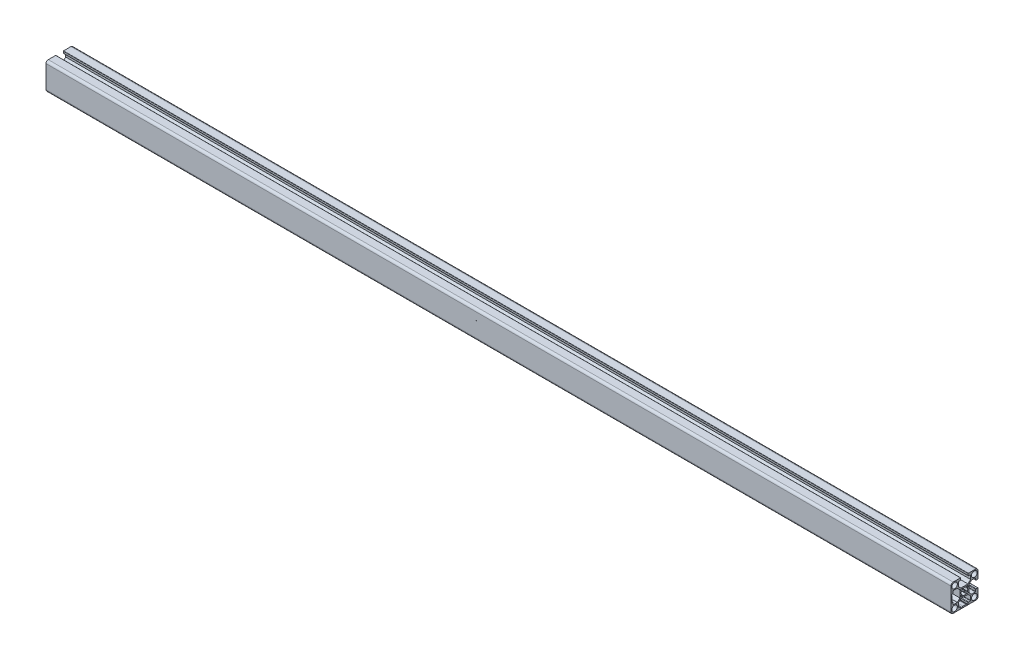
ISO-10303-21;
HEADER;
FILE_DESCRIPTION(('STEP AP214'),'2;1');
FILE_NAME('part.step','',(''),(''),'','','');
FILE_SCHEMA(('AUTOMOTIVE_DESIGN { 1 0 10303 214 1 1 1 1 }'));
ENDSEC;
DATA;
#1=APPLICATION_CONTEXT('core data for automotive mechanical design processes');
#2=APPLICATION_PROTOCOL_DEFINITION('international standard','automotive_design',2000,#1);
#3=PRODUCT_CONTEXT('',#1,'mechanical');
#4=PRODUCT('Part','Part','',(#3));
#5=PRODUCT_RELATED_PRODUCT_CATEGORY('part','',(#4));
#6=PRODUCT_DEFINITION_FORMATION('','',#4);
#7=PRODUCT_DEFINITION_CONTEXT('part definition',#1,'design');
#8=PRODUCT_DEFINITION('design','',#6,#7);
#9=PRODUCT_DEFINITION_SHAPE('','',#8);
#10=(LENGTH_UNIT() NAMED_UNIT(*) SI_UNIT(.MILLI.,.METRE.));
#11=(NAMED_UNIT(*) PLANE_ANGLE_UNIT() SI_UNIT($,.RADIAN.));
#12=(NAMED_UNIT(*) SI_UNIT($,.STERADIAN.) SOLID_ANGLE_UNIT());
#13=UNCERTAINTY_MEASURE_WITH_UNIT(LENGTH_MEASURE(1.E-05),#10,'distance_accuracy_value','');
#14=(GEOMETRIC_REPRESENTATION_CONTEXT(3) GLOBAL_UNCERTAINTY_ASSIGNED_CONTEXT((#13)) GLOBAL_UNIT_ASSIGNED_CONTEXT((#10,
#11,#12)) REPRESENTATION_CONTEXT('',''));
#15=CARTESIAN_POINT('',(0.,0.,0.));
#16=DIRECTION('',(0.,0.,1.));
#17=DIRECTION('',(1.,0.,0.));
#18=AXIS2_PLACEMENT_3D('',#15,#16,#17);
#19=CARTESIAN_POINT('',(1000.,12.9985059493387,4.59999807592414));
#20=DIRECTION('',(-1.,0.,0.));
#21=DIRECTION('',(0.,0.,1.));
#22=AXIS2_PLACEMENT_3D('',#19,#20,#21);
#23=CYLINDRICAL_SURFACE('',#22,0.499999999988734);
#24=CARTESIAN_POINT('',(0.,12.9985059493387,4.59999807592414));
#25=DIRECTION('',(1.,0.,0.));
#26=DIRECTION('',(0.,0.,-1.));
#27=AXIS2_PLACEMENT_3D('',#24,#25,#26);
#28=CIRCLE('',#27,0.499999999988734);
#29=CARTESIAN_POINT('',(0.,12.4985059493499,4.59999807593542));
#30=VERTEX_POINT('',#29);
#31=CARTESIAN_POINT('',(0.,12.9985060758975,4.09999807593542));
#32=VERTEX_POINT('',#31);
#33=EDGE_CURVE('E1113',#30,#32,#28,.T.);
#34=ORIENTED_EDGE('',*,*,#33,.T.);
#35=DIRECTION('',(-1.,0.,0.));
#36=VECTOR('',#35,1.);
#37=CARTESIAN_POINT('',(1000.,12.9985060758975,4.09999807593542));
#38=LINE('',#37,#36);
#39=CARTESIAN_POINT('',(1000.,12.9985060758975,4.09999807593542));
#40=VERTEX_POINT('',#39);
#41=EDGE_CURVE('E13',#40,#32,#38,.T.);
#42=ORIENTED_EDGE('',*,*,#41,.F.);
#43=CARTESIAN_POINT('',(1000.,12.9985059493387,4.59999807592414));
#44=DIRECTION('',(1.,0.,0.));
#45=DIRECTION('',(0.,0.,-1.));
#46=AXIS2_PLACEMENT_3D('',#43,#44,#45);
#47=CIRCLE('',#46,0.499999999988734);
#48=CARTESIAN_POINT('',(1000.,12.4985059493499,4.59999807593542));
#49=VERTEX_POINT('',#48);
#50=EDGE_CURVE('E1677',#49,#40,#47,.T.);
#51=ORIENTED_EDGE('',*,*,#50,.F.);
#52=DIRECTION('',(-1.,0.,0.));
#53=VECTOR('',#52,1.);
#54=CARTESIAN_POINT('',(1000.,12.4985059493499,4.59999807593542));
#55=LINE('',#54,#53);
#56=EDGE_CURVE('E1192',#49,#30,#55,.T.);
#57=ORIENTED_EDGE('',*,*,#56,.T.);
#58=EDGE_LOOP('',(#34,#42,#51,#57));
#59=FACE_BOUND('',#58,.T.);
#60=ADVANCED_FACE('F170',(#59),#23,.T.);
#61=CARTESIAN_POINT('',(1000.,12.9985060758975,4.09999807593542));
#62=DIRECTION('',(0.,0.,1.));
#63=DIRECTION('',(0.,-1.,0.));
#64=AXIS2_PLACEMENT_3D('',#61,#62,#63);
#65=PLANE('',#64);
#66=DIRECTION('',(0.,1.,0.));
#67=VECTOR('',#66,1.);
#68=CARTESIAN_POINT('',(0.,12.9985060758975,4.09999807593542));
#69=LINE('',#68,#67);
#70=CARTESIAN_POINT('',(0.,14.69850602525,4.09999807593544));
#71=VERTEX_POINT('',#70);
#72=EDGE_CURVE('E1116',#32,#71,#69,.T.);
#73=ORIENTED_EDGE('',*,*,#72,.T.);
#74=DIRECTION('',(-1.,0.,0.));
#75=VECTOR('',#74,1.);
#76=CARTESIAN_POINT('',(1000.,14.69850602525,4.09999807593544));
#77=LINE('',#76,#75);
#78=CARTESIAN_POINT('',(1000.,14.69850602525,4.09999807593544));
#79=VERTEX_POINT('',#78);
#80=EDGE_CURVE('E180',#79,#71,#77,.T.);
#81=ORIENTED_EDGE('',*,*,#80,.F.);
#82=DIRECTION('',(0.,1.,0.));
#83=VECTOR('',#82,1.);
#84=CARTESIAN_POINT('',(1000.,12.9985060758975,4.09999807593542));
#85=LINE('',#84,#83);
#86=EDGE_CURVE('E1679',#40,#79,#85,.T.);
#87=ORIENTED_EDGE('',*,*,#86,.F.);
#88=ORIENTED_EDGE('',*,*,#41,.T.);
#89=EDGE_LOOP('',(#73,#81,#87,#88));
#90=FACE_BOUND('',#89,.T.);
#91=ADVANCED_FACE('F1778',(#90),#65,.F.);
#92=CARTESIAN_POINT('',(1000.,14.6985060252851,4.39999807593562));
#93=DIRECTION('',(-1.,0.,0.));
#94=DIRECTION('',(0.,0.,1.));
#95=AXIS2_PLACEMENT_3D('',#92,#93,#94);
#96=CYLINDRICAL_SURFACE('',#95,0.300000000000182);
#97=CARTESIAN_POINT('',(0.,14.6985060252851,4.39999807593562));
#98=DIRECTION('',(1.,0.,0.));
#99=DIRECTION('',(0.,0.,-1.));
#100=AXIS2_PLACEMENT_3D('',#97,#98,#99);
#101=CIRCLE('',#100,0.300000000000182);
#102=CARTESIAN_POINT('',(0.,14.9985060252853,4.39999800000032));
#103=VERTEX_POINT('',#102);
#104=EDGE_CURVE('E1118',#71,#103,#101,.T.);
#105=ORIENTED_EDGE('',*,*,#104,.T.);
#106=DIRECTION('',(-1.,0.,0.));
#107=VECTOR('',#106,1.);
#108=CARTESIAN_POINT('',(1000.,14.9985060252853,4.39999800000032));
#109=LINE('',#108,#107);
#110=CARTESIAN_POINT('',(1000.,14.9985060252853,4.39999800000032));
#111=VERTEX_POINT('',#110);
#112=EDGE_CURVE('E1296',#111,#103,#109,.T.);
#113=ORIENTED_EDGE('',*,*,#112,.F.);
#114=CARTESIAN_POINT('',(1000.,14.6985060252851,4.39999807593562));
#115=DIRECTION('',(1.,0.,0.));
#116=DIRECTION('',(0.,0.,-1.));
#117=AXIS2_PLACEMENT_3D('',#114,#115,#116);
#118=CIRCLE('',#117,0.300000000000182);
#119=EDGE_CURVE('E1681',#79,#111,#118,.T.);
#120=ORIENTED_EDGE('',*,*,#119,.F.);
#121=ORIENTED_EDGE('',*,*,#80,.T.);
#122=EDGE_LOOP('',(#105,#113,#120,#121));
#123=FACE_BOUND('',#122,.T.);
#124=ADVANCED_FACE('F1783',(#123),#96,.T.);
#125=CARTESIAN_POINT('',(1000.,14.9985060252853,4.39999800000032));
#126=DIRECTION('',(0.,-1.,0.));
#127=DIRECTION('',(0.,0.,-1.));
#128=AXIS2_PLACEMENT_3D('',#125,#126,#127);
#129=PLANE('',#128);
#130=DIRECTION('',(0.,0.,1.));
#131=VECTOR('',#130,1.);
#132=CARTESIAN_POINT('',(0.,14.9985060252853,4.39999800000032));
#133=LINE('',#132,#131);
#134=CARTESIAN_POINT('',(0.,14.9985060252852,12.5000000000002));
#135=VERTEX_POINT('',#134);
#136=EDGE_CURVE('E1120',#103,#135,#133,.T.);
#137=ORIENTED_EDGE('',*,*,#136,.T.);
#138=DIRECTION('',(-1.,0.,0.));
#139=VECTOR('',#138,1.);
#140=CARTESIAN_POINT('',(1000.,14.9985060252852,12.5000000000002));
#141=LINE('',#140,#139);
#142=CARTESIAN_POINT('',(1000.,14.9985060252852,12.5000000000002));
#143=VERTEX_POINT('',#142);
#144=EDGE_CURVE('E1293',#143,#135,#141,.T.);
#145=ORIENTED_EDGE('',*,*,#144,.F.);
#146=DIRECTION('',(0.,0.,1.));
#147=VECTOR('',#146,1.);
#148=CARTESIAN_POINT('',(1000.,14.9985060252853,4.39999800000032));
#149=LINE('',#148,#147);
#150=EDGE_CURVE('E1683',#111,#143,#149,.T.);
#151=ORIENTED_EDGE('',*,*,#150,.F.);
#152=ORIENTED_EDGE('',*,*,#112,.T.);
#153=EDGE_LOOP('',(#137,#145,#151,#152));
#154=FACE_BOUND('',#153,.T.);
#155=ADVANCED_FACE('F2565',(#154),#129,.F.);
#156=CARTESIAN_POINT('',(1000.,12.4985060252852,12.5000000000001));
#157=DIRECTION('',(-1.,0.,0.));
#158=DIRECTION('',(0.,0.,1.));
#159=AXIS2_PLACEMENT_3D('',#156,#157,#158);
#160=CYLINDRICAL_SURFACE('',#159,2.5);
#161=CARTESIAN_POINT('',(0.,12.4985060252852,12.5000000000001));
#162=DIRECTION('',(1.,0.,0.));
#163=DIRECTION('',(0.,0.,-1.));
#164=AXIS2_PLACEMENT_3D('',#161,#162,#163);
#165=CIRCLE('',#164,2.5);
#166=CARTESIAN_POINT('',(0.,12.4985060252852,15.0000000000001));
#167=VERTEX_POINT('',#166);
#168=EDGE_CURVE('E1122',#135,#167,#165,.T.);
#169=ORIENTED_EDGE('',*,*,#168,.T.);
#170=DIRECTION('',(-1.,0.,0.));
#171=VECTOR('',#170,1.);
#172=CARTESIAN_POINT('',(1000.,12.4985060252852,15.0000000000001));
#173=LINE('',#172,#171);
#174=CARTESIAN_POINT('',(1000.,12.4985060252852,15.0000000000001));
#175=VERTEX_POINT('',#174);
#176=EDGE_CURVE('E1290',#175,#167,#173,.T.);
#177=ORIENTED_EDGE('',*,*,#176,.F.);
#178=CARTESIAN_POINT('',(1000.,12.4985060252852,12.5000000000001));
#179=DIRECTION('',(1.,0.,0.));
#180=DIRECTION('',(0.,0.,-1.));
#181=AXIS2_PLACEMENT_3D('',#178,#179,#180);
#182=CIRCLE('',#181,2.5);
#183=EDGE_CURVE('E1685',#143,#175,#182,.T.);
#184=ORIENTED_EDGE('',*,*,#183,.F.);
#185=ORIENTED_EDGE('',*,*,#144,.T.);
#186=EDGE_LOOP('',(#169,#177,#184,#185));
#187=FACE_BOUND('',#186,.T.);
#188=ADVANCED_FACE('F2573',(#187),#160,.T.);
#189=CARTESIAN_POINT('',(1000.,12.4985060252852,15.0000000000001));
#190=DIRECTION('',(0.,0.,-1.));
#191=DIRECTION('',(0.,1.,0.));
#192=AXIS2_PLACEMENT_3D('',#189,#190,#191);
#193=PLANE('',#192);
#194=DIRECTION('',(0.,-1.,0.));
#195=VECTOR('',#194,1.);
#196=CARTESIAN_POINT('',(0.,12.4985060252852,15.0000000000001));
#197=LINE('',#196,#195);
#198=CARTESIAN_POINT('',(0.,-12.5014939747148,14.9999999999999));
#199=VERTEX_POINT('',#198);
#200=EDGE_CURVE('E1124',#167,#199,#197,.T.);
#201=ORIENTED_EDGE('',*,*,#200,.T.);
#202=DIRECTION('',(-1.,0.,0.));
#203=VECTOR('',#202,1.);
#204=CARTESIAN_POINT('',(1000.,-12.5014939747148,14.9999999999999));
#205=LINE('',#204,#203);
#206=CARTESIAN_POINT('',(1000.,-12.5014939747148,14.9999999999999));
#207=VERTEX_POINT('',#206);
#208=EDGE_CURVE('E1287',#207,#199,#205,.T.);
#209=ORIENTED_EDGE('',*,*,#208,.F.);
#210=DIRECTION('',(0.,-1.,0.));
#211=VECTOR('',#210,1.);
#212=CARTESIAN_POINT('',(1000.,12.4985060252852,15.0000000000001));
#213=LINE('',#212,#211);
#214=EDGE_CURVE('E1687',#175,#207,#213,.T.);
#215=ORIENTED_EDGE('',*,*,#214,.F.);
#216=ORIENTED_EDGE('',*,*,#176,.T.);
#217=EDGE_LOOP('',(#201,#209,#215,#216));
#218=FACE_BOUND('',#217,.T.);
#219=ADVANCED_FACE('F2582',(#218),#193,.F.);
#220=CARTESIAN_POINT('',(1000.,-12.5000000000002,12.500000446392));
#221=DIRECTION('',(-1.,0.,0.));
#222=DIRECTION('',(0.,0.,1.));
#223=AXIS2_PLACEMENT_3D('',#220,#221,#222);
#224=CYLINDRICAL_SURFACE('',#223,2.50000000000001);
#225=CARTESIAN_POINT('',(0.,-12.5000000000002,12.500000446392));
#226=DIRECTION('',(1.,0.,0.));
#227=DIRECTION('',(0.,0.,-1.));
#228=AXIS2_PLACEMENT_3D('',#225,#226,#227);
#229=CIRCLE('',#228,2.50000000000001);
#230=CARTESIAN_POINT('',(0.,-15.0000000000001,12.4999999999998));
#231=VERTEX_POINT('',#230);
#232=EDGE_CURVE('E1126',#199,#231,#229,.T.);
#233=ORIENTED_EDGE('',*,*,#232,.T.);
#234=DIRECTION('',(-1.,0.,0.));
#235=VECTOR('',#234,1.);
#236=CARTESIAN_POINT('',(1000.,-15.0000000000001,12.4999999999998));
#237=LINE('',#236,#235);
#238=CARTESIAN_POINT('',(1000.,-15.0000000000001,12.4999999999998));
#239=VERTEX_POINT('',#238);
#240=EDGE_CURVE('E1284',#239,#231,#237,.T.);
#241=ORIENTED_EDGE('',*,*,#240,.F.);
#242=CARTESIAN_POINT('',(1000.,-12.5000000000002,12.500000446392));
#243=DIRECTION('',(1.,0.,0.));
#244=DIRECTION('',(0.,0.,-1.));
#245=AXIS2_PLACEMENT_3D('',#242,#243,#244);
#246=CIRCLE('',#245,2.50000000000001);
#247=EDGE_CURVE('E1689',#207,#239,#246,.T.);
#248=ORIENTED_EDGE('',*,*,#247,.F.);
#249=ORIENTED_EDGE('',*,*,#208,.T.);
#250=EDGE_LOOP('',(#233,#241,#248,#249));
#251=FACE_BOUND('',#250,.T.);
#252=ADVANCED_FACE('F2591',(#251),#224,.T.);
#253=CARTESIAN_POINT('',(1000.,-15.0000000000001,12.4999999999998));
#254=DIRECTION('',(0.,1.,0.));
#255=DIRECTION('',(0.,0.,1.));
#256=AXIS2_PLACEMENT_3D('',#253,#254,#255);
#257=PLANE('',#256);
#258=DIRECTION('',(0.,0.,-1.));
#259=VECTOR('',#258,1.);
#260=CARTESIAN_POINT('',(0.,-15.0000000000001,12.4999999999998));
#261=LINE('',#260,#259);
#262=CARTESIAN_POINT('',(0.,-14.9999999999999,-12.5000000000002));
#263=VERTEX_POINT('',#262);
#264=EDGE_CURVE('E1128',#231,#263,#261,.T.);
#265=ORIENTED_EDGE('',*,*,#264,.T.);
#266=DIRECTION('',(-1.,0.,0.));
#267=VECTOR('',#266,1.);
#268=CARTESIAN_POINT('',(1000.,-14.9999999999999,-12.5000000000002));
#269=LINE('',#268,#267);
#270=CARTESIAN_POINT('',(1000.,-14.9999999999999,-12.5000000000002));
#271=VERTEX_POINT('',#270);
#272=EDGE_CURVE('E1281',#271,#263,#269,.T.);
#273=ORIENTED_EDGE('',*,*,#272,.F.);
#274=DIRECTION('',(0.,0.,-1.));
#275=VECTOR('',#274,1.);
#276=CARTESIAN_POINT('',(1000.,-15.0000000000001,12.4999999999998));
#277=LINE('',#276,#275);
#278=EDGE_CURVE('E1691',#239,#271,#277,.T.);
#279=ORIENTED_EDGE('',*,*,#278,.F.);
#280=ORIENTED_EDGE('',*,*,#240,.T.);
#281=EDGE_LOOP('',(#265,#273,#279,#280));
#282=FACE_BOUND('',#281,.T.);
#283=ADVANCED_FACE('F2600',(#282),#257,.F.);
#284=CARTESIAN_POINT('',(1000.,-12.4999999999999,-12.5000004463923));
#285=DIRECTION('',(-1.,0.,0.));
#286=DIRECTION('',(0.,0.,1.));
#287=AXIS2_PLACEMENT_3D('',#284,#285,#286);
#288=CYLINDRICAL_SURFACE('',#287,2.5);
#289=CARTESIAN_POINT('',(0.,-12.4999999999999,-12.5000004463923));
#290=DIRECTION('',(1.,0.,0.));
#291=DIRECTION('',(0.,0.,-1.));
#292=AXIS2_PLACEMENT_3D('',#289,#290,#291);
#293=CIRCLE('',#292,2.5);
#294=CARTESIAN_POINT('',(0.,-12.5014939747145,-15.0000000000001));
#295=VERTEX_POINT('',#294);
#296=EDGE_CURVE('E1130',#263,#295,#293,.T.);
#297=ORIENTED_EDGE('',*,*,#296,.T.);
#298=DIRECTION('',(-1.,0.,0.));
#299=VECTOR('',#298,1.);
#300=CARTESIAN_POINT('',(1000.,-12.5014939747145,-15.0000000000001));
#301=LINE('',#300,#299);
#302=CARTESIAN_POINT('',(1000.,-12.5014939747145,-15.0000000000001));
#303=VERTEX_POINT('',#302);
#304=EDGE_CURVE('E1278',#303,#295,#301,.T.);
#305=ORIENTED_EDGE('',*,*,#304,.F.);
#306=CARTESIAN_POINT('',(1000.,-12.4999999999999,-12.5000004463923));
#307=DIRECTION('',(1.,0.,0.));
#308=DIRECTION('',(0.,0.,-1.));
#309=AXIS2_PLACEMENT_3D('',#306,#307,#308);
#310=CIRCLE('',#309,2.5);
#311=EDGE_CURVE('E1693',#271,#303,#310,.T.);
#312=ORIENTED_EDGE('',*,*,#311,.F.);
#313=ORIENTED_EDGE('',*,*,#272,.T.);
#314=EDGE_LOOP('',(#297,#305,#312,#313));
#315=FACE_BOUND('',#314,.T.);
#316=ADVANCED_FACE('F2609',(#315),#288,.T.);
#317=CARTESIAN_POINT('',(1000.,-12.5014939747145,-15.0000000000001));
#318=DIRECTION('',(0.,0.,1.));
#319=DIRECTION('',(0.,-1.,0.));
#320=AXIS2_PLACEMENT_3D('',#317,#318,#319);
#321=PLANE('',#320);
#322=DIRECTION('',(0.,1.,0.));
#323=VECTOR('',#322,1.);
#324=CARTESIAN_POINT('',(0.,-12.5014939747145,-15.0000000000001));
#325=LINE('',#324,#323);
#326=CARTESIAN_POINT('',(0.,-4.40149297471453,-15.));
#327=VERTEX_POINT('',#326);
#328=EDGE_CURVE('E1132',#295,#327,#325,.T.);
#329=ORIENTED_EDGE('',*,*,#328,.T.);
#330=DIRECTION('',(-1.,0.,0.));
#331=VECTOR('',#330,1.);
#332=CARTESIAN_POINT('',(1000.,-4.40149297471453,-15.));
#333=LINE('',#332,#331);
#334=CARTESIAN_POINT('',(1000.,-4.40149297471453,-15.));
#335=VERTEX_POINT('',#334);
#336=EDGE_CURVE('E1275',#335,#327,#333,.T.);
#337=ORIENTED_EDGE('',*,*,#336,.F.);
#338=DIRECTION('',(0.,1.,0.));
#339=VECTOR('',#338,1.);
#340=CARTESIAN_POINT('',(1000.,-12.5014939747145,-15.0000000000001));
#341=LINE('',#340,#339);
#342=EDGE_CURVE('E1695',#303,#335,#341,.T.);
#343=ORIENTED_EDGE('',*,*,#342,.F.);
#344=ORIENTED_EDGE('',*,*,#304,.T.);
#345=EDGE_LOOP('',(#329,#337,#343,#344));
#346=FACE_BOUND('',#345,.T.);
#347=ADVANCED_FACE('F2618',(#346),#321,.F.);
#348=CARTESIAN_POINT('',(1000.,-4.40149297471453,-14.7000000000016));
#349=DIRECTION('',(-1.,0.,0.));
#350=DIRECTION('',(0.,0.,1.));
#351=AXIS2_PLACEMENT_3D('',#348,#349,#350);
#352=CYLINDRICAL_SURFACE('',#351,0.299999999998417);
#353=CARTESIAN_POINT('',(0.,-4.40149297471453,-14.7000000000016));
#354=DIRECTION('',(1.,0.,0.));
#355=DIRECTION('',(0.,0.,-1.));
#356=AXIS2_PLACEMENT_3D('',#353,#354,#355);
#357=CIRCLE('',#356,0.299999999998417);
#358=CARTESIAN_POINT('',(0.,-4.10149297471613,-14.7000000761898));
#359=VERTEX_POINT('',#358);
#360=EDGE_CURVE('E1134',#327,#359,#357,.T.);
#361=ORIENTED_EDGE('',*,*,#360,.T.);
#362=DIRECTION('',(-1.,0.,0.));
#363=VECTOR('',#362,1.);
#364=CARTESIAN_POINT('',(1000.,-4.10149297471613,-14.7000000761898));
#365=LINE('',#364,#363);
#366=CARTESIAN_POINT('',(1000.,-4.10149297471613,-14.7000000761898));
#367=VERTEX_POINT('',#366);
#368=EDGE_CURVE('E1272',#367,#359,#365,.T.);
#369=ORIENTED_EDGE('',*,*,#368,.F.);
#370=CARTESIAN_POINT('',(1000.,-4.40149297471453,-14.7000000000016));
#371=DIRECTION('',(1.,0.,0.));
#372=DIRECTION('',(0.,0.,-1.));
#373=AXIS2_PLACEMENT_3D('',#370,#371,#372);
#374=CIRCLE('',#373,0.299999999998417);
#375=EDGE_CURVE('E1697',#335,#367,#374,.T.);
#376=ORIENTED_EDGE('',*,*,#375,.F.);
#377=ORIENTED_EDGE('',*,*,#336,.T.);
#378=EDGE_LOOP('',(#361,#369,#376,#377));
#379=FACE_BOUND('',#378,.T.);
#380=ADVANCED_FACE('F2627',(#379),#352,.T.);
#381=CARTESIAN_POINT('',(1000.,-4.10149297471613,-14.7000000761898));
#382=DIRECTION('',(0.,-1.,0.));
#383=DIRECTION('',(0.,0.,-1.));
#384=AXIS2_PLACEMENT_3D('',#381,#382,#383);
#385=PLANE('',#384);
#386=DIRECTION('',(0.,0.,1.));
#387=VECTOR('',#386,1.);
#388=CARTESIAN_POINT('',(0.,-4.10149297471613,-14.7000000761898));
#389=LINE('',#388,#387);
#390=CARTESIAN_POINT('',(0.,-4.10149297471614,-12.9993429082));
#391=VERTEX_POINT('',#390);
#392=EDGE_CURVE('E1136',#359,#391,#389,.T.);
#393=ORIENTED_EDGE('',*,*,#392,.T.);
#394=DIRECTION('',(-1.,0.,0.));
#395=VECTOR('',#394,1.);
#396=CARTESIAN_POINT('',(1000.,-4.10149297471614,-12.9993429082));
#397=LINE('',#396,#395);
#398=CARTESIAN_POINT('',(1000.,-4.10149297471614,-12.9993429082));
#399=VERTEX_POINT('',#398);
#400=EDGE_CURVE('E1269',#399,#391,#397,.T.);
#401=ORIENTED_EDGE('',*,*,#400,.F.);
#402=DIRECTION('',(0.,0.,1.));
#403=VECTOR('',#402,1.);
#404=CARTESIAN_POINT('',(1000.,-4.10149297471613,-14.7000000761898));
#405=LINE('',#404,#403);
#406=EDGE_CURVE('E1699',#367,#399,#405,.T.);
#407=ORIENTED_EDGE('',*,*,#406,.F.);
#408=ORIENTED_EDGE('',*,*,#368,.T.);
#409=EDGE_LOOP('',(#393,#401,#407,#408));
#410=FACE_BOUND('',#409,.T.);
#411=ADVANCED_FACE('F2636',(#410),#385,.F.);
#412=CARTESIAN_POINT('',(1000.,-4.60149297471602,-12.9993429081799));
#413=DIRECTION('',(-1.,0.,0.));
#414=DIRECTION('',(0.,0.,1.));
#415=AXIS2_PLACEMENT_3D('',#412,#413,#414);
#416=CYLINDRICAL_SURFACE('',#415,0.499999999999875);
#417=CARTESIAN_POINT('',(0.,-4.60149297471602,-12.9993429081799));
#418=DIRECTION('',(1.,0.,0.));
#419=DIRECTION('',(0.,0.,-1.));
#420=AXIS2_PLACEMENT_3D('',#417,#418,#419);
#421=CIRCLE('',#420,0.499999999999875);
#422=CARTESIAN_POINT('',(0.,-4.60149368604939,-12.4993429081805));
#423=VERTEX_POINT('',#422);
#424=EDGE_CURVE('E1138',#391,#423,#421,.T.);
#425=ORIENTED_EDGE('',*,*,#424,.T.);
#426=DIRECTION('',(-1.,0.,0.));
#427=VECTOR('',#426,1.);
#428=CARTESIAN_POINT('',(1000.,-4.60149368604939,-12.4993429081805));
#429=LINE('',#428,#427);
#430=CARTESIAN_POINT('',(1000.,-4.60149368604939,-12.4993429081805));
#431=VERTEX_POINT('',#430);
#432=EDGE_CURVE('E1266',#431,#423,#429,.T.);
#433=ORIENTED_EDGE('',*,*,#432,.F.);
#434=CARTESIAN_POINT('',(1000.,-4.60149297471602,-12.9993429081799));
#435=DIRECTION('',(1.,0.,0.));
#436=DIRECTION('',(0.,0.,-1.));
#437=AXIS2_PLACEMENT_3D('',#434,#435,#436);
#438=CIRCLE('',#437,0.499999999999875);
#439=EDGE_CURVE('E1701',#399,#431,#438,.T.);
#440=ORIENTED_EDGE('',*,*,#439,.F.);
#441=ORIENTED_EDGE('',*,*,#400,.T.);
#442=EDGE_LOOP('',(#425,#433,#440,#441));
#443=FACE_BOUND('',#442,.T.);
#444=ADVANCED_FACE('F2645',(#443),#416,.T.);
#445=CARTESIAN_POINT('',(1000.,-4.60149368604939,-12.4993429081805));
#446=DIRECTION('',(0.,0.,-1.));
#447=DIRECTION('',(0.,1.,0.));
#448=AXIS2_PLACEMENT_3D('',#445,#446,#447);
#449=PLANE('',#448);
#450=DIRECTION('',(0.,-1.,0.));
#451=VECTOR('',#450,1.);
#452=CARTESIAN_POINT('',(0.,-4.60149368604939,-12.4993429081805));
#453=LINE('',#452,#451);
#454=CARTESIAN_POINT('',(0.,-6.50000318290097,-12.4993429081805));
#455=VERTEX_POINT('',#454);
#456=EDGE_CURVE('E1140',#423,#455,#453,.T.);
#457=ORIENTED_EDGE('',*,*,#456,.T.);
#458=DIRECTION('',(-1.,0.,0.));
#459=VECTOR('',#458,1.);
#460=CARTESIAN_POINT('',(1000.,-6.50000318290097,-12.4993429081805));
#461=LINE('',#460,#459);
#462=CARTESIAN_POINT('',(1000.,-6.50000318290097,-12.4993429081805));
#463=VERTEX_POINT('',#462);
#464=EDGE_CURVE('E1263',#463,#455,#461,.T.);
#465=ORIENTED_EDGE('',*,*,#464,.F.);
#466=DIRECTION('',(0.,-1.,0.));
#467=VECTOR('',#466,1.);
#468=CARTESIAN_POINT('',(1000.,-4.60149368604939,-12.4993429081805));
#469=LINE('',#468,#467);
#470=EDGE_CURVE('E1703',#431,#463,#469,.T.);
#471=ORIENTED_EDGE('',*,*,#470,.F.);
#472=ORIENTED_EDGE('',*,*,#432,.T.);
#473=EDGE_LOOP('',(#457,#465,#471,#472));
#474=FACE_BOUND('',#473,.T.);
#475=ADVANCED_FACE('F2654',(#474),#449,.F.);
#476=CARTESIAN_POINT('',(1000.,-6.50000318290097,-12.1993462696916));
#477=DIRECTION('',(-1.,0.,0.));
#478=DIRECTION('',(0.,0.,1.));
#479=AXIS2_PLACEMENT_3D('',#476,#477,#478);
#480=CYLINDRICAL_SURFACE('',#479,0.299996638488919);
#481=CARTESIAN_POINT('',(0.,-6.50000318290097,-12.1993462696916));
#482=DIRECTION('',(-1.,0.,0.));
#483=DIRECTION('',(0.,0.,-1.));
#484=AXIS2_PLACEMENT_3D('',#481,#482,#483);
#485=CIRCLE('',#484,0.299996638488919);
#486=CARTESIAN_POINT('',(0.,-6.79999982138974,-12.1993459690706));
#487=VERTEX_POINT('',#486);
#488=EDGE_CURVE('E1142',#455,#487,#485,.T.);
#489=ORIENTED_EDGE('',*,*,#488,.T.);
#490=DIRECTION('',(-1.,0.,0.));
#491=VECTOR('',#490,1.);
#492=CARTESIAN_POINT('',(1000.,-6.79999982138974,-12.1993459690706));
#493=LINE('',#492,#491);
#494=CARTESIAN_POINT('',(1000.,-6.79999982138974,-12.1993459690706));
#495=VERTEX_POINT('',#494);
#496=EDGE_CURVE('E1260',#495,#487,#493,.T.);
#497=ORIENTED_EDGE('',*,*,#496,.F.);
#498=CARTESIAN_POINT('',(1000.,-6.50000318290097,-12.1993462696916));
#499=DIRECTION('',(-1.,0.,0.));
#500=DIRECTION('',(0.,0.,-1.));
#501=AXIS2_PLACEMENT_3D('',#498,#499,#500);
#502=CIRCLE('',#501,0.299996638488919);
#503=EDGE_CURVE('E1705',#463,#495,#502,.T.);
#504=ORIENTED_EDGE('',*,*,#503,.F.);
#505=ORIENTED_EDGE('',*,*,#464,.T.);
#506=EDGE_LOOP('',(#489,#497,#504,#505));
#507=FACE_BOUND('',#506,.T.);
#508=ADVANCED_FACE('F2663',(#507),#480,.F.);
#509=CARTESIAN_POINT('',(1000.,-6.79999982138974,-12.1993459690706));
#510=DIRECTION('',(0.,-1.,0.));
#511=DIRECTION('',(0.,0.,-1.));
#512=AXIS2_PLACEMENT_3D('',#509,#510,#511);
#513=PLANE('',#512);
#514=DIRECTION('',(0.,0.,1.));
#515=VECTOR('',#514,1.);
#516=CARTESIAN_POINT('',(0.,-6.79999982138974,-12.1993459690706));
#517=LINE('',#516,#515);
#518=CARTESIAN_POINT('',(0.,-6.79999982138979,-7.85999791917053));
#519=VERTEX_POINT('',#518);
#520=EDGE_CURVE('E1144',#487,#519,#517,.T.);
#521=ORIENTED_EDGE('',*,*,#520,.T.);
#522=DIRECTION('',(-1.,0.,0.));
#523=VECTOR('',#522,1.);
#524=CARTESIAN_POINT('',(1000.,-6.79999982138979,-7.85999791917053));
#525=LINE('',#524,#523);
#526=CARTESIAN_POINT('',(1000.,-6.79999982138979,-7.85999791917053));
#527=VERTEX_POINT('',#526);
#528=EDGE_CURVE('E1257',#527,#519,#525,.T.);
#529=ORIENTED_EDGE('',*,*,#528,.F.);
#530=DIRECTION('',(0.,0.,1.));
#531=VECTOR('',#530,1.);
#532=CARTESIAN_POINT('',(1000.,-6.79999982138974,-12.1993459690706));
#533=LINE('',#532,#531);
#534=EDGE_CURVE('E1707',#495,#527,#533,.T.);
#535=ORIENTED_EDGE('',*,*,#534,.F.);
#536=ORIENTED_EDGE('',*,*,#496,.T.);
#537=EDGE_LOOP('',(#521,#529,#535,#536));
#538=FACE_BOUND('',#537,.T.);
#539=ADVANCED_FACE('F2672',(#538),#513,.F.);
#540=CARTESIAN_POINT('',(1000.,-6.79999982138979,-7.85999791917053));
#541=DIRECTION('',(0.,-0.707106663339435,0.707106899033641));
#542=DIRECTION('',(0.,-0.707106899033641,-0.707106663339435));
#543=AXIS2_PLACEMENT_3D('',#540,#541,#542);
#544=PLANE('',#543);
#545=DIRECTION('',(0.,0.707106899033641,0.707106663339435));
#546=VECTOR('',#545,1.);
#547=CARTESIAN_POINT('',(0.,-6.79999982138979,-7.85999791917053));
#548=LINE('',#547,#546);
#549=CARTESIAN_POINT('',(0.,-3.93999934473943,-4.99999839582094));
#550=VERTEX_POINT('',#549);
#551=EDGE_CURVE('E1146',#519,#550,#548,.T.);
#552=ORIENTED_EDGE('',*,*,#551,.T.);
#553=DIRECTION('',(-1.,0.,0.));
#554=VECTOR('',#553,1.);
#555=CARTESIAN_POINT('',(1000.,-3.93999934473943,-4.99999839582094));
#556=LINE('',#555,#554);
#557=CARTESIAN_POINT('',(1000.,-3.93999934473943,-4.99999839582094));
#558=VERTEX_POINT('',#557);
#559=EDGE_CURVE('E1254',#558,#550,#556,.T.);
#560=ORIENTED_EDGE('',*,*,#559,.F.);
#561=DIRECTION('',(0.,0.707106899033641,0.707106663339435));
#562=VECTOR('',#561,1.);
#563=CARTESIAN_POINT('',(1000.,-6.79999982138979,-7.85999791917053));
#564=LINE('',#563,#562);
#565=EDGE_CURVE('E1709',#527,#558,#564,.T.);
#566=ORIENTED_EDGE('',*,*,#565,.F.);
#567=ORIENTED_EDGE('',*,*,#528,.T.);
#568=EDGE_LOOP('',(#552,#560,#566,#567));
#569=FACE_BOUND('',#568,.T.);
#570=ADVANCED_FACE('F2681',(#569),#544,.F.);
#571=CARTESIAN_POINT('',(1000.,-3.93999934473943,-4.99999839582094));
#572=DIRECTION('',(0.,0.,1.));
#573=DIRECTION('',(0.,-1.,0.));
#574=AXIS2_PLACEMENT_3D('',#571,#572,#573);
#575=PLANE('',#574);
#576=DIRECTION('',(0.,1.,0.));
#577=VECTOR('',#576,1.);
#578=CARTESIAN_POINT('',(0.,-3.93999934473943,-4.99999839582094));
#579=LINE('',#578,#577);
#580=CARTESIAN_POINT('',(0.,3.94000065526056,-4.99999839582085));
#581=VERTEX_POINT('',#580);
#582=EDGE_CURVE('E1148',#550,#581,#579,.T.);
#583=ORIENTED_EDGE('',*,*,#582,.T.);
#584=DIRECTION('',(-1.,0.,0.));
#585=VECTOR('',#584,1.);
#586=CARTESIAN_POINT('',(1000.,3.94000065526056,-4.99999839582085));
#587=LINE('',#586,#585);
#588=CARTESIAN_POINT('',(1000.,3.94000065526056,-4.99999839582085));
#589=VERTEX_POINT('',#588);
#590=EDGE_CURVE('E1251',#589,#581,#587,.T.);
#591=ORIENTED_EDGE('',*,*,#590,.F.);
#592=DIRECTION('',(0.,1.,0.));
#593=VECTOR('',#592,1.);
#594=CARTESIAN_POINT('',(1000.,-3.93999934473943,-4.99999839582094));
#595=LINE('',#594,#593);
#596=EDGE_CURVE('E1711',#558,#589,#595,.T.);
#597=ORIENTED_EDGE('',*,*,#596,.F.);
#598=ORIENTED_EDGE('',*,*,#559,.T.);
#599=EDGE_LOOP('',(#583,#591,#597,#598));
#600=FACE_BOUND('',#599,.T.);
#601=ADVANCED_FACE('F2690',(#600),#575,.F.);
#602=CARTESIAN_POINT('',(1000.,3.94000065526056,-4.99999839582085));
#603=DIRECTION('',(0.,0.70710678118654,0.707106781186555));
#604=DIRECTION('',(0.,-0.707106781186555,0.70710678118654));
#605=AXIS2_PLACEMENT_3D('',#602,#603,#604);
#606=PLANE('',#605);
#607=DIRECTION('',(0.,0.707106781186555,-0.70710678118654));
#608=VECTOR('',#607,1.);
#609=CARTESIAN_POINT('',(0.,3.94000065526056,-4.99999839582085));
#610=LINE('',#609,#608);
#611=CARTESIAN_POINT('',(0.,6.8000006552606,-7.85999839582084));
#612=VERTEX_POINT('',#611);
#613=EDGE_CURVE('E1150',#581,#612,#610,.T.);
#614=ORIENTED_EDGE('',*,*,#613,.T.);
#615=DIRECTION('',(-1.,0.,0.));
#616=VECTOR('',#615,1.);
#617=CARTESIAN_POINT('',(1000.,6.8000006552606,-7.85999839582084));
#618=LINE('',#617,#616);
#619=CARTESIAN_POINT('',(1000.,6.8000006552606,-7.85999839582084));
#620=VERTEX_POINT('',#619);
#621=EDGE_CURVE('E1248',#620,#612,#618,.T.);
#622=ORIENTED_EDGE('',*,*,#621,.F.);
#623=DIRECTION('',(0.,0.707106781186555,-0.70710678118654));
#624=VECTOR('',#623,1.);
#625=CARTESIAN_POINT('',(1000.,3.94000065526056,-4.99999839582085));
#626=LINE('',#625,#624);
#627=EDGE_CURVE('E1713',#589,#620,#626,.T.);
#628=ORIENTED_EDGE('',*,*,#627,.F.);
#629=ORIENTED_EDGE('',*,*,#590,.T.);
#630=EDGE_LOOP('',(#614,#622,#628,#629));
#631=FACE_BOUND('',#630,.T.);
#632=ADVANCED_FACE('F2699',(#631),#606,.F.);
#633=CARTESIAN_POINT('',(1000.,6.8000006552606,-7.85999839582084));
#634=DIRECTION('',(0.,1.,0.));
#635=DIRECTION('',(0.,0.,1.));
#636=AXIS2_PLACEMENT_3D('',#633,#634,#635);
#637=PLANE('',#636);
#638=DIRECTION('',(0.,0.,-1.));
#639=VECTOR('',#638,1.);
#640=CARTESIAN_POINT('',(0.,6.8000006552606,-7.85999839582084));
#641=LINE('',#640,#639);
#642=CARTESIAN_POINT('',(0.,6.80000065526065,-12.2000051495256));
#643=VERTEX_POINT('',#642);
#644=EDGE_CURVE('E1152',#612,#643,#641,.T.);
#645=ORIENTED_EDGE('',*,*,#644,.T.);
#646=DIRECTION('',(-1.,0.,0.));
#647=VECTOR('',#646,1.);
#648=CARTESIAN_POINT('',(1000.,6.80000065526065,-12.2000051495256));
#649=LINE('',#648,#647);
#650=CARTESIAN_POINT('',(1000.,6.80000065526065,-12.2000051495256));
#651=VERTEX_POINT('',#650);
#652=EDGE_CURVE('E1245',#651,#643,#649,.T.);
#653=ORIENTED_EDGE('',*,*,#652,.F.);
#654=DIRECTION('',(0.,0.,-1.));
#655=VECTOR('',#654,1.);
#656=CARTESIAN_POINT('',(1000.,6.8000006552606,-7.85999839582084));
#657=LINE('',#656,#655);
#658=EDGE_CURVE('E1715',#620,#651,#657,.T.);
#659=ORIENTED_EDGE('',*,*,#658,.F.);
#660=ORIENTED_EDGE('',*,*,#621,.T.);
#661=EDGE_LOOP('',(#645,#653,#659,#660));
#662=FACE_BOUND('',#661,.T.);
#663=ADVANCED_FACE('F2708',(#662),#637,.F.);
#664=CARTESIAN_POINT('',(1000.,6.50000439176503,-12.2000051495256));
#665=DIRECTION('',(-1.,0.,0.));
#666=DIRECTION('',(0.,0.,1.));
#667=AXIS2_PLACEMENT_3D('',#664,#665,#666);
#668=CYLINDRICAL_SURFACE('',#667,0.299996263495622);
#669=CARTESIAN_POINT('',(0.,6.50000439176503,-12.2000051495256));
#670=DIRECTION('',(-1.,0.,0.));
#671=DIRECTION('',(0.,0.,-1.));
#672=AXIS2_PLACEMENT_3D('',#669,#670,#671);
#673=CIRCLE('',#672,0.299996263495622);
#674=CARTESIAN_POINT('',(0.,6.50000391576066,-12.5000014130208));
#675=VERTEX_POINT('',#674);
#676=EDGE_CURVE('E1154',#643,#675,#673,.T.);
#677=ORIENTED_EDGE('',*,*,#676,.T.);
#678=DIRECTION('',(-1.,0.,0.));
#679=VECTOR('',#678,1.);
#680=CARTESIAN_POINT('',(1000.,6.50000391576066,-12.5000014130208));
#681=LINE('',#680,#679);
#682=CARTESIAN_POINT('',(1000.,6.50000391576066,-12.5000014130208));
#683=VERTEX_POINT('',#682);
#684=EDGE_CURVE('E1242',#683,#675,#681,.T.);
#685=ORIENTED_EDGE('',*,*,#684,.F.);
#686=CARTESIAN_POINT('',(1000.,6.50000439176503,-12.2000051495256));
#687=DIRECTION('',(-1.,0.,0.));
#688=DIRECTION('',(0.,0.,-1.));
#689=AXIS2_PLACEMENT_3D('',#686,#687,#688);
#690=CIRCLE('',#689,0.299996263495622);
#691=EDGE_CURVE('E1717',#651,#683,#690,.T.);
#692=ORIENTED_EDGE('',*,*,#691,.F.);
#693=ORIENTED_EDGE('',*,*,#652,.T.);
#694=EDGE_LOOP('',(#677,#685,#692,#693));
#695=FACE_BOUND('',#694,.T.);
#696=ADVANCED_FACE('F2717',(#695),#668,.F.);
#697=CARTESIAN_POINT('',(1000.,6.50000391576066,-12.5000014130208));
#698=DIRECTION('',(0.,0.,-1.));
#699=DIRECTION('',(0.,1.,0.));
#700=AXIS2_PLACEMENT_3D('',#697,#698,#699);
#701=PLANE('',#700);
#702=DIRECTION('',(0.,-1.,0.));
#703=VECTOR('',#702,1.);
#704=CARTESIAN_POINT('',(0.,6.50000391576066,-12.5000014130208));
#705=LINE('',#704,#703);
#706=CARTESIAN_POINT('',(0.,4.59850765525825,-12.5000014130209));
#707=VERTEX_POINT('',#706);
#708=EDGE_CURVE('E1156',#675,#707,#705,.T.);
#709=ORIENTED_EDGE('',*,*,#708,.T.);
#710=DIRECTION('',(-1.,0.,0.));
#711=VECTOR('',#710,1.);
#712=CARTESIAN_POINT('',(1000.,4.59850765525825,-12.5000014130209));
#713=LINE('',#712,#711);
#714=CARTESIAN_POINT('',(1000.,4.59850765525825,-12.5000014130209));
#715=VERTEX_POINT('',#714);
#716=EDGE_CURVE('E1239',#715,#707,#713,.T.);
#717=ORIENTED_EDGE('',*,*,#716,.F.);
#718=DIRECTION('',(0.,-1.,0.));
#719=VECTOR('',#718,1.);
#720=CARTESIAN_POINT('',(1000.,6.50000391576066,-12.5000014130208));
#721=LINE('',#720,#719);
#722=EDGE_CURVE('E1719',#683,#715,#721,.T.);
#723=ORIENTED_EDGE('',*,*,#722,.F.);
#724=ORIENTED_EDGE('',*,*,#684,.T.);
#725=EDGE_LOOP('',(#709,#717,#723,#724));
#726=FACE_BOUND('',#725,.T.);
#727=ADVANCED_FACE('F2726',(#726),#701,.F.);
#728=CARTESIAN_POINT('',(1000.,4.59850708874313,-13.0000014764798));
#729=DIRECTION('',(-1.,0.,0.));
#730=DIRECTION('',(0.,0.,1.));
#731=AXIS2_PLACEMENT_3D('',#728,#729,#730);
#732=CYLINDRICAL_SURFACE('',#731,0.50000006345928);
#733=CARTESIAN_POINT('',(0.,4.59850708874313,-13.0000014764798));
#734=DIRECTION('',(1.,0.,0.));
#735=DIRECTION('',(0.,0.,-1.));
#736=AXIS2_PLACEMENT_3D('',#733,#734,#735);
#737=CIRCLE('',#736,0.50000006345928);
#738=CARTESIAN_POINT('',(0.,4.09850702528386,-13.0000013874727));
#739=VERTEX_POINT('',#738);
#740=EDGE_CURVE('E1158',#707,#739,#737,.T.);
#741=ORIENTED_EDGE('',*,*,#740,.T.);
#742=DIRECTION('',(-1.,0.,0.));
#743=VECTOR('',#742,1.);
#744=CARTESIAN_POINT('',(1000.,4.09850702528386,-13.0000013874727));
#745=LINE('',#744,#743);
#746=CARTESIAN_POINT('',(1000.,4.09850702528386,-13.0000013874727));
#747=VERTEX_POINT('',#746);
#748=EDGE_CURVE('E1236',#747,#739,#745,.T.);
#749=ORIENTED_EDGE('',*,*,#748,.F.);
#750=CARTESIAN_POINT('',(1000.,4.59850708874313,-13.0000014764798));
#751=DIRECTION('',(1.,0.,0.));
#752=DIRECTION('',(0.,0.,-1.));
#753=AXIS2_PLACEMENT_3D('',#750,#751,#752);
#754=CIRCLE('',#753,0.50000006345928);
#755=EDGE_CURVE('E1721',#715,#747,#754,.T.);
#756=ORIENTED_EDGE('',*,*,#755,.F.);
#757=ORIENTED_EDGE('',*,*,#716,.T.);
#758=EDGE_LOOP('',(#741,#749,#756,#757));
#759=FACE_BOUND('',#758,.T.);
#760=ADVANCED_FACE('F2735',(#759),#732,.T.);
#761=CARTESIAN_POINT('',(1000.,4.09850702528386,-13.0000013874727));
#762=DIRECTION('',(0.,1.,0.));
#763=DIRECTION('',(0.,0.,1.));
#764=AXIS2_PLACEMENT_3D('',#761,#762,#763);
#765=PLANE('',#764);
#766=DIRECTION('',(0.,0.,-1.));
#767=VECTOR('',#766,1.);
#768=CARTESIAN_POINT('',(0.,4.09850702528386,-13.0000013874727));
#769=LINE('',#768,#767);
#770=CARTESIAN_POINT('',(0.,4.09850702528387,-14.7000021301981));
#771=VERTEX_POINT('',#770);
#772=EDGE_CURVE('E1160',#739,#771,#769,.T.);
#773=ORIENTED_EDGE('',*,*,#772,.T.);
#774=DIRECTION('',(-1.,0.,0.));
#775=VECTOR('',#774,1.);
#776=CARTESIAN_POINT('',(1000.,4.09850702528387,-14.7000021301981));
#777=LINE('',#776,#775);
#778=CARTESIAN_POINT('',(1000.,4.09850702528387,-14.7000021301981));
#779=VERTEX_POINT('',#778);
#780=EDGE_CURVE('E1233',#779,#771,#777,.T.);
#781=ORIENTED_EDGE('',*,*,#780,.F.);
#782=DIRECTION('',(0.,0.,-1.));
#783=VECTOR('',#782,1.);
#784=CARTESIAN_POINT('',(1000.,4.09850702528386,-13.0000013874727));
#785=LINE('',#784,#783);
#786=EDGE_CURVE('E1723',#747,#779,#785,.T.);
#787=ORIENTED_EDGE('',*,*,#786,.F.);
#788=ORIENTED_EDGE('',*,*,#748,.T.);
#789=EDGE_LOOP('',(#773,#781,#787,#788));
#790=FACE_BOUND('',#789,.T.);
#791=ADVANCED_FACE('F2744',(#790),#765,.F.);
#792=CARTESIAN_POINT('',(1000.,4.39850702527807,-14.7000037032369));
#793=DIRECTION('',(-1.,0.,0.));
#794=DIRECTION('',(0.,0.,1.));
#795=AXIS2_PLACEMENT_3D('',#792,#793,#794);
#796=CYLINDRICAL_SURFACE('',#795,0.299999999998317);
#797=CARTESIAN_POINT('',(0.,4.39850702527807,-14.7000037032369));
#798=DIRECTION('',(1.,0.,0.));
#799=DIRECTION('',(0.,0.,-1.));
#800=AXIS2_PLACEMENT_3D('',#797,#798,#799);
#801=CIRCLE('',#800,0.299999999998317);
#802=CARTESIAN_POINT('',(0.,4.39999763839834,-15.));
#803=VERTEX_POINT('',#802);
#804=EDGE_CURVE('E1162',#771,#803,#801,.T.);
#805=ORIENTED_EDGE('',*,*,#804,.T.);
#806=DIRECTION('',(-1.,0.,0.));
#807=VECTOR('',#806,1.);
#808=CARTESIAN_POINT('',(1000.,4.39999763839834,-15.));
#809=LINE('',#808,#807);
#810=CARTESIAN_POINT('',(1000.,4.39999763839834,-15.));
#811=VERTEX_POINT('',#810);
#812=EDGE_CURVE('E1230',#811,#803,#809,.T.);
#813=ORIENTED_EDGE('',*,*,#812,.F.);
#814=CARTESIAN_POINT('',(1000.,4.39850702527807,-14.7000037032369));
#815=DIRECTION('',(1.,0.,0.));
#816=DIRECTION('',(0.,0.,-1.));
#817=AXIS2_PLACEMENT_3D('',#814,#815,#816);
#818=CIRCLE('',#817,0.299999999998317);
#819=EDGE_CURVE('E1725',#779,#811,#818,.T.);
#820=ORIENTED_EDGE('',*,*,#819,.F.);
#821=ORIENTED_EDGE('',*,*,#780,.T.);
#822=EDGE_LOOP('',(#805,#813,#820,#821));
#823=FACE_BOUND('',#822,.T.);
#824=ADVANCED_FACE('F2753',(#823),#796,.T.);
#825=CARTESIAN_POINT('',(1000.,4.39999763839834,-15.));
#826=DIRECTION('',(0.,0.,1.));
#827=DIRECTION('',(0.,-1.,0.));
#828=AXIS2_PLACEMENT_3D('',#825,#826,#827);
#829=PLANE('',#828);
#830=DIRECTION('',(0.,1.,0.));
#831=VECTOR('',#830,1.);
#832=CARTESIAN_POINT('',(0.,4.39999763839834,-15.));
#833=LINE('',#832,#831);
#834=CARTESIAN_POINT('',(0.,12.5000000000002,-14.9999999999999));
#835=VERTEX_POINT('',#834);
#836=EDGE_CURVE('E1164',#803,#835,#833,.T.);
#837=ORIENTED_EDGE('',*,*,#836,.T.);
#838=DIRECTION('',(-1.,0.,0.));
#839=VECTOR('',#838,1.);
#840=CARTESIAN_POINT('',(1000.,12.5000000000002,-14.9999999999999));
#841=LINE('',#840,#839);
#842=CARTESIAN_POINT('',(1000.,12.5000000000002,-14.9999999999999));
#843=VERTEX_POINT('',#842);
#844=EDGE_CURVE('E1227',#843,#835,#841,.T.);
#845=ORIENTED_EDGE('',*,*,#844,.F.);
#846=DIRECTION('',(0.,1.,0.));
#847=VECTOR('',#846,1.);
#848=CARTESIAN_POINT('',(1000.,4.39999763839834,-15.));
#849=LINE('',#848,#847);
#850=EDGE_CURVE('E1727',#811,#843,#849,.T.);
#851=ORIENTED_EDGE('',*,*,#850,.F.);
#852=ORIENTED_EDGE('',*,*,#812,.T.);
#853=EDGE_LOOP('',(#837,#845,#851,#852));
#854=FACE_BOUND('',#853,.T.);
#855=ADVANCED_FACE('F2762',(#854),#829,.F.);
#856=CARTESIAN_POINT('',(1000.,12.5000000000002,-12.4999999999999));
#857=DIRECTION('',(-1.,0.,0.));
#858=DIRECTION('',(0.,0.,1.));
#859=AXIS2_PLACEMENT_3D('',#856,#857,#858);
#860=CYLINDRICAL_SURFACE('',#859,2.49999999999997);
#861=CARTESIAN_POINT('',(0.,12.5000000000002,-12.4999999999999));
#862=DIRECTION('',(1.,0.,0.));
#863=DIRECTION('',(0.,0.,-1.));
#864=AXIS2_PLACEMENT_3D('',#861,#862,#863);
#865=CIRCLE('',#864,2.49999999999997);
#866=CARTESIAN_POINT('',(0.,15.0000000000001,-12.4999999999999));
#867=VERTEX_POINT('',#866);
#868=EDGE_CURVE('E1166',#835,#867,#865,.T.);
#869=ORIENTED_EDGE('',*,*,#868,.T.);
#870=DIRECTION('',(-1.,0.,0.));
#871=VECTOR('',#870,1.);
#872=CARTESIAN_POINT('',(1000.,15.0000000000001,-12.4999999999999));
#873=LINE('',#872,#871);
#874=CARTESIAN_POINT('',(1000.,15.0000000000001,-12.4999999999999));
#875=VERTEX_POINT('',#874);
#876=EDGE_CURVE('E1224',#875,#867,#873,.T.);
#877=ORIENTED_EDGE('',*,*,#876,.F.);
#878=CARTESIAN_POINT('',(1000.,12.5000000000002,-12.4999999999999));
#879=DIRECTION('',(1.,0.,0.));
#880=DIRECTION('',(0.,0.,-1.));
#881=AXIS2_PLACEMENT_3D('',#878,#879,#880);
#882=CIRCLE('',#881,2.49999999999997);
#883=EDGE_CURVE('E1729',#843,#875,#882,.T.);
#884=ORIENTED_EDGE('',*,*,#883,.F.);
#885=ORIENTED_EDGE('',*,*,#844,.T.);
#886=EDGE_LOOP('',(#869,#877,#884,#885));
#887=FACE_BOUND('',#886,.T.);
#888=ADVANCED_FACE('F2771',(#887),#860,.T.);
#889=CARTESIAN_POINT('',(1000.,15.0000000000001,-12.4999999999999));
#890=DIRECTION('',(0.,-1.,0.));
#891=DIRECTION('',(0.,0.,-1.));
#892=AXIS2_PLACEMENT_3D('',#889,#890,#891);
#893=PLANE('',#892);
#894=DIRECTION('',(0.,0.,1.));
#895=VECTOR('',#894,1.);
#896=CARTESIAN_POINT('',(0.,15.0000000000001,-12.4999999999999));
#897=LINE('',#896,#895);
#898=CARTESIAN_POINT('',(0.,15.0000000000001,-4.40000199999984));
#899=VERTEX_POINT('',#898);
#900=EDGE_CURVE('E1168',#867,#899,#897,.T.);
#901=ORIENTED_EDGE('',*,*,#900,.T.);
#902=DIRECTION('',(-1.,0.,0.));
#903=VECTOR('',#902,1.);
#904=CARTESIAN_POINT('',(1000.,15.0000000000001,-4.40000199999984));
#905=LINE('',#904,#903);
#906=CARTESIAN_POINT('',(1000.,15.0000000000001,-4.40000199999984));
#907=VERTEX_POINT('',#906);
#908=EDGE_CURVE('E1221',#907,#899,#905,.T.);
#909=ORIENTED_EDGE('',*,*,#908,.F.);
#910=DIRECTION('',(0.,0.,1.));
#911=VECTOR('',#910,1.);
#912=CARTESIAN_POINT('',(1000.,15.0000000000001,-12.4999999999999));
#913=LINE('',#912,#911);
#914=EDGE_CURVE('E1731',#875,#907,#913,.T.);
#915=ORIENTED_EDGE('',*,*,#914,.F.);
#916=ORIENTED_EDGE('',*,*,#876,.T.);
#917=EDGE_LOOP('',(#901,#909,#915,#916));
#918=FACE_BOUND('',#917,.T.);
#919=ADVANCED_FACE('F2780',(#918),#893,.F.);
#920=CARTESIAN_POINT('',(1000.,14.7000000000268,-4.40000192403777));
#921=DIRECTION('',(-1.,0.,0.));
#922=DIRECTION('',(0.,0.,1.));
#923=AXIS2_PLACEMENT_3D('',#920,#921,#922);
#924=CYLINDRICAL_SURFACE('',#923,0.299999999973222);
#925=CARTESIAN_POINT('',(0.,14.7000000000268,-4.40000192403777));
#926=DIRECTION('',(1.,0.,0.));
#927=DIRECTION('',(0.,0.,-1.));
#928=AXIS2_PLACEMENT_3D('',#925,#926,#927);
#929=CIRCLE('',#928,0.299999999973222);
#930=CARTESIAN_POINT('',(0.,14.7000000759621,-4.10000192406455));
#931=VERTEX_POINT('',#930);
#932=EDGE_CURVE('E1170',#899,#931,#929,.T.);
#933=ORIENTED_EDGE('',*,*,#932,.T.);
#934=DIRECTION('',(-1.,0.,0.));
#935=VECTOR('',#934,1.);
#936=CARTESIAN_POINT('',(1000.,14.7000000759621,-4.10000192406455));
#937=LINE('',#936,#935);
#938=CARTESIAN_POINT('',(1000.,14.7000000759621,-4.10000192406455));
#939=VERTEX_POINT('',#938);
#940=EDGE_CURVE('E1218',#939,#931,#937,.T.);
#941=ORIENTED_EDGE('',*,*,#940,.F.);
#942=CARTESIAN_POINT('',(1000.,14.7000000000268,-4.40000192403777));
#943=DIRECTION('',(1.,0.,0.));
#944=DIRECTION('',(0.,0.,-1.));
#945=AXIS2_PLACEMENT_3D('',#942,#943,#944);
#946=CIRCLE('',#945,0.299999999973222);
#947=EDGE_CURVE('E1733',#907,#939,#946,.T.);
#948=ORIENTED_EDGE('',*,*,#947,.F.);
#949=ORIENTED_EDGE('',*,*,#908,.T.);
#950=EDGE_LOOP('',(#933,#941,#948,#949));
#951=FACE_BOUND('',#950,.T.);
#952=ADVANCED_FACE('F2789',(#951),#924,.T.);
#953=CARTESIAN_POINT('',(1000.,14.7000000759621,-4.10000192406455));
#954=DIRECTION('',(0.,0.,-1.));
#955=DIRECTION('',(0.,1.,0.));
#956=AXIS2_PLACEMENT_3D('',#953,#954,#955);
#957=PLANE('',#956);
#958=DIRECTION('',(0.,-1.,0.));
#959=VECTOR('',#958,1.);
#960=CARTESIAN_POINT('',(0.,14.7000000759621,-4.10000192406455));
#961=LINE('',#960,#959);
#962=CARTESIAN_POINT('',(0.,13.0000001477,-4.10000192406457));
#963=VERTEX_POINT('',#962);
#964=EDGE_CURVE('E1172',#931,#963,#961,.T.);
#965=ORIENTED_EDGE('',*,*,#964,.T.);
#966=DIRECTION('',(-1.,0.,0.));
#967=VECTOR('',#966,1.);
#968=CARTESIAN_POINT('',(1000.,13.0000001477,-4.10000192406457));
#969=LINE('',#968,#967);
#970=CARTESIAN_POINT('',(1000.,13.0000001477,-4.10000192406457));
#971=VERTEX_POINT('',#970);
#972=EDGE_CURVE('E1215',#971,#963,#969,.T.);
#973=ORIENTED_EDGE('',*,*,#972,.F.);
#974=DIRECTION('',(0.,-1.,0.));
#975=VECTOR('',#974,1.);
#976=CARTESIAN_POINT('',(1000.,14.7000000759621,-4.10000192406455));
#977=LINE('',#976,#975);
#978=EDGE_CURVE('E1735',#939,#971,#977,.T.);
#979=ORIENTED_EDGE('',*,*,#978,.F.);
#980=ORIENTED_EDGE('',*,*,#940,.T.);
#981=EDGE_LOOP('',(#965,#973,#979,#980));
#982=FACE_BOUND('',#981,.T.);
#983=ADVANCED_FACE('F2798',(#982),#957,.F.);
#984=CARTESIAN_POINT('',(1000.,13.0000001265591,-4.60000192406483));
#985=DIRECTION('',(-1.,0.,0.));
#986=DIRECTION('',(0.,0.,1.));
#987=AXIS2_PLACEMENT_3D('',#984,#985,#986);
#988=CYLINDRICAL_SURFACE('',#987,0.500000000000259);
#989=CARTESIAN_POINT('',(0.,13.0000001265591,-4.60000192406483));
#990=DIRECTION('',(1.,0.,0.));
#991=DIRECTION('',(0.,0.,-1.));
#992=AXIS2_PLACEMENT_3D('',#989,#990,#991);
#993=CIRCLE('',#992,0.500000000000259);
#994=CARTESIAN_POINT('',(0.,12.5000001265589,-4.60000205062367));
#995=VERTEX_POINT('',#994);
#996=EDGE_CURVE('E1174',#963,#995,#993,.T.);
#997=ORIENTED_EDGE('',*,*,#996,.T.);
#998=DIRECTION('',(-1.,0.,0.));
#999=VECTOR('',#998,1.);
#1000=CARTESIAN_POINT('',(1000.,12.5000001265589,-4.60000205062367));
#1001=LINE('',#1000,#999);
#1002=CARTESIAN_POINT('',(1000.,12.5000001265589,-4.60000205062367));
#1003=VERTEX_POINT('',#1002);
#1004=EDGE_CURVE('E1212',#1003,#995,#1001,.T.);
#1005=ORIENTED_EDGE('',*,*,#1004,.F.);
#1006=CARTESIAN_POINT('',(1000.,13.0000001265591,-4.60000192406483));
#1007=DIRECTION('',(1.,0.,0.));
#1008=DIRECTION('',(0.,0.,-1.));
#1009=AXIS2_PLACEMENT_3D('',#1006,#1007,#1008);
#1010=CIRCLE('',#1009,0.500000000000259);
#1011=EDGE_CURVE('E1737',#971,#1003,#1010,.T.);
#1012=ORIENTED_EDGE('',*,*,#1011,.F.);
#1013=ORIENTED_EDGE('',*,*,#972,.T.);
#1014=EDGE_LOOP('',(#997,#1005,#1012,#1013));
#1015=FACE_BOUND('',#1014,.T.);
#1016=ADVANCED_FACE('F2807',(#1015),#988,.T.);
#1017=CARTESIAN_POINT('',(1000.,12.5000001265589,-4.60000205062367));
#1018=DIRECTION('',(0.,1.,0.));
#1019=DIRECTION('',(0.,0.,1.));
#1020=AXIS2_PLACEMENT_3D('',#1017,#1018,#1019);
#1021=PLANE('',#1020);
#1022=DIRECTION('',(0.,0.,-1.));
#1023=VECTOR('',#1022,1.);
#1024=CARTESIAN_POINT('',(0.,12.5000001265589,-4.60000205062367));
#1025=LINE('',#1024,#1023);
#1026=CARTESIAN_POINT('',(0.,12.5000001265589,-6.50000617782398));
#1027=VERTEX_POINT('',#1026);
#1028=EDGE_CURVE('E1176',#995,#1027,#1025,.T.);
#1029=ORIENTED_EDGE('',*,*,#1028,.T.);
#1030=DIRECTION('',(-1.,0.,0.));
#1031=VECTOR('',#1030,1.);
#1032=CARTESIAN_POINT('',(1000.,12.5000001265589,-6.50000617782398));
#1033=LINE('',#1032,#1031);
#1034=CARTESIAN_POINT('',(1000.,12.5000001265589,-6.50000617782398));
#1035=VERTEX_POINT('',#1034);
#1036=EDGE_CURVE('E1209',#1035,#1027,#1033,.T.);
#1037=ORIENTED_EDGE('',*,*,#1036,.F.);
#1038=DIRECTION('',(0.,0.,-1.));
#1039=VECTOR('',#1038,1.);
#1040=CARTESIAN_POINT('',(1000.,12.5000001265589,-4.60000205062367));
#1041=LINE('',#1040,#1039);
#1042=EDGE_CURVE('E1739',#1003,#1035,#1041,.T.);
#1043=ORIENTED_EDGE('',*,*,#1042,.F.);
#1044=ORIENTED_EDGE('',*,*,#1004,.T.);
#1045=EDGE_LOOP('',(#1029,#1037,#1043,#1044));
#1046=FACE_BOUND('',#1045,.T.);
#1047=ADVANCED_FACE('F2816',(#1046),#1021,.F.);
#1048=CARTESIAN_POINT('',(1000.,12.2000031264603,-6.50000691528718));
#1049=DIRECTION('',(-1.,0.,0.));
#1050=DIRECTION('',(0.,0.,1.));
#1051=AXIS2_PLACEMENT_3D('',#1048,#1049,#1050);
#1052=CYLINDRICAL_SURFACE('',#1051,0.299997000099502);
#1053=CARTESIAN_POINT('',(0.,12.2000031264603,-6.50000691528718));
#1054=DIRECTION('',(-1.,0.,0.));
#1055=DIRECTION('',(0.,0.,-1.));
#1056=AXIS2_PLACEMENT_3D('',#1053,#1054,#1055);
#1057=CIRCLE('',#1056,0.299997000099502);
#1058=CARTESIAN_POINT('',(0.,12.1985084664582,-6.80000019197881));
#1059=VERTEX_POINT('',#1058);
#1060=EDGE_CURVE('E1178',#1027,#1059,#1057,.T.);
#1061=ORIENTED_EDGE('',*,*,#1060,.T.);
#1062=DIRECTION('',(-1.,0.,0.));
#1063=VECTOR('',#1062,1.);
#1064=CARTESIAN_POINT('',(1000.,12.1985084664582,-6.80000019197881));
#1065=LINE('',#1064,#1063);
#1066=CARTESIAN_POINT('',(1000.,12.1985084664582,-6.80000019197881));
#1067=VERTEX_POINT('',#1066);
#1068=EDGE_CURVE('E1206',#1067,#1059,#1065,.T.);
#1069=ORIENTED_EDGE('',*,*,#1068,.F.);
#1070=CARTESIAN_POINT('',(1000.,12.2000031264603,-6.50000691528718));
#1071=DIRECTION('',(-1.,0.,0.));
#1072=DIRECTION('',(0.,0.,-1.));
#1073=AXIS2_PLACEMENT_3D('',#1070,#1071,#1072);
#1074=CIRCLE('',#1073,0.299997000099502);
#1075=EDGE_CURVE('E1741',#1035,#1067,#1074,.T.);
#1076=ORIENTED_EDGE('',*,*,#1075,.F.);
#1077=ORIENTED_EDGE('',*,*,#1036,.T.);
#1078=EDGE_LOOP('',(#1061,#1069,#1076,#1077));
#1079=FACE_BOUND('',#1078,.T.);
#1080=ADVANCED_FACE('F2825',(#1079),#1052,.F.);
#1081=CARTESIAN_POINT('',(1000.,12.1985084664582,-6.80000019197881));
#1082=DIRECTION('',(0.,0.,-1.));
#1083=DIRECTION('',(0.,1.,0.));
#1084=AXIS2_PLACEMENT_3D('',#1081,#1082,#1083);
#1085=PLANE('',#1084);
#1086=DIRECTION('',(0.,-1.,0.));
#1087=VECTOR('',#1086,1.);
#1088=CARTESIAN_POINT('',(0.,12.1985084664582,-6.80000019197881));
#1089=LINE('',#1088,#1087);
#1090=CARTESIAN_POINT('',(0.,7.85850551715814,-6.80000019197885));
#1091=VERTEX_POINT('',#1090);
#1092=EDGE_CURVE('E1180',#1059,#1091,#1089,.T.);
#1093=ORIENTED_EDGE('',*,*,#1092,.T.);
#1094=DIRECTION('',(-1.,0.,0.));
#1095=VECTOR('',#1094,1.);
#1096=CARTESIAN_POINT('',(1000.,7.85850551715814,-6.80000019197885));
#1097=LINE('',#1096,#1095);
#1098=CARTESIAN_POINT('',(1000.,7.85850551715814,-6.80000019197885));
#1099=VERTEX_POINT('',#1098);
#1100=EDGE_CURVE('E1203',#1099,#1091,#1097,.T.);
#1101=ORIENTED_EDGE('',*,*,#1100,.F.);
#1102=DIRECTION('',(0.,-1.,0.));
#1103=VECTOR('',#1102,1.);
#1104=CARTESIAN_POINT('',(1000.,12.1985084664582,-6.80000019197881));
#1105=LINE('',#1104,#1103);
#1106=EDGE_CURVE('E1743',#1067,#1099,#1105,.T.);
#1107=ORIENTED_EDGE('',*,*,#1106,.F.);
#1108=ORIENTED_EDGE('',*,*,#1068,.T.);
#1109=EDGE_LOOP('',(#1093,#1101,#1107,#1108));
#1110=FACE_BOUND('',#1109,.T.);
#1111=ADVANCED_FACE('F2834',(#1110),#1085,.F.);
#1112=CARTESIAN_POINT('',(1000.,7.85850551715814,-6.80000019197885));
#1113=DIRECTION('',(0.,-0.70710678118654,-0.707106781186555));
#1114=DIRECTION('',(0.,0.707106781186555,-0.70710678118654));
#1115=AXIS2_PLACEMENT_3D('',#1112,#1113,#1114);
#1116=PLANE('',#1115);
#1117=DIRECTION('',(0.,-0.707106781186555,0.70710678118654));
#1118=VECTOR('',#1117,1.);
#1119=CARTESIAN_POINT('',(0.,7.85850551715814,-6.80000019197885));
#1120=LINE('',#1119,#1118);
#1121=CARTESIAN_POINT('',(0.,4.9985055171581,-3.94000019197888));
#1122=VERTEX_POINT('',#1121);
#1123=EDGE_CURVE('E1182',#1091,#1122,#1120,.T.);
#1124=ORIENTED_EDGE('',*,*,#1123,.T.);
#1125=DIRECTION('',(-1.,0.,0.));
#1126=VECTOR('',#1125,1.);
#1127=CARTESIAN_POINT('',(1000.,4.9985055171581,-3.94000019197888));
#1128=LINE('',#1127,#1126);
#1129=CARTESIAN_POINT('',(1000.,4.9985055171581,-3.94000019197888));
#1130=VERTEX_POINT('',#1129);
#1131=EDGE_CURVE('E1200',#1130,#1122,#1128,.T.);
#1132=ORIENTED_EDGE('',*,*,#1131,.F.);
#1133=DIRECTION('',(0.,-0.707106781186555,0.70710678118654));
#1134=VECTOR('',#1133,1.);
#1135=CARTESIAN_POINT('',(1000.,7.85850551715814,-6.80000019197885));
#1136=LINE('',#1135,#1134);
#1137=EDGE_CURVE('E1745',#1099,#1130,#1136,.T.);
#1138=ORIENTED_EDGE('',*,*,#1137,.F.);
#1139=ORIENTED_EDGE('',*,*,#1100,.T.);
#1140=EDGE_LOOP('',(#1124,#1132,#1138,#1139));
#1141=FACE_BOUND('',#1140,.T.);
#1142=ADVANCED_FACE('F2843',(#1141),#1116,.F.);
#1143=CARTESIAN_POINT('',(1000.,4.9985055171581,-3.94000019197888));
#1144=DIRECTION('',(0.,-1.,0.));
#1145=DIRECTION('',(0.,0.,-1.));
#1146=AXIS2_PLACEMENT_3D('',#1143,#1144,#1145);
#1147=PLANE('',#1146);
#1148=DIRECTION('',(0.,0.,1.));
#1149=VECTOR('',#1148,1.);
#1150=CARTESIAN_POINT('',(0.,4.9985055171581,-3.94000019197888));
#1151=LINE('',#1150,#1149);
#1152=CARTESIAN_POINT('',(0.,4.99850551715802,3.93999980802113));
#1153=VERTEX_POINT('',#1152);
#1154=EDGE_CURVE('E1184',#1122,#1153,#1151,.T.);
#1155=ORIENTED_EDGE('',*,*,#1154,.T.);
#1156=DIRECTION('',(-1.,0.,0.));
#1157=VECTOR('',#1156,1.);
#1158=CARTESIAN_POINT('',(1000.,4.99850551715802,3.93999980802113));
#1159=LINE('',#1158,#1157);
#1160=CARTESIAN_POINT('',(1000.,4.99850551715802,3.93999980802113));
#1161=VERTEX_POINT('',#1160);
#1162=EDGE_CURVE('E1197',#1161,#1153,#1159,.T.);
#1163=ORIENTED_EDGE('',*,*,#1162,.F.);
#1164=DIRECTION('',(0.,0.,1.));
#1165=VECTOR('',#1164,1.);
#1166=CARTESIAN_POINT('',(1000.,4.9985055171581,-3.94000019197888));
#1167=LINE('',#1166,#1165);
#1168=EDGE_CURVE('E1747',#1130,#1161,#1167,.T.);
#1169=ORIENTED_EDGE('',*,*,#1168,.F.);
#1170=ORIENTED_EDGE('',*,*,#1131,.T.);
#1171=EDGE_LOOP('',(#1155,#1163,#1169,#1170));
#1172=FACE_BOUND('',#1171,.T.);
#1173=ADVANCED_FACE('F1753',(#1172),#1147,.F.);
#1174=CARTESIAN_POINT('',(1000.,4.99850551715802,3.93999980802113));
#1175=DIRECTION('',(0.,-0.707106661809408,0.707106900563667));
#1176=DIRECTION('',(0.,-0.707106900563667,-0.707106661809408));
#1177=AXIS2_PLACEMENT_3D('',#1174,#1175,#1176);
#1178=PLANE('',#1177);
#1179=DIRECTION('',(0.,0.707106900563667,0.707106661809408));
#1180=VECTOR('',#1179,1.);
#1181=CARTESIAN_POINT('',(0.,4.99850551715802,3.93999980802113));
#1182=LINE('',#1181,#1180);
#1183=CARTESIAN_POINT('',(0.,7.85850599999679,6.7999993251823));
#1184=VERTEX_POINT('',#1183);
#1185=EDGE_CURVE('E1186',#1153,#1184,#1182,.T.);
#1186=ORIENTED_EDGE('',*,*,#1185,.T.);
#1187=DIRECTION('',(-1.,0.,0.));
#1188=VECTOR('',#1187,1.);
#1189=CARTESIAN_POINT('',(1000.,7.85850599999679,6.7999993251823));
#1190=LINE('',#1189,#1188);
#1191=CARTESIAN_POINT('',(1000.,7.85850599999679,6.7999993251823));
#1192=VERTEX_POINT('',#1191);
#1193=EDGE_CURVE('E879',#1192,#1184,#1190,.T.);
#1194=ORIENTED_EDGE('',*,*,#1193,.F.);
#1195=DIRECTION('',(0.,0.707106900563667,0.707106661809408));
#1196=VECTOR('',#1195,1.);
#1197=CARTESIAN_POINT('',(1000.,4.99850551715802,3.93999980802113));
#1198=LINE('',#1197,#1196);
#1199=EDGE_CURVE('E870',#1161,#1192,#1198,.T.);
#1200=ORIENTED_EDGE('',*,*,#1199,.F.);
#1201=ORIENTED_EDGE('',*,*,#1162,.T.);
#1202=EDGE_LOOP('',(#1186,#1194,#1200,#1201));
#1203=FACE_BOUND('',#1202,.T.);
#1204=ADVANCED_FACE('F1757',(#1203),#1178,.F.);
#1205=CARTESIAN_POINT('',(1000.,7.85850599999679,6.7999993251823));
#1206=DIRECTION('',(0.,0.,1.));
#1207=DIRECTION('',(0.,-1.,0.));
#1208=AXIS2_PLACEMENT_3D('',#1205,#1206,#1207);
#1209=PLANE('',#1208);
#1210=DIRECTION('',(0.,1.,0.));
#1211=VECTOR('',#1210,1.);
#1212=CARTESIAN_POINT('',(0.,7.85850599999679,6.7999993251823));
#1213=LINE('',#1212,#1211);
#1214=CARTESIAN_POINT('',(0.,12.1985089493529,6.79999932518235));
#1215=VERTEX_POINT('',#1214);
#1216=EDGE_CURVE('E878',#1184,#1215,#1213,.T.);
#1217=ORIENTED_EDGE('',*,*,#1216,.T.);
#1218=DIRECTION('',(-1.,0.,0.));
#1219=VECTOR('',#1218,1.);
#1220=CARTESIAN_POINT('',(1000.,12.1985089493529,6.79999932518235));
#1221=LINE('',#1220,#1219);
#1222=CARTESIAN_POINT('',(1000.,12.1985089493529,6.79999932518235));
#1223=VERTEX_POINT('',#1222);
#1224=EDGE_CURVE('E875',#1223,#1215,#1221,.T.);
#1225=ORIENTED_EDGE('',*,*,#1224,.F.);
#1226=DIRECTION('',(0.,1.,0.));
#1227=VECTOR('',#1226,1.);
#1228=CARTESIAN_POINT('',(1000.,7.85850599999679,6.7999993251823));
#1229=LINE('',#1228,#1227);
#1230=EDGE_CURVE('E864',#1192,#1223,#1229,.T.);
#1231=ORIENTED_EDGE('',*,*,#1230,.F.);
#1232=ORIENTED_EDGE('',*,*,#1193,.T.);
#1233=EDGE_LOOP('',(#1217,#1225,#1231,#1232));
#1234=FACE_BOUND('',#1233,.T.);
#1235=ADVANCED_FACE('F876',(#1234),#1209,.F.);
#1236=CARTESIAN_POINT('',(1000.,12.1985089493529,6.5000023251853));
#1237=DIRECTION('',(-1.,0.,0.));
#1238=DIRECTION('',(0.,0.,1.));
#1239=AXIS2_PLACEMENT_3D('',#1236,#1237,#1238);
#1240=CYLINDRICAL_SURFACE('',#1239,0.299996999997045);
#1241=CARTESIAN_POINT('',(0.,12.1985089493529,6.5000023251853));
#1242=DIRECTION('',(-1.,0.,0.));
#1243=DIRECTION('',(0.,0.,-1.));
#1244=AXIS2_PLACEMENT_3D('',#1241,#1242,#1243);
#1245=CIRCLE('',#1244,0.299996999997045);
#1246=CARTESIAN_POINT('',(0.,12.4985059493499,6.50000227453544));
#1247=VERTEX_POINT('',#1246);
#1248=EDGE_CURVE('E527',#1215,#1247,#1245,.T.);
#1249=ORIENTED_EDGE('',*,*,#1248,.T.);
#1250=DIRECTION('',(-1.,0.,0.));
#1251=VECTOR('',#1250,1.);
#1252=CARTESIAN_POINT('',(1000.,12.4985059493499,6.50000227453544));
#1253=LINE('',#1252,#1251);
#1254=CARTESIAN_POINT('',(1000.,12.4985059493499,6.50000227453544));
#1255=VERTEX_POINT('',#1254);
#1256=EDGE_CURVE('E880',#1255,#1247,#1253,.T.);
#1257=ORIENTED_EDGE('',*,*,#1256,.F.);
#1258=CARTESIAN_POINT('',(1000.,12.1985089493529,6.5000023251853));
#1259=DIRECTION('',(-1.,0.,0.));
#1260=DIRECTION('',(0.,0.,-1.));
#1261=AXIS2_PLACEMENT_3D('',#1258,#1259,#1260);
#1262=CIRCLE('',#1261,0.299996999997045);
#1263=EDGE_CURVE('E868',#1223,#1255,#1262,.T.);
#1264=ORIENTED_EDGE('',*,*,#1263,.F.);
#1265=ORIENTED_EDGE('',*,*,#1224,.T.);
#1266=EDGE_LOOP('',(#1249,#1257,#1264,#1265));
#1267=FACE_BOUND('',#1266,.T.);
#1268=ADVANCED_FACE('F882',(#1267),#1240,.F.);
#1269=CARTESIAN_POINT('',(1000.,-3.37569532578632,3.37424285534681));
#1270=DIRECTION('',(-1.,0.,0.));
#1271=DIRECTION('',(0.,0.,1.));
#1272=AXIS2_PLACEMENT_3D('',#1269,#1270,#1271);
#1273=CYLINDRICAL_SURFACE('',#1272,0.500000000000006);
#1274=CARTESIAN_POINT('',(0.,-3.37569532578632,3.37424285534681));
#1275=DIRECTION('',(1.,0.,0.));
#1276=DIRECTION('',(0.,0.,-1.));
#1277=AXIS2_PLACEMENT_3D('',#1274,#1275,#1276);
#1278=CIRCLE('',#1277,0.500000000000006);
#1279=CARTESIAN_POINT('',(0.,-3.27855689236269,3.86471622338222));
#1280=VERTEX_POINT('',#1279);
#1281=CARTESIAN_POINT('',(0.,-3.86476912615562,3.27028700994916));
#1282=VERTEX_POINT('',#1281);
#1283=EDGE_CURVE('E1017',#1280,#1282,#1278,.T.);
#1284=ORIENTED_EDGE('',*,*,#1283,.F.);
#1285=DIRECTION('',(-1.,0.,0.));
#1286=VECTOR('',#1285,1.);
#1287=CARTESIAN_POINT('',(1000.,-3.27855689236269,3.86471622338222));
#1288=LINE('',#1287,#1286);
#1289=CARTESIAN_POINT('',(1000.,-3.27855689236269,3.86471622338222));
#1290=VERTEX_POINT('',#1289);
#1291=EDGE_CURVE('E1194',#1290,#1280,#1288,.T.);
#1292=ORIENTED_EDGE('',*,*,#1291,.F.);
#1293=CARTESIAN_POINT('',(1000.,-3.37569532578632,3.37424285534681));
#1294=DIRECTION('',(1.,0.,0.));
#1295=DIRECTION('',(0.,0.,-1.));
#1296=AXIS2_PLACEMENT_3D('',#1293,#1294,#1295);
#1297=CIRCLE('',#1296,0.500000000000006);
#1298=CARTESIAN_POINT('',(1000.,-3.86476912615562,3.27028700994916));
#1299=VERTEX_POINT('',#1298);
#1300=EDGE_CURVE('E1581',#1290,#1299,#1297,.T.);
#1301=ORIENTED_EDGE('',*,*,#1300,.T.);
#1302=DIRECTION('',(-1.,0.,0.));
#1303=VECTOR('',#1302,1.);
#1304=CARTESIAN_POINT('',(1000.,-3.86476912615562,3.27028700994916));
#1305=LINE('',#1304,#1303);
#1306=EDGE_CURVE('E1301',#1299,#1282,#1305,.T.);
#1307=ORIENTED_EDGE('',*,*,#1306,.T.);
#1308=EDGE_LOOP('',(#1284,#1292,#1301,#1307));
#1309=FACE_BOUND('',#1308,.T.);
#1310=ADVANCED_FACE('F1914',(#1309),#1273,.F.);
#1311=CARTESIAN_POINT('',(1000.,-2.22888032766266,3.64160058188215));
#1312=DIRECTION('',(0.,-0.207911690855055,-0.978147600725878));
#1313=DIRECTION('',(0.,0.978147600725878,-0.207911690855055));
#1314=AXIS2_PLACEMENT_3D('',#1311,#1312,#1313);
#1315=PLANE('',#1314);
#1316=DIRECTION('',(0.,-0.978147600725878,0.207911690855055));
#1317=VECTOR('',#1316,1.);
#1318=CARTESIAN_POINT('',(0.,-2.22888032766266,3.64160058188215));
#1319=LINE('',#1318,#1317);
#1320=CARTESIAN_POINT('',(0.,-2.22888032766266,3.64160058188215));
#1321=VERTEX_POINT('',#1320);
#1322=EDGE_CURVE('E1020',#1321,#1280,#1319,.T.);
#1323=ORIENTED_EDGE('',*,*,#1322,.F.);
#1324=DIRECTION('',(-1.,0.,0.));
#1325=VECTOR('',#1324,1.);
#1326=CARTESIAN_POINT('',(1000.,-2.22888032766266,3.64160058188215));
#1327=LINE('',#1326,#1325);
#1328=CARTESIAN_POINT('',(1000.,-2.22888032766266,3.64160058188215));
#1329=VERTEX_POINT('',#1328);
#1330=EDGE_CURVE('E1360',#1329,#1321,#1327,.T.);
#1331=ORIENTED_EDGE('',*,*,#1330,.F.);
#1332=DIRECTION('',(0.,-0.978147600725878,0.207911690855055));
#1333=VECTOR('',#1332,1.);
#1334=CARTESIAN_POINT('',(1000.,-2.22888032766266,3.64160058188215));
#1335=LINE('',#1334,#1333);
#1336=EDGE_CURVE('E1584',#1329,#1290,#1335,.T.);
#1337=ORIENTED_EDGE('',*,*,#1336,.T.);
#1338=ORIENTED_EDGE('',*,*,#1291,.T.);
#1339=EDGE_LOOP('',(#1323,#1331,#1337,#1338));
#1340=FACE_BOUND('',#1339,.T.);
#1341=ADVANCED_FACE('F1910',(#1340),#1315,.T.);
#1342=CARTESIAN_POINT('',(1000.,-1.95057100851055,3.36329126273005));
#1343=DIRECTION('',(0.,-0.70710678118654,-0.707106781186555));
#1344=DIRECTION('',(0.,0.707106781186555,-0.70710678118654));
#1345=AXIS2_PLACEMENT_3D('',#1342,#1343,#1344);
#1346=PLANE('',#1345);
#1347=DIRECTION('',(0.,-0.707106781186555,0.70710678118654));
#1348=VECTOR('',#1347,1.);
#1349=CARTESIAN_POINT('',(0.,-1.95057100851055,3.36329126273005));
#1350=LINE('',#1349,#1348);
#1351=CARTESIAN_POINT('',(0.,-1.95057100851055,3.36329126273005));
#1352=VERTEX_POINT('',#1351);
#1353=EDGE_CURVE('E1023',#1352,#1321,#1350,.T.);
#1354=ORIENTED_EDGE('',*,*,#1353,.F.);
#1355=DIRECTION('',(-1.,0.,0.));
#1356=VECTOR('',#1355,1.);
#1357=CARTESIAN_POINT('',(1000.,-1.95057100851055,3.36329126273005));
#1358=LINE('',#1357,#1356);
#1359=CARTESIAN_POINT('',(1000.,-1.95057100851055,3.36329126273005));
#1360=VERTEX_POINT('',#1359);
#1361=EDGE_CURVE('E1358',#1360,#1352,#1358,.T.);
#1362=ORIENTED_EDGE('',*,*,#1361,.F.);
#1363=DIRECTION('',(0.,-0.707106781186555,0.70710678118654));
#1364=VECTOR('',#1363,1.);
#1365=CARTESIAN_POINT('',(1000.,-1.95057100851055,3.36329126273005));
#1366=LINE('',#1365,#1364);
#1367=EDGE_CURVE('E1587',#1360,#1329,#1366,.T.);
#1368=ORIENTED_EDGE('',*,*,#1367,.T.);
#1369=ORIENTED_EDGE('',*,*,#1330,.T.);
#1370=EDGE_LOOP('',(#1354,#1362,#1368,#1369));
#1371=FACE_BOUND('',#1370,.T.);
#1372=ADVANCED_FACE('F1906',(#1371),#1346,.T.);
#1373=CARTESIAN_POINT('',(1000.,-1.73843897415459,3.57542329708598));
#1374=DIRECTION('',(-1.,0.,0.));
#1375=DIRECTION('',(0.,0.,1.));
#1376=AXIS2_PLACEMENT_3D('',#1373,#1374,#1375);
#1377=CYLINDRICAL_SURFACE('',#1376,0.299999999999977);
#1378=CARTESIAN_POINT('',(0.,-1.73843897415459,3.57542329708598));
#1379=DIRECTION('',(-1.,0.,0.));
#1380=DIRECTION('',(0.,0.,-1.));
#1381=AXIS2_PLACEMENT_3D('',#1378,#1379,#1380);
#1382=CIRCLE('',#1381,0.299999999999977);
#1383=CARTESIAN_POINT('',(0.,-1.60734878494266,3.30558007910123));
#1384=VERTEX_POINT('',#1383);
#1385=EDGE_CURVE('E1026',#1384,#1352,#1382,.T.);
#1386=ORIENTED_EDGE('',*,*,#1385,.F.);
#1387=DIRECTION('',(-1.,0.,0.));
#1388=VECTOR('',#1387,1.);
#1389=CARTESIAN_POINT('',(1000.,-1.60734878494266,3.30558007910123));
#1390=LINE('',#1389,#1388);
#1391=CARTESIAN_POINT('',(1000.,-1.60734878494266,3.30558007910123));
#1392=VERTEX_POINT('',#1391);
#1393=EDGE_CURVE('E1356',#1392,#1384,#1390,.T.);
#1394=ORIENTED_EDGE('',*,*,#1393,.F.);
#1395=CARTESIAN_POINT('',(1000.,-1.73843897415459,3.57542329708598));
#1396=DIRECTION('',(-1.,0.,0.));
#1397=DIRECTION('',(0.,0.,-1.));
#1398=AXIS2_PLACEMENT_3D('',#1395,#1396,#1397);
#1399=CIRCLE('',#1398,0.299999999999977);
#1400=EDGE_CURVE('E1590',#1392,#1360,#1399,.T.);
#1401=ORIENTED_EDGE('',*,*,#1400,.T.);
#1402=ORIENTED_EDGE('',*,*,#1361,.T.);
#1403=EDGE_LOOP('',(#1386,#1394,#1401,#1402));
#1404=FACE_BOUND('',#1403,.T.);
#1405=ADVANCED_FACE('F1902',(#1404),#1377,.T.);
#1406=CARTESIAN_POINT('',(1000.,0.,0.));
#1407=DIRECTION('',(-1.,0.,0.));
#1408=DIRECTION('',(0.,0.,1.));
#1409=AXIS2_PLACEMENT_3D('',#1406,#1407,#1408);
#1410=CYLINDRICAL_SURFACE('',#1409,3.67565365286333);
#1411=CARTESIAN_POINT('',(0.,0.,0.));
#1412=DIRECTION('',(1.,0.,0.));
#1413=DIRECTION('',(0.,0.,-1.));
#1414=AXIS2_PLACEMENT_3D('',#1411,#1412,#1413);
#1415=CIRCLE('',#1414,3.67565365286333);
#1416=CARTESIAN_POINT('',(0.,1.6291678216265,3.29488117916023));
#1417=VERTEX_POINT('',#1416);
#1418=EDGE_CURVE('E1029',#1417,#1384,#1415,.T.);
#1419=ORIENTED_EDGE('',*,*,#1418,.F.);
#1420=DIRECTION('',(-1.,0.,0.));
#1421=VECTOR('',#1420,1.);
#1422=CARTESIAN_POINT('',(1000.,1.6291678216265,3.29488117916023));
#1423=LINE('',#1422,#1421);
#1424=CARTESIAN_POINT('',(1000.,1.6291678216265,3.29488117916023));
#1425=VERTEX_POINT('',#1424);
#1426=EDGE_CURVE('E1354',#1425,#1417,#1423,.T.);
#1427=ORIENTED_EDGE('',*,*,#1426,.F.);
#1428=CARTESIAN_POINT('',(1000.,0.,0.));
#1429=DIRECTION('',(1.,0.,0.));
#1430=DIRECTION('',(0.,0.,-1.));
#1431=AXIS2_PLACEMENT_3D('',#1428,#1429,#1430);
#1432=CIRCLE('',#1431,3.67565365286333);
#1433=EDGE_CURVE('E1593',#1425,#1392,#1432,.T.);
#1434=ORIENTED_EDGE('',*,*,#1433,.T.);
#1435=ORIENTED_EDGE('',*,*,#1393,.T.);
#1436=EDGE_LOOP('',(#1419,#1427,#1434,#1435));
#1437=FACE_BOUND('',#1436,.T.);
#1438=ADVANCED_FACE('F1898',(#1437),#1410,.F.);
#1439=CARTESIAN_POINT('',(1000.,1.73545101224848,3.57542330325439));
#1440=DIRECTION('',(-1.,0.,0.));
#1441=DIRECTION('',(0.,0.,1.));
#1442=AXIS2_PLACEMENT_3D('',#1439,#1440,#1441);
#1443=CYLINDRICAL_SURFACE('',#1442,0.300000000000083);
#1444=CARTESIAN_POINT('',(0.,1.73545101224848,3.57542330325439));
#1445=DIRECTION('',(-1.,0.,0.));
#1446=DIRECTION('',(0.,0.,-1.));
#1447=AXIS2_PLACEMENT_3D('',#1444,#1445,#1446);
#1448=CIRCLE('',#1447,0.300000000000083);
#1449=CARTESIAN_POINT('',(0.,1.9475830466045,3.36329126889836));
#1450=VERTEX_POINT('',#1449);
#1451=EDGE_CURVE('E1032',#1450,#1417,#1448,.T.);
#1452=ORIENTED_EDGE('',*,*,#1451,.F.);
#1453=DIRECTION('',(-1.,0.,0.));
#1454=VECTOR('',#1453,1.);
#1455=CARTESIAN_POINT('',(1000.,1.9475830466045,3.36329126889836));
#1456=LINE('',#1455,#1454);
#1457=CARTESIAN_POINT('',(1000.,1.9475830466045,3.36329126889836));
#1458=VERTEX_POINT('',#1457);
#1459=EDGE_CURVE('E1352',#1458,#1450,#1456,.T.);
#1460=ORIENTED_EDGE('',*,*,#1459,.F.);
#1461=CARTESIAN_POINT('',(1000.,1.73545101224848,3.57542330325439));
#1462=DIRECTION('',(-1.,0.,0.));
#1463=DIRECTION('',(0.,0.,-1.));
#1464=AXIS2_PLACEMENT_3D('',#1461,#1462,#1463);
#1465=CIRCLE('',#1464,0.300000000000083);
#1466=EDGE_CURVE('E1596',#1458,#1425,#1465,.T.);
#1467=ORIENTED_EDGE('',*,*,#1466,.T.);
#1468=ORIENTED_EDGE('',*,*,#1426,.T.);
#1469=EDGE_LOOP('',(#1452,#1460,#1467,#1468));
#1470=FACE_BOUND('',#1469,.T.);
#1471=ADVANCED_FACE('F1894',(#1470),#1443,.T.);
#1472=CARTESIAN_POINT('',(1000.,2.225892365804,3.64160058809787));
#1473=DIRECTION('',(0.,0.707106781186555,-0.70710678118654));
#1474=DIRECTION('',(0.,0.70710678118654,0.707106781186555));
#1475=AXIS2_PLACEMENT_3D('',#1472,#1473,#1474);
#1476=PLANE('',#1475);
#1477=DIRECTION('',(0.,-0.70710678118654,-0.707106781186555));
#1478=VECTOR('',#1477,1.);
#1479=CARTESIAN_POINT('',(0.,2.225892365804,3.64160058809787));
#1480=LINE('',#1479,#1478);
#1481=CARTESIAN_POINT('',(0.,2.225892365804,3.64160058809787));
#1482=VERTEX_POINT('',#1481);
#1483=EDGE_CURVE('E1035',#1482,#1450,#1480,.T.);
#1484=ORIENTED_EDGE('',*,*,#1483,.F.);
#1485=DIRECTION('',(-1.,0.,0.));
#1486=VECTOR('',#1485,1.);
#1487=CARTESIAN_POINT('',(1000.,2.225892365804,3.64160058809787));
#1488=LINE('',#1487,#1486);
#1489=CARTESIAN_POINT('',(1000.,2.225892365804,3.64160058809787));
#1490=VERTEX_POINT('',#1489);
#1491=EDGE_CURVE('E1350',#1490,#1482,#1488,.T.);
#1492=ORIENTED_EDGE('',*,*,#1491,.F.);
#1493=DIRECTION('',(0.,-0.70710678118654,-0.707106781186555));
#1494=VECTOR('',#1493,1.);
#1495=CARTESIAN_POINT('',(1000.,2.225892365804,3.64160058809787));
#1496=LINE('',#1495,#1494);
#1497=EDGE_CURVE('E1599',#1490,#1458,#1496,.T.);
#1498=ORIENTED_EDGE('',*,*,#1497,.T.);
#1499=ORIENTED_EDGE('',*,*,#1459,.T.);
#1500=EDGE_LOOP('',(#1484,#1492,#1498,#1499));
#1501=FACE_BOUND('',#1500,.T.);
#1502=ADVANCED_FACE('F1890',(#1501),#1476,.T.);
#1503=CARTESIAN_POINT('',(1000.,3.27556893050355,3.86471622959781));
#1504=DIRECTION('',(0.,0.207911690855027,-0.978147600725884));
#1505=DIRECTION('',(0.,0.978147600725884,0.207911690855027));
#1506=AXIS2_PLACEMENT_3D('',#1503,#1504,#1505);
#1507=PLANE('',#1506);
#1508=DIRECTION('',(0.,-0.978147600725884,-0.207911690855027));
#1509=VECTOR('',#1508,1.);
#1510=CARTESIAN_POINT('',(0.,3.27556893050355,3.86471622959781));
#1511=LINE('',#1510,#1509);
#1512=CARTESIAN_POINT('',(0.,3.27556893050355,3.86471622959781));
#1513=VERTEX_POINT('',#1512);
#1514=EDGE_CURVE('E1038',#1513,#1482,#1511,.T.);
#1515=ORIENTED_EDGE('',*,*,#1514,.F.);
#1516=DIRECTION('',(-1.,0.,0.));
#1517=VECTOR('',#1516,1.);
#1518=CARTESIAN_POINT('',(1000.,3.27556893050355,3.86471622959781));
#1519=LINE('',#1518,#1517);
#1520=CARTESIAN_POINT('',(1000.,3.27556893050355,3.86471622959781));
#1521=VERTEX_POINT('',#1520);
#1522=EDGE_CURVE('E1348',#1521,#1513,#1519,.T.);
#1523=ORIENTED_EDGE('',*,*,#1522,.F.);
#1524=DIRECTION('',(0.,-0.978147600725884,-0.207911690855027));
#1525=VECTOR('',#1524,1.);
#1526=CARTESIAN_POINT('',(1000.,3.27556893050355,3.86471622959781));
#1527=LINE('',#1526,#1525);
#1528=EDGE_CURVE('E1602',#1521,#1490,#1527,.T.);
#1529=ORIENTED_EDGE('',*,*,#1528,.T.);
#1530=ORIENTED_EDGE('',*,*,#1491,.T.);
#1531=EDGE_LOOP('',(#1515,#1523,#1529,#1530));
#1532=FACE_BOUND('',#1531,.T.);
#1533=ADVANCED_FACE('F1886',(#1532),#1507,.T.);
#1534=CARTESIAN_POINT('',(1000.,3.37270736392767,3.37424286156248));
#1535=DIRECTION('',(-1.,0.,0.));
#1536=DIRECTION('',(0.,0.,1.));
#1537=AXIS2_PLACEMENT_3D('',#1534,#1535,#1536);
#1538=CYLINDRICAL_SURFACE('',#1537,0.500000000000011);
#1539=CARTESIAN_POINT('',(0.,3.37270736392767,3.37424286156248));
#1540=DIRECTION('',(1.,0.,0.));
#1541=DIRECTION('',(0.,0.,-1.));
#1542=AXIS2_PLACEMENT_3D('',#1539,#1540,#1541);
#1543=CIRCLE('',#1542,0.500000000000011);
#1544=CARTESIAN_POINT('',(0.,3.861781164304,3.27028701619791));
#1545=VERTEX_POINT('',#1544);
#1546=EDGE_CURVE('E1041',#1545,#1513,#1543,.T.);
#1547=ORIENTED_EDGE('',*,*,#1546,.F.);
#1548=DIRECTION('',(-1.,0.,0.));
#1549=VECTOR('',#1548,1.);
#1550=CARTESIAN_POINT('',(1000.,3.861781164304,3.27028701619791));
#1551=LINE('',#1550,#1549);
#1552=CARTESIAN_POINT('',(1000.,3.861781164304,3.27028701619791));
#1553=VERTEX_POINT('',#1552);
#1554=EDGE_CURVE('E1346',#1553,#1545,#1551,.T.);
#1555=ORIENTED_EDGE('',*,*,#1554,.F.);
#1556=CARTESIAN_POINT('',(1000.,3.37270736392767,3.37424286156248));
#1557=DIRECTION('',(1.,0.,0.));
#1558=DIRECTION('',(0.,0.,-1.));
#1559=AXIS2_PLACEMENT_3D('',#1556,#1557,#1558);
#1560=CIRCLE('',#1559,0.500000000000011);
#1561=EDGE_CURVE('E1605',#1553,#1521,#1560,.T.);
#1562=ORIENTED_EDGE('',*,*,#1561,.T.);
#1563=ORIENTED_EDGE('',*,*,#1522,.T.);
#1564=EDGE_LOOP('',(#1547,#1555,#1562,#1563));
#1565=FACE_BOUND('',#1564,.T.);
#1566=ADVANCED_FACE('F1882',(#1565),#1538,.F.);
#1567=CARTESIAN_POINT('',(1000.,3.64010592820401,2.22738702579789));
#1568=DIRECTION('',(0.,-0.978147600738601,0.2079116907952));
#1569=DIRECTION('',(0.,-0.2079116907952,-0.978147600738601));
#1570=AXIS2_PLACEMENT_3D('',#1567,#1568,#1569);
#1571=PLANE('',#1570);
#1572=DIRECTION('',(0.,0.2079116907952,0.978147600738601));
#1573=VECTOR('',#1572,1.);
#1574=CARTESIAN_POINT('',(0.,3.64010592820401,2.22738702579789));
#1575=LINE('',#1574,#1573);
#1576=CARTESIAN_POINT('',(0.,3.64010592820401,2.22738702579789));
#1577=VERTEX_POINT('',#1576);
#1578=EDGE_CURVE('E1044',#1577,#1545,#1575,.T.);
#1579=ORIENTED_EDGE('',*,*,#1578,.F.);
#1580=DIRECTION('',(-1.,0.,0.));
#1581=VECTOR('',#1580,1.);
#1582=CARTESIAN_POINT('',(1000.,3.64010592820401,2.22738702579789));
#1583=LINE('',#1582,#1581);
#1584=CARTESIAN_POINT('',(1000.,3.64010592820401,2.22738702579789));
#1585=VERTEX_POINT('',#1584);
#1586=EDGE_CURVE('E1344',#1585,#1577,#1583,.T.);
#1587=ORIENTED_EDGE('',*,*,#1586,.F.);
#1588=DIRECTION('',(0.,0.2079116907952,0.978147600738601));
#1589=VECTOR('',#1588,1.);
#1590=CARTESIAN_POINT('',(1000.,3.64010592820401,2.22738702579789));
#1591=LINE('',#1590,#1589);
#1592=EDGE_CURVE('E1608',#1585,#1553,#1591,.T.);
#1593=ORIENTED_EDGE('',*,*,#1592,.T.);
#1594=ORIENTED_EDGE('',*,*,#1554,.T.);
#1595=EDGE_LOOP('',(#1579,#1587,#1593,#1594));
#1596=FACE_BOUND('',#1595,.T.);
#1597=ADVANCED_FACE('F1878',(#1596),#1571,.T.);
#1598=CARTESIAN_POINT('',(1000.,3.36179660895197,1.94907770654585));
#1599=DIRECTION('',(0.,-0.707106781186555,0.70710678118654));
#1600=DIRECTION('',(0.,-0.70710678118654,-0.707106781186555));
#1601=AXIS2_PLACEMENT_3D('',#1598,#1599,#1600);
#1602=PLANE('',#1601);
#1603=DIRECTION('',(0.,0.70710678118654,0.707106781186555));
#1604=VECTOR('',#1603,1.);
#1605=CARTESIAN_POINT('',(0.,3.36179660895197,1.94907770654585));
#1606=LINE('',#1605,#1604);
#1607=CARTESIAN_POINT('',(0.,3.36179660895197,1.94907770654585));
#1608=VERTEX_POINT('',#1607);
#1609=EDGE_CURVE('E1047',#1608,#1577,#1606,.T.);
#1610=ORIENTED_EDGE('',*,*,#1609,.F.);
#1611=DIRECTION('',(-1.,0.,0.));
#1612=VECTOR('',#1611,1.);
#1613=CARTESIAN_POINT('',(1000.,3.36179660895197,1.94907770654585));
#1614=LINE('',#1613,#1612);
#1615=CARTESIAN_POINT('',(1000.,3.36179660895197,1.94907770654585));
#1616=VERTEX_POINT('',#1615);
#1617=EDGE_CURVE('E1342',#1616,#1608,#1614,.T.);
#1618=ORIENTED_EDGE('',*,*,#1617,.F.);
#1619=DIRECTION('',(0.,0.70710678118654,0.707106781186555));
#1620=VECTOR('',#1619,1.);
#1621=CARTESIAN_POINT('',(1000.,3.36179660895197,1.94907770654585));
#1622=LINE('',#1621,#1620);
#1623=EDGE_CURVE('E1611',#1616,#1585,#1622,.T.);
#1624=ORIENTED_EDGE('',*,*,#1623,.T.);
#1625=ORIENTED_EDGE('',*,*,#1586,.T.);
#1626=EDGE_LOOP('',(#1610,#1618,#1624,#1625));
#1627=FACE_BOUND('',#1626,.T.);
#1628=ADVANCED_FACE('F1874',(#1627),#1602,.T.);
#1629=CARTESIAN_POINT('',(1000.,3.57392864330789,1.73694567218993));
#1630=DIRECTION('',(-1.,0.,0.));
#1631=DIRECTION('',(0.,0.,1.));
#1632=AXIS2_PLACEMENT_3D('',#1629,#1630,#1631);
#1633=CYLINDRICAL_SURFACE('',#1632,0.299999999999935);
#1634=CARTESIAN_POINT('',(0.,3.57392864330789,1.73694567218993));
#1635=DIRECTION('',(-1.,0.,0.));
#1636=DIRECTION('',(0.,0.,-1.));
#1637=AXIS2_PLACEMENT_3D('',#1634,#1635,#1636);
#1638=CIRCLE('',#1637,0.299999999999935);
#1639=CARTESIAN_POINT('',(0.,3.30408542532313,1.60585548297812));
#1640=VERTEX_POINT('',#1639);
#1641=EDGE_CURVE('E1050',#1640,#1608,#1638,.T.);
#1642=ORIENTED_EDGE('',*,*,#1641,.F.);
#1643=DIRECTION('',(-1.,0.,0.));
#1644=VECTOR('',#1643,1.);
#1645=CARTESIAN_POINT('',(1000.,3.30408542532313,1.60585548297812));
#1646=LINE('',#1645,#1644);
#1647=CARTESIAN_POINT('',(1000.,3.30408542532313,1.60585548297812));
#1648=VERTEX_POINT('',#1647);
#1649=EDGE_CURVE('E1340',#1648,#1640,#1646,.T.);
#1650=ORIENTED_EDGE('',*,*,#1649,.F.);
#1651=CARTESIAN_POINT('',(1000.,3.57392864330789,1.73694567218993));
#1652=DIRECTION('',(-1.,0.,0.));
#1653=DIRECTION('',(0.,0.,-1.));
#1654=AXIS2_PLACEMENT_3D('',#1651,#1652,#1653);
#1655=CIRCLE('',#1654,0.299999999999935);
#1656=EDGE_CURVE('E1614',#1648,#1616,#1655,.T.);
#1657=ORIENTED_EDGE('',*,*,#1656,.T.);
#1658=ORIENTED_EDGE('',*,*,#1617,.T.);
#1659=EDGE_LOOP('',(#1642,#1650,#1657,#1658));
#1660=FACE_BOUND('',#1659,.T.);
#1661=ADVANCED_FACE('F1870',(#1660),#1633,.T.);
#1662=CARTESIAN_POINT('',(1000.,0.,0.));
#1663=DIRECTION('',(-1.,0.,0.));
#1664=DIRECTION('',(0.,0.,1.));
#1665=AXIS2_PLACEMENT_3D('',#1662,#1663,#1664);
#1666=CYLINDRICAL_SURFACE('',#1665,3.67365653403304);
#1667=CARTESIAN_POINT('',(0.,0.,0.));
#1668=DIRECTION('',(1.,0.,0.));
#1669=DIRECTION('',(0.,0.,-1.));
#1670=AXIS2_PLACEMENT_3D('',#1667,#1668,#1669);
#1671=CIRCLE('',#1670,3.67365653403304);
#1672=CARTESIAN_POINT('',(0.,3.30410747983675,-1.60581010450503));
#1673=VERTEX_POINT('',#1672);
#1674=EDGE_CURVE('E1053',#1673,#1640,#1671,.T.);
#1675=ORIENTED_EDGE('',*,*,#1674,.F.);
#1676=DIRECTION('',(-1.,0.,0.));
#1677=VECTOR('',#1676,1.);
#1678=CARTESIAN_POINT('',(1000.,3.30410747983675,-1.60581010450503));
#1679=LINE('',#1678,#1677);
#1680=CARTESIAN_POINT('',(1000.,3.30410747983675,-1.60581010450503));
#1681=VERTEX_POINT('',#1680);
#1682=EDGE_CURVE('E1338',#1681,#1673,#1679,.T.);
#1683=ORIENTED_EDGE('',*,*,#1682,.F.);
#1684=CARTESIAN_POINT('',(1000.,0.,0.));
#1685=DIRECTION('',(1.,0.,0.));
#1686=DIRECTION('',(0.,0.,-1.));
#1687=AXIS2_PLACEMENT_3D('',#1684,#1685,#1686);
#1688=CIRCLE('',#1687,3.67365653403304);
#1689=EDGE_CURVE('E1617',#1681,#1648,#1688,.T.);
#1690=ORIENTED_EDGE('',*,*,#1689,.T.);
#1691=ORIENTED_EDGE('',*,*,#1649,.T.);
#1692=EDGE_LOOP('',(#1675,#1683,#1690,#1691));
#1693=FACE_BOUND('',#1692,.T.);
#1694=ADVANCED_FACE('F1866',(#1693),#1666,.F.);
#1695=CARTESIAN_POINT('',(1000.,3.57392893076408,-1.73694446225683));
#1696=DIRECTION('',(-1.,0.,0.));
#1697=DIRECTION('',(0.,0.,1.));
#1698=AXIS2_PLACEMENT_3D('',#1695,#1696,#1697);
#1699=CYLINDRICAL_SURFACE('',#1698,0.299999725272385);
#1700=CARTESIAN_POINT('',(0.,3.57392893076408,-1.73694446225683));
#1701=DIRECTION('',(-1.,0.,0.));
#1702=DIRECTION('',(0.,0.,-1.));
#1703=AXIS2_PLACEMENT_3D('',#1700,#1701,#1702);
#1704=CIRCLE('',#1703,0.299999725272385);
#1705=CARTESIAN_POINT('',(0.,3.36179709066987,-1.94907630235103));
#1706=VERTEX_POINT('',#1705);
#1707=EDGE_CURVE('E1056',#1706,#1673,#1704,.T.);
#1708=ORIENTED_EDGE('',*,*,#1707,.F.);
#1709=DIRECTION('',(-1.,0.,0.));
#1710=VECTOR('',#1709,1.);
#1711=CARTESIAN_POINT('',(1000.,3.36179709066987,-1.94907630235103));
#1712=LINE('',#1711,#1710);
#1713=CARTESIAN_POINT('',(1000.,3.36179709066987,-1.94907630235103));
#1714=VERTEX_POINT('',#1713);
#1715=EDGE_CURVE('E1336',#1714,#1706,#1712,.T.);
#1716=ORIENTED_EDGE('',*,*,#1715,.F.);
#1717=CARTESIAN_POINT('',(1000.,3.57392893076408,-1.73694446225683));
#1718=DIRECTION('',(-1.,0.,0.));
#1719=DIRECTION('',(0.,0.,-1.));
#1720=AXIS2_PLACEMENT_3D('',#1717,#1718,#1719);
#1721=CIRCLE('',#1720,0.299999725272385);
#1722=EDGE_CURVE('E1620',#1714,#1681,#1721,.T.);
#1723=ORIENTED_EDGE('',*,*,#1722,.T.);
#1724=ORIENTED_EDGE('',*,*,#1682,.T.);
#1725=EDGE_LOOP('',(#1708,#1716,#1723,#1724));
#1726=FACE_BOUND('',#1725,.T.);
#1727=ADVANCED_FACE('F1862',(#1726),#1699,.T.);
#1728=CARTESIAN_POINT('',(1000.,3.6401064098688,-2.22738562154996));
#1729=DIRECTION('',(0.,-0.707106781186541,-0.707106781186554));
#1730=DIRECTION('',(0.,0.707106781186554,-0.707106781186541));
#1731=AXIS2_PLACEMENT_3D('',#1728,#1729,#1730);
#1732=PLANE('',#1731);
#1733=DIRECTION('',(0.,-0.707106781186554,0.707106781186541));
#1734=VECTOR('',#1733,1.);
#1735=CARTESIAN_POINT('',(0.,3.6401064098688,-2.22738562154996));
#1736=LINE('',#1735,#1734);
#1737=CARTESIAN_POINT('',(0.,3.6401064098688,-2.22738562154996));
#1738=VERTEX_POINT('',#1737);
#1739=EDGE_CURVE('E1059',#1738,#1706,#1736,.T.);
#1740=ORIENTED_EDGE('',*,*,#1739,.F.);
#1741=DIRECTION('',(-1.,0.,0.));
#1742=VECTOR('',#1741,1.);
#1743=CARTESIAN_POINT('',(1000.,3.6401064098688,-2.22738562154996));
#1744=LINE('',#1743,#1742);
#1745=CARTESIAN_POINT('',(1000.,3.6401064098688,-2.22738562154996));
#1746=VERTEX_POINT('',#1745);
#1747=EDGE_CURVE('E1334',#1746,#1738,#1744,.T.);
#1748=ORIENTED_EDGE('',*,*,#1747,.F.);
#1749=DIRECTION('',(0.,-0.707106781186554,0.707106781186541));
#1750=VECTOR('',#1749,1.);
#1751=CARTESIAN_POINT('',(1000.,3.6401064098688,-2.22738562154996));
#1752=LINE('',#1751,#1750);
#1753=EDGE_CURVE('E1623',#1746,#1714,#1752,.T.);
#1754=ORIENTED_EDGE('',*,*,#1753,.T.);
#1755=ORIENTED_EDGE('',*,*,#1715,.T.);
#1756=EDGE_LOOP('',(#1740,#1748,#1754,#1755));
#1757=FACE_BOUND('',#1756,.T.);
#1758=ADVANCED_FACE('F1858',(#1757),#1732,.T.);
#1759=CARTESIAN_POINT('',(1000.,3.84581039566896,-3.19514678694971));
#1760=DIRECTION('',(0.,-0.978147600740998,-0.207911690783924));
#1761=DIRECTION('',(0.,0.207911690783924,-0.978147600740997));
#1762=AXIS2_PLACEMENT_3D('',#1759,#1760,#1761);
#1763=PLANE('',#1762);
#1764=DIRECTION('',(0.,-0.207911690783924,0.978147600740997));
#1765=VECTOR('',#1764,1.);
#1766=CARTESIAN_POINT('',(0.,3.84581039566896,-3.19514678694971));
#1767=LINE('',#1766,#1765);
#1768=CARTESIAN_POINT('',(0.,3.84581039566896,-3.19514678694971));
#1769=VERTEX_POINT('',#1768);
#1770=EDGE_CURVE('E1062',#1769,#1738,#1767,.T.);
#1771=ORIENTED_EDGE('',*,*,#1770,.F.);
#1772=DIRECTION('',(-1.,0.,0.));
#1773=VECTOR('',#1772,1.);
#1774=CARTESIAN_POINT('',(1000.,3.84581039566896,-3.19514678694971));
#1775=LINE('',#1774,#1773);
#1776=CARTESIAN_POINT('',(1000.,3.84581039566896,-3.19514678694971));
#1777=VERTEX_POINT('',#1776);
#1778=EDGE_CURVE('E1332',#1777,#1769,#1775,.T.);
#1779=ORIENTED_EDGE('',*,*,#1778,.F.);
#1780=DIRECTION('',(0.,-0.207911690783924,0.978147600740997));
#1781=VECTOR('',#1780,1.);
#1782=CARTESIAN_POINT('',(1000.,3.84581039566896,-3.19514678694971));
#1783=LINE('',#1782,#1781);
#1784=EDGE_CURVE('E1626',#1777,#1746,#1783,.T.);
#1785=ORIENTED_EDGE('',*,*,#1784,.T.);
#1786=ORIENTED_EDGE('',*,*,#1747,.T.);
#1787=EDGE_LOOP('',(#1771,#1779,#1785,#1786));
#1788=FACE_BOUND('',#1787,.T.);
#1789=ADVANCED_FACE('F1854',(#1788),#1763,.T.);
#1790=CARTESIAN_POINT('',(1000.,3.37952525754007,-3.37564102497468));
#1791=DIRECTION('',(-1.,0.,0.));
#1792=DIRECTION('',(0.,0.,1.));
#1793=AXIS2_PLACEMENT_3D('',#1790,#1791,#1792);
#1794=CYLINDRICAL_SURFACE('',#1793,0.500000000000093);
#1795=CARTESIAN_POINT('',(0.,3.37952525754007,-3.37564102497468));
#1796=DIRECTION('',(1.,0.,0.));
#1797=DIRECTION('',(0.,0.,-1.));
#1798=AXIS2_PLACEMENT_3D('',#1795,#1796,#1797);
#1799=CIRCLE('',#1798,0.500000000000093);
#1800=CARTESIAN_POINT('',(0.,3.27556941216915,-3.86471482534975));
#1801=VERTEX_POINT('',#1800);
#1802=EDGE_CURVE('E1065',#1801,#1769,#1799,.T.);
#1803=ORIENTED_EDGE('',*,*,#1802,.F.);
#1804=DIRECTION('',(-1.,0.,0.));
#1805=VECTOR('',#1804,1.);
#1806=CARTESIAN_POINT('',(1000.,3.27556941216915,-3.86471482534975));
#1807=LINE('',#1806,#1805);
#1808=CARTESIAN_POINT('',(1000.,3.27556941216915,-3.86471482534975));
#1809=VERTEX_POINT('',#1808);
#1810=EDGE_CURVE('E1330',#1809,#1801,#1807,.T.);
#1811=ORIENTED_EDGE('',*,*,#1810,.F.);
#1812=CARTESIAN_POINT('',(1000.,3.37952525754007,-3.37564102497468));
#1813=DIRECTION('',(1.,0.,0.));
#1814=DIRECTION('',(0.,0.,-1.));
#1815=AXIS2_PLACEMENT_3D('',#1812,#1813,#1814);
#1816=CIRCLE('',#1815,0.500000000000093);
#1817=EDGE_CURVE('E1629',#1809,#1777,#1816,.T.);
#1818=ORIENTED_EDGE('',*,*,#1817,.T.);
#1819=ORIENTED_EDGE('',*,*,#1778,.T.);
#1820=EDGE_LOOP('',(#1803,#1811,#1818,#1819));
#1821=FACE_BOUND('',#1820,.T.);
#1822=ADVANCED_FACE('F1850',(#1821),#1794,.F.);
#1823=CARTESIAN_POINT('',(1000.,2.22589284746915,-3.64159918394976));
#1824=DIRECTION('',(0.,0.207911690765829,0.978147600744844));
#1825=DIRECTION('',(0.,-0.978147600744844,0.207911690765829));
#1826=AXIS2_PLACEMENT_3D('',#1823,#1824,#1825);
#1827=PLANE('',#1826);
#1828=DIRECTION('',(0.,0.978147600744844,-0.207911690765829));
#1829=VECTOR('',#1828,1.);
#1830=CARTESIAN_POINT('',(0.,2.22589284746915,-3.64159918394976));
#1831=LINE('',#1830,#1829);
#1832=CARTESIAN_POINT('',(0.,2.22589284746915,-3.64159918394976));
#1833=VERTEX_POINT('',#1832);
#1834=EDGE_CURVE('E1068',#1833,#1801,#1831,.T.);
#1835=ORIENTED_EDGE('',*,*,#1834,.F.);
#1836=DIRECTION('',(-1.,0.,0.));
#1837=VECTOR('',#1836,1.);
#1838=CARTESIAN_POINT('',(1000.,2.22589284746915,-3.64159918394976));
#1839=LINE('',#1838,#1837);
#1840=CARTESIAN_POINT('',(1000.,2.22589284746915,-3.64159918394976));
#1841=VERTEX_POINT('',#1840);
#1842=EDGE_CURVE('E1328',#1841,#1833,#1839,.T.);
#1843=ORIENTED_EDGE('',*,*,#1842,.F.);
#1844=DIRECTION('',(0.,0.978147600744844,-0.207911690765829));
#1845=VECTOR('',#1844,1.);
#1846=CARTESIAN_POINT('',(1000.,2.22589284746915,-3.64159918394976));
#1847=LINE('',#1846,#1845);
#1848=EDGE_CURVE('E1632',#1841,#1809,#1847,.T.);
#1849=ORIENTED_EDGE('',*,*,#1848,.T.);
#1850=ORIENTED_EDGE('',*,*,#1810,.T.);
#1851=EDGE_LOOP('',(#1835,#1843,#1849,#1850));
#1852=FACE_BOUND('',#1851,.T.);
#1853=ADVANCED_FACE('F1846',(#1852),#1827,.T.);
#1854=CARTESIAN_POINT('',(1000.,1.94758352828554,-3.36328986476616));
#1855=DIRECTION('',(0.,0.70710678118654,0.707106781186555));
#1856=DIRECTION('',(0.,-0.707106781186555,0.70710678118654));
#1857=AXIS2_PLACEMENT_3D('',#1854,#1855,#1856);
#1858=PLANE('',#1857);
#1859=DIRECTION('',(0.,0.707106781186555,-0.70710678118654));
#1860=VECTOR('',#1859,1.);
#1861=CARTESIAN_POINT('',(0.,1.94758352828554,-3.36328986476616));
#1862=LINE('',#1861,#1860);
#1863=CARTESIAN_POINT('',(0.,1.94758352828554,-3.36328986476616));
#1864=VERTEX_POINT('',#1863);
#1865=EDGE_CURVE('E1071',#1864,#1833,#1862,.T.);
#1866=ORIENTED_EDGE('',*,*,#1865,.F.);
#1867=DIRECTION('',(-1.,0.,0.));
#1868=VECTOR('',#1867,1.);
#1869=CARTESIAN_POINT('',(1000.,1.94758352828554,-3.36328986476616));
#1870=LINE('',#1869,#1868);
#1871=CARTESIAN_POINT('',(1000.,1.94758352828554,-3.36328986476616));
#1872=VERTEX_POINT('',#1871);
#1873=EDGE_CURVE('E1326',#1872,#1864,#1870,.T.);
#1874=ORIENTED_EDGE('',*,*,#1873,.F.);
#1875=DIRECTION('',(0.,0.707106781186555,-0.70710678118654));
#1876=VECTOR('',#1875,1.);
#1877=CARTESIAN_POINT('',(1000.,1.94758352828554,-3.36328986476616));
#1878=LINE('',#1877,#1876);
#1879=EDGE_CURVE('E1635',#1872,#1841,#1878,.T.);
#1880=ORIENTED_EDGE('',*,*,#1879,.T.);
#1881=ORIENTED_EDGE('',*,*,#1842,.T.);
#1882=EDGE_LOOP('',(#1866,#1874,#1880,#1881));
#1883=FACE_BOUND('',#1882,.T.);
#1884=ADVANCED_FACE('F1842',(#1883),#1858,.T.);
#1885=CARTESIAN_POINT('',(1000.,1.73545141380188,-3.5754218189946));
#1886=DIRECTION('',(-1.,0.,0.));
#1887=DIRECTION('',(0.,0.,1.));
#1888=AXIS2_PLACEMENT_3D('',#1885,#1886,#1887);
#1889=CYLINDRICAL_SURFACE('',#1888,0.300000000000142);
#1890=CARTESIAN_POINT('',(0.,1.73545141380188,-3.5754218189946));
#1891=DIRECTION('',(-1.,0.,0.));
#1892=DIRECTION('',(0.,0.,-1.));
#1893=AXIS2_PLACEMENT_3D('',#1890,#1891,#1892);
#1894=CIRCLE('',#1893,0.300000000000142);
#1895=CARTESIAN_POINT('',(0.,1.62916780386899,-3.29487985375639));
#1896=VERTEX_POINT('',#1895);
#1897=EDGE_CURVE('E1074',#1896,#1864,#1894,.T.);
#1898=ORIENTED_EDGE('',*,*,#1897,.F.);
#1899=DIRECTION('',(-1.,0.,0.));
#1900=VECTOR('',#1899,1.);
#1901=CARTESIAN_POINT('',(1000.,1.62916780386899,-3.29487985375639));
#1902=LINE('',#1901,#1900);
#1903=CARTESIAN_POINT('',(1000.,1.62916780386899,-3.29487985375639));
#1904=VERTEX_POINT('',#1903);
#1905=EDGE_CURVE('E1324',#1904,#1896,#1902,.T.);
#1906=ORIENTED_EDGE('',*,*,#1905,.F.);
#1907=CARTESIAN_POINT('',(1000.,1.73545141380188,-3.5754218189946));
#1908=DIRECTION('',(-1.,0.,0.));
#1909=DIRECTION('',(0.,0.,-1.));
#1910=AXIS2_PLACEMENT_3D('',#1907,#1908,#1909);
#1911=CIRCLE('',#1910,0.300000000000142);
#1912=EDGE_CURVE('E1638',#1904,#1872,#1911,.T.);
#1913=ORIENTED_EDGE('',*,*,#1912,.T.);
#1914=ORIENTED_EDGE('',*,*,#1873,.T.);
#1915=EDGE_LOOP('',(#1898,#1906,#1913,#1914));
#1916=FACE_BOUND('',#1915,.T.);
#1917=ADVANCED_FACE('F1838',(#1916),#1889,.T.);
#1918=CARTESIAN_POINT('',(1000.,0.,0.));
#1919=DIRECTION('',(-1.,0.,0.));
#1920=DIRECTION('',(0.,0.,1.));
#1921=AXIS2_PLACEMENT_3D('',#1918,#1919,#1920);
#1922=CYLINDRICAL_SURFACE('',#1921,3.67565245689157);
#1923=CARTESIAN_POINT('',(0.,0.,0.));
#1924=DIRECTION('',(1.,0.,0.));
#1925=DIRECTION('',(0.,0.,-1.));
#1926=AXIS2_PLACEMENT_3D('',#1923,#1924,#1925);
#1927=CIRCLE('',#1926,3.67565245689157);
#1928=CARTESIAN_POINT('',(0.,-1.60734879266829,-3.30557874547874));
#1929=VERTEX_POINT('',#1928);
#1930=EDGE_CURVE('E1077',#1929,#1896,#1927,.T.);
#1931=ORIENTED_EDGE('',*,*,#1930,.F.);
#1932=DIRECTION('',(-1.,0.,0.));
#1933=VECTOR('',#1932,1.);
#1934=CARTESIAN_POINT('',(1000.,-1.60734879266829,-3.30557874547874));
#1935=LINE('',#1934,#1933);
#1936=CARTESIAN_POINT('',(1000.,-1.60734879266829,-3.30557874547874));
#1937=VERTEX_POINT('',#1936);
#1938=EDGE_CURVE('E1322',#1937,#1929,#1935,.T.);
#1939=ORIENTED_EDGE('',*,*,#1938,.F.);
#1940=CARTESIAN_POINT('',(1000.,0.,0.));
#1941=DIRECTION('',(1.,0.,0.));
#1942=DIRECTION('',(0.,0.,-1.));
#1943=AXIS2_PLACEMENT_3D('',#1940,#1941,#1942);
#1944=CIRCLE('',#1943,3.67565245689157);
#1945=EDGE_CURVE('E1641',#1937,#1904,#1944,.T.);
#1946=ORIENTED_EDGE('',*,*,#1945,.T.);
#1947=ORIENTED_EDGE('',*,*,#1905,.T.);
#1948=EDGE_LOOP('',(#1931,#1939,#1946,#1947));
#1949=FACE_BOUND('',#1948,.T.);
#1950=ADVANCED_FACE('F1834',(#1949),#1922,.F.);
#1951=CARTESIAN_POINT('',(1000.,-1.73843897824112,-3.57542196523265));
#1952=DIRECTION('',(-1.,0.,0.));
#1953=DIRECTION('',(0.,0.,1.));
#1954=AXIS2_PLACEMENT_3D('',#1951,#1952,#1953);
#1955=CYLINDRICAL_SURFACE('',#1954,0.300000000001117);
#1956=CARTESIAN_POINT('',(0.,-1.73843897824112,-3.57542196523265));
#1957=DIRECTION('',(-1.,0.,0.));
#1958=DIRECTION('',(0.,0.,-1.));
#1959=AXIS2_PLACEMENT_3D('',#1956,#1957,#1958);
#1960=CIRCLE('',#1959,0.300000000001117);
#1961=CARTESIAN_POINT('',(0.,-1.95057100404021,-3.36328992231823));
#1962=VERTEX_POINT('',#1961);
#1963=EDGE_CURVE('E1080',#1962,#1929,#1960,.T.);
#1964=ORIENTED_EDGE('',*,*,#1963,.F.);
#1965=DIRECTION('',(-1.,0.,0.));
#1966=VECTOR('',#1965,1.);
#1967=CARTESIAN_POINT('',(1000.,-1.95057100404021,-3.36328992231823));
#1968=LINE('',#1967,#1966);
#1969=CARTESIAN_POINT('',(1000.,-1.95057100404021,-3.36328992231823));
#1970=VERTEX_POINT('',#1969);
#1971=EDGE_CURVE('E1320',#1970,#1962,#1968,.T.);
#1972=ORIENTED_EDGE('',*,*,#1971,.F.);
#1973=CARTESIAN_POINT('',(1000.,-1.73843897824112,-3.57542196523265));
#1974=DIRECTION('',(-1.,0.,0.));
#1975=DIRECTION('',(0.,0.,-1.));
#1976=AXIS2_PLACEMENT_3D('',#1973,#1974,#1975);
#1977=CIRCLE('',#1976,0.300000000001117);
#1978=EDGE_CURVE('E1644',#1970,#1937,#1977,.T.);
#1979=ORIENTED_EDGE('',*,*,#1978,.T.);
#1980=ORIENTED_EDGE('',*,*,#1938,.T.);
#1981=EDGE_LOOP('',(#1964,#1972,#1979,#1980));
#1982=FACE_BOUND('',#1981,.T.);
#1983=ADVANCED_FACE('F1830',(#1982),#1955,.T.);
#1984=CARTESIAN_POINT('',(1000.,-2.22888032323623,-3.64159924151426));
#1985=DIRECTION('',(0.,-0.707106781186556,0.707106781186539));
#1986=DIRECTION('',(0.,-0.707106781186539,-0.707106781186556));
#1987=AXIS2_PLACEMENT_3D('',#1984,#1985,#1986);
#1988=PLANE('',#1987);
#1989=DIRECTION('',(0.,0.707106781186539,0.707106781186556));
#1990=VECTOR('',#1989,1.);
#1991=CARTESIAN_POINT('',(0.,-2.22888032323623,-3.64159924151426));
#1992=LINE('',#1991,#1990);
#1993=CARTESIAN_POINT('',(0.,-2.22888032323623,-3.64159924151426));
#1994=VERTEX_POINT('',#1993);
#1995=EDGE_CURVE('E1083',#1994,#1962,#1992,.T.);
#1996=ORIENTED_EDGE('',*,*,#1995,.F.);
#1997=DIRECTION('',(-1.,0.,0.));
#1998=VECTOR('',#1997,1.);
#1999=CARTESIAN_POINT('',(1000.,-2.22888032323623,-3.64159924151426));
#2000=LINE('',#1999,#1998);
#2001=CARTESIAN_POINT('',(1000.,-2.22888032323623,-3.64159924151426));
#2002=VERTEX_POINT('',#2001);
#2003=EDGE_CURVE('E1318',#2002,#1994,#2000,.T.);
#2004=ORIENTED_EDGE('',*,*,#2003,.F.);
#2005=DIRECTION('',(0.,0.707106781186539,0.707106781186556));
#2006=VECTOR('',#2005,1.);
#2007=CARTESIAN_POINT('',(1000.,-2.22888032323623,-3.64159924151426));
#2008=LINE('',#2007,#2006);
#2009=EDGE_CURVE('E1647',#2002,#1970,#2008,.T.);
#2010=ORIENTED_EDGE('',*,*,#2009,.T.);
#2011=ORIENTED_EDGE('',*,*,#1971,.T.);
#2012=EDGE_LOOP('',(#1996,#2004,#2010,#2011));
#2013=FACE_BOUND('',#2012,.T.);
#2014=ADVANCED_FACE('F1826',(#2013),#1988,.T.);
#2015=CARTESIAN_POINT('',(1000.,-3.27855688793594,-3.86471488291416));
#2016=DIRECTION('',(0.,-0.207911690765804,0.978147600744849));
#2017=DIRECTION('',(0.,-0.978147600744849,-0.207911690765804));
#2018=AXIS2_PLACEMENT_3D('',#2015,#2016,#2017);
#2019=PLANE('',#2018);
#2020=DIRECTION('',(0.,0.978147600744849,0.207911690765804));
#2021=VECTOR('',#2020,1.);
#2022=CARTESIAN_POINT('',(0.,-3.27855688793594,-3.86471488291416));
#2023=LINE('',#2022,#2021);
#2024=CARTESIAN_POINT('',(0.,-3.27855688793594,-3.86471488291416));
#2025=VERTEX_POINT('',#2024);
#2026=EDGE_CURVE('E1086',#2025,#1994,#2023,.T.);
#2027=ORIENTED_EDGE('',*,*,#2026,.F.);
#2028=DIRECTION('',(-1.,0.,0.));
#2029=VECTOR('',#2028,1.);
#2030=CARTESIAN_POINT('',(1000.,-3.27855688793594,-3.86471488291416));
#2031=LINE('',#2030,#2029);
#2032=CARTESIAN_POINT('',(1000.,-3.27855688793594,-3.86471488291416));
#2033=VERTEX_POINT('',#2032);
#2034=EDGE_CURVE('E1316',#2033,#2025,#2031,.T.);
#2035=ORIENTED_EDGE('',*,*,#2034,.F.);
#2036=DIRECTION('',(0.,0.978147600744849,0.207911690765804));
#2037=VECTOR('',#2036,1.);
#2038=CARTESIAN_POINT('',(1000.,-3.27855688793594,-3.86471488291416));
#2039=LINE('',#2038,#2037);
#2040=EDGE_CURVE('E1650',#2033,#2002,#2039,.T.);
#2041=ORIENTED_EDGE('',*,*,#2040,.T.);
#2042=ORIENTED_EDGE('',*,*,#2003,.T.);
#2043=EDGE_LOOP('',(#2027,#2035,#2041,#2042));
#2044=FACE_BOUND('',#2043,.T.);
#2045=ADVANCED_FACE('F1822',(#2044),#2019,.T.);
#2046=CARTESIAN_POINT('',(1000.,-3.3756953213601,-3.37424151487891));
#2047=DIRECTION('',(-1.,0.,0.));
#2048=DIRECTION('',(0.,0.,1.));
#2049=AXIS2_PLACEMENT_3D('',#2046,#2047,#2048);
#2050=CYLINDRICAL_SURFACE('',#2049,0.499999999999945);
#2051=CARTESIAN_POINT('',(0.,-3.3756953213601,-3.37424151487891));
#2052=DIRECTION('',(1.,0.,0.));
#2053=DIRECTION('',(0.,0.,-1.));
#2054=AXIS2_PLACEMENT_3D('',#2051,#2052,#2053);
#2055=CIRCLE('',#2054,0.499999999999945);
#2056=CARTESIAN_POINT('',(0.,-3.86476912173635,-3.27028566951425));
#2057=VERTEX_POINT('',#2056);
#2058=EDGE_CURVE('E1089',#2057,#2025,#2055,.T.);
#2059=ORIENTED_EDGE('',*,*,#2058,.F.);
#2060=DIRECTION('',(-1.,0.,0.));
#2061=VECTOR('',#2060,1.);
#2062=CARTESIAN_POINT('',(1000.,-3.86476912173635,-3.27028566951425));
#2063=LINE('',#2062,#2061);
#2064=CARTESIAN_POINT('',(1000.,-3.86476912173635,-3.27028566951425));
#2065=VERTEX_POINT('',#2064);
#2066=EDGE_CURVE('E1314',#2065,#2057,#2063,.T.);
#2067=ORIENTED_EDGE('',*,*,#2066,.F.);
#2068=CARTESIAN_POINT('',(1000.,-3.3756953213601,-3.37424151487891));
#2069=DIRECTION('',(1.,0.,0.));
#2070=DIRECTION('',(0.,0.,-1.));
#2071=AXIS2_PLACEMENT_3D('',#2068,#2069,#2070);
#2072=CIRCLE('',#2071,0.499999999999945);
#2073=EDGE_CURVE('E1653',#2065,#2033,#2072,.T.);
#2074=ORIENTED_EDGE('',*,*,#2073,.T.);
#2075=ORIENTED_EDGE('',*,*,#2034,.T.);
#2076=EDGE_LOOP('',(#2059,#2067,#2074,#2075));
#2077=FACE_BOUND('',#2076,.T.);
#2078=ADVANCED_FACE('F1818',(#2077),#2050,.F.);
#2079=CARTESIAN_POINT('',(1000.,-3.6430938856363,-2.22738567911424));
#2080=DIRECTION('',(0.,0.978147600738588,-0.207911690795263));
#2081=DIRECTION('',(0.,0.207911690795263,0.978147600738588));
#2082=AXIS2_PLACEMENT_3D('',#2079,#2080,#2081);
#2083=PLANE('',#2082);
#2084=DIRECTION('',(0.,-0.207911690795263,-0.978147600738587));
#2085=VECTOR('',#2084,1.);
#2086=CARTESIAN_POINT('',(0.,-3.6430938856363,-2.22738567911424));
#2087=LINE('',#2086,#2085);
#2088=CARTESIAN_POINT('',(0.,-3.6430938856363,-2.22738567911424));
#2089=VERTEX_POINT('',#2088);
#2090=EDGE_CURVE('E1092',#2089,#2057,#2087,.T.);
#2091=ORIENTED_EDGE('',*,*,#2090,.F.);
#2092=DIRECTION('',(-1.,0.,0.));
#2093=VECTOR('',#2092,1.);
#2094=CARTESIAN_POINT('',(1000.,-3.6430938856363,-2.22738567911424));
#2095=LINE('',#2094,#2093);
#2096=CARTESIAN_POINT('',(1000.,-3.6430938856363,-2.22738567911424));
#2097=VERTEX_POINT('',#2096);
#2098=EDGE_CURVE('E1312',#2097,#2089,#2095,.T.);
#2099=ORIENTED_EDGE('',*,*,#2098,.F.);
#2100=DIRECTION('',(0.,-0.207911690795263,-0.978147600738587));
#2101=VECTOR('',#2100,1.);
#2102=CARTESIAN_POINT('',(1000.,-3.6430938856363,-2.22738567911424));
#2103=LINE('',#2102,#2101);
#2104=EDGE_CURVE('E1656',#2097,#2065,#2103,.T.);
#2105=ORIENTED_EDGE('',*,*,#2104,.T.);
#2106=ORIENTED_EDGE('',*,*,#2066,.T.);
#2107=EDGE_LOOP('',(#2091,#2099,#2105,#2106));
#2108=FACE_BOUND('',#2107,.T.);
#2109=ADVANCED_FACE('F1814',(#2108),#2083,.T.);
#2110=CARTESIAN_POINT('',(1000.,-3.20919287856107,-1.79348467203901));
#2111=DIRECTION('',(0.,0.707106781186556,-0.70710678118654));
#2112=DIRECTION('',(0.,0.70710678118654,0.707106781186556));
#2113=AXIS2_PLACEMENT_3D('',#2110,#2111,#2112);
#2114=PLANE('',#2113);
#2115=DIRECTION('',(0.,-0.70710678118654,-0.707106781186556));
#2116=VECTOR('',#2115,1.);
#2117=CARTESIAN_POINT('',(0.,-3.20919287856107,-1.79348467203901));
#2118=LINE('',#2117,#2116);
#2119=CARTESIAN_POINT('',(0.,-3.20919287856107,-1.79348467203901));
#2120=VERTEX_POINT('',#2119);
#2121=EDGE_CURVE('E1095',#2120,#2089,#2118,.T.);
#2122=ORIENTED_EDGE('',*,*,#2121,.F.);
#2123=DIRECTION('',(-1.,0.,0.));
#2124=VECTOR('',#2123,1.);
#2125=CARTESIAN_POINT('',(1000.,-3.20919287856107,-1.79348467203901));
#2126=LINE('',#2125,#2124);
#2127=CARTESIAN_POINT('',(1000.,-3.20919287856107,-1.79348467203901));
#2128=VERTEX_POINT('',#2127);
#2129=EDGE_CURVE('E1310',#2128,#2120,#2126,.T.);
#2130=ORIENTED_EDGE('',*,*,#2129,.F.);
#2131=DIRECTION('',(0.,-0.70710678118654,-0.707106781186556));
#2132=VECTOR('',#2131,1.);
#2133=CARTESIAN_POINT('',(1000.,-3.20919287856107,-1.79348467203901));
#2134=LINE('',#2133,#2132);
#2135=EDGE_CURVE('E1659',#2128,#2097,#2134,.T.);
#2136=ORIENTED_EDGE('',*,*,#2135,.T.);
#2137=ORIENTED_EDGE('',*,*,#2098,.T.);
#2138=EDGE_LOOP('',(#2122,#2130,#2136,#2137));
#2139=FACE_BOUND('',#2138,.T.);
#2140=ADVANCED_FACE('F1810',(#2139),#2114,.T.);
#2141=CARTESIAN_POINT('',(1000.,0.,0.));
#2142=DIRECTION('',(-1.,0.,0.));
#2143=DIRECTION('',(0.,0.,1.));
#2144=AXIS2_PLACEMENT_3D('',#2141,#2142,#2143);
#2145=CYLINDRICAL_SURFACE('',#2144,3.67634413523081);
#2146=CARTESIAN_POINT('',(0.,0.,0.));
#2147=DIRECTION('',(1.,0.,0.));
#2148=DIRECTION('',(0.,0.,-1.));
#2149=AXIS2_PLACEMENT_3D('',#2146,#2147,#2148);
#2150=CIRCLE('',#2149,3.67634413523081);
#2151=CARTESIAN_POINT('',(0.,-3.30707338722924,1.60585547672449));
#2152=VERTEX_POINT('',#2151);
#2153=EDGE_CURVE('E1098',#2152,#2120,#2150,.T.);
#2154=ORIENTED_EDGE('',*,*,#2153,.F.);
#2155=DIRECTION('',(-1.,0.,0.));
#2156=VECTOR('',#2155,1.);
#2157=CARTESIAN_POINT('',(1000.,-3.30707338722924,1.60585547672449));
#2158=LINE('',#2157,#2156);
#2159=CARTESIAN_POINT('',(1000.,-3.30707338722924,1.60585547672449));
#2160=VERTEX_POINT('',#2159);
#2161=EDGE_CURVE('E1308',#2160,#2152,#2158,.T.);
#2162=ORIENTED_EDGE('',*,*,#2161,.F.);
#2163=CARTESIAN_POINT('',(1000.,0.,0.));
#2164=DIRECTION('',(1.,0.,0.));
#2165=DIRECTION('',(0.,0.,-1.));
#2166=AXIS2_PLACEMENT_3D('',#2163,#2164,#2165);
#2167=CIRCLE('',#2166,3.67634413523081);
#2168=EDGE_CURVE('E1662',#2160,#2128,#2167,.T.);
#2169=ORIENTED_EDGE('',*,*,#2168,.T.);
#2170=ORIENTED_EDGE('',*,*,#2129,.T.);
#2171=EDGE_LOOP('',(#2154,#2162,#2169,#2170));
#2172=FACE_BOUND('',#2171,.T.);
#2173=ADVANCED_FACE('F1806',(#2172),#2145,.F.);
#2174=CARTESIAN_POINT('',(1000.,-3.57691660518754,1.73694566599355));
#2175=DIRECTION('',(-1.,0.,0.));
#2176=DIRECTION('',(0.,0.,1.));
#2177=AXIS2_PLACEMENT_3D('',#2174,#2175,#2176);
#2178=CYLINDRICAL_SURFACE('',#2177,0.300000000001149);
#2179=CARTESIAN_POINT('',(0.,-3.57691660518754,1.73694566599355));
#2180=DIRECTION('',(-1.,0.,0.));
#2181=DIRECTION('',(0.,0.,-1.));
#2182=AXIS2_PLACEMENT_3D('',#2179,#2180,#2181);
#2183=CIRCLE('',#2182,0.300000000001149);
#2184=CARTESIAN_POINT('',(0.,-3.36478457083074,1.9490777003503));
#2185=VERTEX_POINT('',#2184);
#2186=EDGE_CURVE('E1101',#2185,#2152,#2183,.T.);
#2187=ORIENTED_EDGE('',*,*,#2186,.F.);
#2188=DIRECTION('',(-1.,0.,0.));
#2189=VECTOR('',#2188,1.);
#2190=CARTESIAN_POINT('',(1000.,-3.36478457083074,1.9490777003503));
#2191=LINE('',#2190,#2189);
#2192=CARTESIAN_POINT('',(1000.,-3.36478457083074,1.9490777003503));
#2193=VERTEX_POINT('',#2192);
#2194=EDGE_CURVE('E1306',#2193,#2185,#2191,.T.);
#2195=ORIENTED_EDGE('',*,*,#2194,.F.);
#2196=CARTESIAN_POINT('',(1000.,-3.57691660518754,1.73694566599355));
#2197=DIRECTION('',(-1.,0.,0.));
#2198=DIRECTION('',(0.,0.,-1.));
#2199=AXIS2_PLACEMENT_3D('',#2196,#2197,#2198);
#2200=CIRCLE('',#2199,0.300000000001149);
#2201=EDGE_CURVE('E1665',#2193,#2160,#2200,.T.);
#2202=ORIENTED_EDGE('',*,*,#2201,.T.);
#2203=ORIENTED_EDGE('',*,*,#2161,.T.);
#2204=EDGE_LOOP('',(#2187,#2195,#2202,#2203));
#2205=FACE_BOUND('',#2204,.T.);
#2206=ADVANCED_FACE('F1802',(#2205),#2178,.T.);
#2207=CARTESIAN_POINT('',(1000.,-3.64309389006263,2.22738701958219));
#2208=DIRECTION('',(0.,0.707106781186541,0.707106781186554));
#2209=DIRECTION('',(0.,-0.707106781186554,0.707106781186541));
#2210=AXIS2_PLACEMENT_3D('',#2207,#2208,#2209);
#2211=PLANE('',#2210);
#2212=DIRECTION('',(0.,0.707106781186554,-0.707106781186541));
#2213=VECTOR('',#2212,1.);
#2214=CARTESIAN_POINT('',(0.,-3.64309389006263,2.22738701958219));
#2215=LINE('',#2214,#2213);
#2216=CARTESIAN_POINT('',(0.,-3.64309389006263,2.22738701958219));
#2217=VERTEX_POINT('',#2216);
#2218=EDGE_CURVE('E1104',#2217,#2185,#2215,.T.);
#2219=ORIENTED_EDGE('',*,*,#2218,.F.);
#2220=DIRECTION('',(-1.,0.,0.));
#2221=VECTOR('',#2220,1.);
#2222=CARTESIAN_POINT('',(1000.,-3.64309389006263,2.22738701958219));
#2223=LINE('',#2222,#2221);
#2224=CARTESIAN_POINT('',(1000.,-3.64309389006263,2.22738701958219));
#2225=VERTEX_POINT('',#2224);
#2226=EDGE_CURVE('E1303',#2225,#2217,#2223,.T.);
#2227=ORIENTED_EDGE('',*,*,#2226,.F.);
#2228=DIRECTION('',(0.,0.707106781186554,-0.707106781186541));
#2229=VECTOR('',#2228,1.);
#2230=CARTESIAN_POINT('',(1000.,-3.64309389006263,2.22738701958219));
#2231=LINE('',#2230,#2229);
#2232=EDGE_CURVE('E1668',#2225,#2193,#2231,.T.);
#2233=ORIENTED_EDGE('',*,*,#2232,.T.);
#2234=ORIENTED_EDGE('',*,*,#2194,.T.);
#2235=EDGE_LOOP('',(#2219,#2227,#2233,#2234));
#2236=FACE_BOUND('',#2235,.T.);
#2237=ADVANCED_FACE('F1798',(#2236),#2211,.T.);
#2238=CARTESIAN_POINT('',(1000.,-4.6015033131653,13.0008810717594));
#2239=DIRECTION('',(-1.,0.,0.));
#2240=DIRECTION('',(0.,0.,1.));
#2241=AXIS2_PLACEMENT_3D('',#2238,#2239,#2240);
#2242=CYLINDRICAL_SURFACE('',#2241,0.499999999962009);
#2243=CARTESIAN_POINT('',(0.,-4.6015033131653,13.0008810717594));
#2244=DIRECTION('',(-1.,0.,0.));
#2245=DIRECTION('',(0.,0.,-1.));
#2246=AXIS2_PLACEMENT_3D('',#2243,#2244,#2245);
#2247=CIRCLE('',#2246,0.499999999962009);
#2248=CARTESIAN_POINT('',(0.,-4.10150331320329,13.0008810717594));
#2249=VERTEX_POINT('',#2248);
#2250=CARTESIAN_POINT('',(0.,-4.60238585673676,12.5008818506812));
#2251=VERTEX_POINT('',#2250);
#2252=EDGE_CURVE('E951',#2249,#2251,#2247,.T.);
#2253=ORIENTED_EDGE('',*,*,#2252,.F.);
#2254=DIRECTION('',(-1.,0.,0.));
#2255=VECTOR('',#2254,1.);
#2256=CARTESIAN_POINT('',(1000.,-4.10150331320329,13.0008810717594));
#2257=LINE('',#2256,#2255);
#2258=CARTESIAN_POINT('',(1000.,-4.10150331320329,13.0008810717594));
#2259=VERTEX_POINT('',#2258);
#2260=EDGE_CURVE('E1304',#2259,#2249,#2257,.T.);
#2261=ORIENTED_EDGE('',*,*,#2260,.F.);
#2262=CARTESIAN_POINT('',(1000.,-4.6015033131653,13.0008810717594));
#2263=DIRECTION('',(-1.,0.,0.));
#2264=DIRECTION('',(0.,0.,-1.));
#2265=AXIS2_PLACEMENT_3D('',#2262,#2263,#2264);
#2266=CIRCLE('',#2265,0.499999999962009);
#2267=CARTESIAN_POINT('',(1000.,-4.60238585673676,12.5008818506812));
#2268=VERTEX_POINT('',#2267);
#2269=EDGE_CURVE('E1515',#2259,#2268,#2266,.T.);
#2270=ORIENTED_EDGE('',*,*,#2269,.T.);
#2271=DIRECTION('',(-1.,0.,0.));
#2272=VECTOR('',#2271,1.);
#2273=CARTESIAN_POINT('',(1000.,-4.60238585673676,12.5008818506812));
#2274=LINE('',#2273,#2272);
#2275=EDGE_CURVE('E1363',#2268,#2251,#2274,.T.);
#2276=ORIENTED_EDGE('',*,*,#2275,.T.);
#2277=EDGE_LOOP('',(#2253,#2261,#2270,#2276));
#2278=FACE_BOUND('',#2277,.T.);
#2279=ADVANCED_FACE('F1801',(#2278),#2242,.T.);
#2280=CARTESIAN_POINT('',(1000.,-4.1015033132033,14.7000019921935));
#2281=DIRECTION('',(0.,1.,0.));
#2282=DIRECTION('',(0.,0.,1.));
#2283=AXIS2_PLACEMENT_3D('',#2280,#2281,#2282);
#2284=PLANE('',#2283);
#2285=DIRECTION('',(0.,0.,-1.));
#2286=VECTOR('',#2285,1.);
#2287=CARTESIAN_POINT('',(0.,-4.1015033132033,14.7000019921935));
#2288=LINE('',#2287,#2286);
#2289=CARTESIAN_POINT('',(0.,-4.1015033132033,14.7000019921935));
#2290=VERTEX_POINT('',#2289);
#2291=EDGE_CURVE('E954',#2290,#2249,#2288,.T.);
#2292=ORIENTED_EDGE('',*,*,#2291,.F.);
#2293=DIRECTION('',(-1.,0.,0.));
#2294=VECTOR('',#2293,1.);
#2295=CARTESIAN_POINT('',(1000.,-4.1015033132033,14.7000019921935));
#2296=LINE('',#2295,#2294);
#2297=CARTESIAN_POINT('',(1000.,-4.1015033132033,14.7000019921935));
#2298=VERTEX_POINT('',#2297);
#2299=EDGE_CURVE('E1399',#2298,#2290,#2296,.T.);
#2300=ORIENTED_EDGE('',*,*,#2299,.F.);
#2301=DIRECTION('',(0.,0.,-1.));
#2302=VECTOR('',#2301,1.);
#2303=CARTESIAN_POINT('',(1000.,-4.1015033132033,14.7000019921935));
#2304=LINE('',#2303,#2302);
#2305=EDGE_CURVE('E1518',#2298,#2259,#2304,.T.);
#2306=ORIENTED_EDGE('',*,*,#2305,.T.);
#2307=ORIENTED_EDGE('',*,*,#2260,.T.);
#2308=EDGE_LOOP('',(#2292,#2300,#2306,#2307));
#2309=FACE_BOUND('',#2308,.T.);
#2310=ADVANCED_FACE('F1997',(#2309),#2284,.T.);
#2311=CARTESIAN_POINT('',(1000.,-3.80150377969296,14.6994729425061));
#2312=DIRECTION('',(0.,-0.00176349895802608,-0.999998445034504));
#2313=DIRECTION('',(0.,0.999998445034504,-0.00176349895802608));
#2314=AXIS2_PLACEMENT_3D('',#2311,#2312,#2313);
#2315=PLANE('',#2314);
#2316=DIRECTION('',(0.,-0.999998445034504,0.00176349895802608));
#2317=VECTOR('',#2316,1.);
#2318=CARTESIAN_POINT('',(0.,-3.80150377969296,14.6994729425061));
#2319=LINE('',#2318,#2317);
#2320=CARTESIAN_POINT('',(0.,-3.80150377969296,14.6994729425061));
#2321=VERTEX_POINT('',#2320);
#2322=EDGE_CURVE('E957',#2321,#2290,#2319,.T.);
#2323=ORIENTED_EDGE('',*,*,#2322,.F.);
#2324=DIRECTION('',(-1.,0.,0.));
#2325=VECTOR('',#2324,1.);
#2326=CARTESIAN_POINT('',(1000.,-3.80150377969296,14.6994729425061));
#2327=LINE('',#2326,#2325);
#2328=CARTESIAN_POINT('',(1000.,-3.80150377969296,14.6994729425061));
#2329=VERTEX_POINT('',#2328);
#2330=EDGE_CURVE('E1397',#2329,#2321,#2327,.T.);
#2331=ORIENTED_EDGE('',*,*,#2330,.F.);
#2332=DIRECTION('',(0.,-0.999998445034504,0.00176349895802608));
#2333=VECTOR('',#2332,1.);
#2334=CARTESIAN_POINT('',(1000.,-3.80150377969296,14.6994729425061));
#2335=LINE('',#2334,#2333);
#2336=EDGE_CURVE('E1521',#2329,#2298,#2335,.T.);
#2337=ORIENTED_EDGE('',*,*,#2336,.T.);
#2338=ORIENTED_EDGE('',*,*,#2299,.T.);
#2339=EDGE_LOOP('',(#2323,#2331,#2337,#2338));
#2340=FACE_BOUND('',#2339,.T.);
#2341=ADVANCED_FACE('F1993',(#2340),#2315,.T.);
#2342=CARTESIAN_POINT('',(1000.,-3.33373901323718,14.2317066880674));
#2343=DIRECTION('',(0.,-0.707107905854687,-0.707105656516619));
#2344=DIRECTION('',(0.,0.707105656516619,-0.707107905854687));
#2345=AXIS2_PLACEMENT_3D('',#2342,#2343,#2344);
#2346=PLANE('',#2345);
#2347=DIRECTION('',(0.,-0.707105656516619,0.707107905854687));
#2348=VECTOR('',#2347,1.);
#2349=CARTESIAN_POINT('',(0.,-3.33373901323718,14.2317066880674));
#2350=LINE('',#2349,#2348);
#2351=CARTESIAN_POINT('',(0.,-3.33373901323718,14.2317066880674));
#2352=VERTEX_POINT('',#2351);
#2353=EDGE_CURVE('E960',#2352,#2321,#2350,.T.);
#2354=ORIENTED_EDGE('',*,*,#2353,.F.);
#2355=DIRECTION('',(-1.,0.,0.));
#2356=VECTOR('',#2355,1.);
#2357=CARTESIAN_POINT('',(1000.,-3.33373901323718,14.2317066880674));
#2358=LINE('',#2357,#2356);
#2359=CARTESIAN_POINT('',(1000.,-3.33373901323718,14.2317066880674));
#2360=VERTEX_POINT('',#2359);
#2361=EDGE_CURVE('E1395',#2360,#2352,#2358,.T.);
#2362=ORIENTED_EDGE('',*,*,#2361,.F.);
#2363=DIRECTION('',(0.,-0.707105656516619,0.707107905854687));
#2364=VECTOR('',#2363,1.);
#2365=CARTESIAN_POINT('',(1000.,-3.33373901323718,14.2317066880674));
#2366=LINE('',#2365,#2364);
#2367=EDGE_CURVE('E1524',#2360,#2329,#2366,.T.);
#2368=ORIENTED_EDGE('',*,*,#2367,.T.);
#2369=ORIENTED_EDGE('',*,*,#2330,.T.);
#2370=EDGE_LOOP('',(#2354,#2362,#2368,#2369));
#2371=FACE_BOUND('',#2370,.T.);
#2372=ADVANCED_FACE('F1989',(#2371),#2346,.T.);
#2373=CARTESIAN_POINT('',(1000.,-1.57150175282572,16.0049860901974));
#2374=DIRECTION('',(-1.,0.,0.));
#2375=DIRECTION('',(0.,0.,1.));
#2376=AXIS2_PLACEMENT_3D('',#2373,#2374,#2375);
#2377=CYLINDRICAL_SURFACE('',#2376,2.50000000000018);
#2378=CARTESIAN_POINT('',(0.,-1.57150175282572,16.0049860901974));
#2379=DIRECTION('',(-1.,0.,0.));
#2380=DIRECTION('',(0.,0.,-1.));
#2381=AXIS2_PLACEMENT_3D('',#2378,#2379,#2380);
#2382=CIRCLE('',#2381,2.50000000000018);
#2383=CARTESIAN_POINT('',(0.,-1.56710346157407,13.5049899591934));
#2384=VERTEX_POINT('',#2383);
#2385=EDGE_CURVE('E963',#2384,#2352,#2382,.T.);
#2386=ORIENTED_EDGE('',*,*,#2385,.F.);
#2387=DIRECTION('',(-1.,0.,0.));
#2388=VECTOR('',#2387,1.);
#2389=CARTESIAN_POINT('',(1000.,-1.56710346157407,13.5049899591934));
#2390=LINE('',#2389,#2388);
#2391=CARTESIAN_POINT('',(1000.,-1.56710346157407,13.5049899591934));
#2392=VERTEX_POINT('',#2391);
#2393=EDGE_CURVE('E1393',#2392,#2384,#2390,.T.);
#2394=ORIENTED_EDGE('',*,*,#2393,.F.);
#2395=CARTESIAN_POINT('',(1000.,-1.57150175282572,16.0049860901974));
#2396=DIRECTION('',(-1.,0.,0.));
#2397=DIRECTION('',(0.,0.,-1.));
#2398=AXIS2_PLACEMENT_3D('',#2395,#2396,#2397);
#2399=CIRCLE('',#2398,2.50000000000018);
#2400=EDGE_CURVE('E1527',#2392,#2360,#2399,.T.);
#2401=ORIENTED_EDGE('',*,*,#2400,.T.);
#2402=ORIENTED_EDGE('',*,*,#2361,.T.);
#2403=EDGE_LOOP('',(#2386,#2394,#2401,#2402));
#2404=FACE_BOUND('',#2403,.T.);
#2405=ADVANCED_FACE('F1985',(#2404),#2377,.T.);
#2406=CARTESIAN_POINT('',(1000.,1.56289653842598,13.5049899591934));
#2407=DIRECTION('',(0.,0.,-1.));
#2408=DIRECTION('',(0.,1.,0.));
#2409=AXIS2_PLACEMENT_3D('',#2406,#2407,#2408);
#2410=PLANE('',#2409);
#2411=DIRECTION('',(0.,-1.,0.));
#2412=VECTOR('',#2411,1.);
#2413=CARTESIAN_POINT('',(0.,1.56289653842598,13.5049899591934));
#2414=LINE('',#2413,#2412);
#2415=CARTESIAN_POINT('',(0.,1.56289653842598,13.5049899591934));
#2416=VERTEX_POINT('',#2415);
#2417=EDGE_CURVE('E966',#2416,#2384,#2414,.T.);
#2418=ORIENTED_EDGE('',*,*,#2417,.F.);
#2419=DIRECTION('',(-1.,0.,0.));
#2420=VECTOR('',#2419,1.);
#2421=CARTESIAN_POINT('',(1000.,1.56289653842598,13.5049899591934));
#2422=LINE('',#2421,#2420);
#2423=CARTESIAN_POINT('',(1000.,1.56289653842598,13.5049899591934));
#2424=VERTEX_POINT('',#2423);
#2425=EDGE_CURVE('E1391',#2424,#2416,#2422,.T.);
#2426=ORIENTED_EDGE('',*,*,#2425,.F.);
#2427=DIRECTION('',(0.,-1.,0.));
#2428=VECTOR('',#2427,1.);
#2429=CARTESIAN_POINT('',(1000.,1.56289653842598,13.5049899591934));
#2430=LINE('',#2429,#2428);
#2431=EDGE_CURVE('E1530',#2424,#2392,#2430,.T.);
#2432=ORIENTED_EDGE('',*,*,#2431,.T.);
#2433=ORIENTED_EDGE('',*,*,#2393,.T.);
#2434=EDGE_LOOP('',(#2418,#2426,#2432,#2433));
#2435=FACE_BOUND('',#2434,.T.);
#2436=ADVANCED_FACE('F1981',(#2435),#2410,.T.);
#2437=CARTESIAN_POINT('',(1000.,1.5704010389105,16.004978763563));
#2438=DIRECTION('',(-1.,0.,0.));
#2439=DIRECTION('',(0.,0.,1.));
#2440=AXIS2_PLACEMENT_3D('',#2437,#2438,#2439);
#2441=CYLINDRICAL_SURFACE('',#2440,2.50000006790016);
#2442=CARTESIAN_POINT('',(0.,1.5704010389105,16.004978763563));
#2443=DIRECTION('',(-1.,0.,0.));
#2444=DIRECTION('',(0.,0.,-1.));
#2445=AXIS2_PLACEMENT_3D('',#2442,#2443,#2444);
#2446=CIRCLE('',#2445,2.50000006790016);
#2447=CARTESIAN_POINT('',(0.,3.32872885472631,14.2278227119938));
#2448=VERTEX_POINT('',#2447);
#2449=EDGE_CURVE('E969',#2448,#2416,#2446,.T.);
#2450=ORIENTED_EDGE('',*,*,#2449,.F.);
#2451=DIRECTION('',(-1.,0.,0.));
#2452=VECTOR('',#2451,1.);
#2453=CARTESIAN_POINT('',(1000.,3.32872885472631,14.2278227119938));
#2454=LINE('',#2453,#2452);
#2455=CARTESIAN_POINT('',(1000.,3.32872885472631,14.2278227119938));
#2456=VERTEX_POINT('',#2455);
#2457=EDGE_CURVE('E1389',#2456,#2448,#2454,.T.);
#2458=ORIENTED_EDGE('',*,*,#2457,.F.);
#2459=CARTESIAN_POINT('',(1000.,1.5704010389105,16.004978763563));
#2460=DIRECTION('',(-1.,0.,0.));
#2461=DIRECTION('',(0.,0.,-1.));
#2462=AXIS2_PLACEMENT_3D('',#2459,#2460,#2461);
#2463=CIRCLE('',#2462,2.50000006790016);
#2464=EDGE_CURVE('E1533',#2456,#2424,#2463,.T.);
#2465=ORIENTED_EDGE('',*,*,#2464,.T.);
#2466=ORIENTED_EDGE('',*,*,#2425,.T.);
#2467=EDGE_LOOP('',(#2450,#2458,#2465,#2466));
#2468=FACE_BOUND('',#2467,.T.);
#2469=ADVANCED_FACE('F1977',(#2468),#2441,.T.);
#2470=CARTESIAN_POINT('',(1000.,3.79640642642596,14.6955302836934));
#2471=DIRECTION('',(0.,0.707129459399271,-0.707084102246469));
#2472=DIRECTION('',(0.,0.707084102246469,0.707129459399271));
#2473=AXIS2_PLACEMENT_3D('',#2470,#2471,#2472);
#2474=PLANE('',#2473);
#2475=DIRECTION('',(0.,-0.707084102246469,-0.707129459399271));
#2476=VECTOR('',#2475,1.);
#2477=CARTESIAN_POINT('',(0.,3.79640642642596,14.6955302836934));
#2478=LINE('',#2477,#2476);
#2479=CARTESIAN_POINT('',(0.,3.79640642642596,14.6955302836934));
#2480=VERTEX_POINT('',#2479);
#2481=EDGE_CURVE('E972',#2480,#2448,#2478,.T.);
#2482=ORIENTED_EDGE('',*,*,#2481,.F.);
#2483=DIRECTION('',(-1.,0.,0.));
#2484=VECTOR('',#2483,1.);
#2485=CARTESIAN_POINT('',(1000.,3.79640642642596,14.6955302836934));
#2486=LINE('',#2485,#2484);
#2487=CARTESIAN_POINT('',(1000.,3.79640642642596,14.6955302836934));
#2488=VERTEX_POINT('',#2487);
#2489=EDGE_CURVE('E1387',#2488,#2480,#2486,.T.);
#2490=ORIENTED_EDGE('',*,*,#2489,.F.);
#2491=DIRECTION('',(0.,-0.707084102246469,-0.707129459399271));
#2492=VECTOR('',#2491,1.);
#2493=CARTESIAN_POINT('',(1000.,3.79640642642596,14.6955302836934));
#2494=LINE('',#2493,#2492);
#2495=EDGE_CURVE('E1536',#2488,#2456,#2494,.T.);
#2496=ORIENTED_EDGE('',*,*,#2495,.T.);
#2497=ORIENTED_EDGE('',*,*,#2457,.T.);
#2498=EDGE_LOOP('',(#2482,#2490,#2496,#2497));
#2499=FACE_BOUND('',#2498,.T.);
#2500=ADVANCED_FACE('F1973',(#2499),#2474,.T.);
#2501=CARTESIAN_POINT('',(1000.,4.09165922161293,14.6955302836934));
#2502=DIRECTION('',(0.,0.,-1.));
#2503=DIRECTION('',(0.,1.,0.));
#2504=AXIS2_PLACEMENT_3D('',#2501,#2502,#2503);
#2505=PLANE('',#2504);
#2506=DIRECTION('',(0.,-1.,0.));
#2507=VECTOR('',#2506,1.);
#2508=CARTESIAN_POINT('',(0.,4.09165922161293,14.6955302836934));
#2509=LINE('',#2508,#2507);
#2510=CARTESIAN_POINT('',(0.,4.09165922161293,14.6955302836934));
#2511=VERTEX_POINT('',#2510);
#2512=EDGE_CURVE('E975',#2511,#2480,#2509,.T.);
#2513=ORIENTED_EDGE('',*,*,#2512,.F.);
#2514=DIRECTION('',(-1.,0.,0.));
#2515=VECTOR('',#2514,1.);
#2516=CARTESIAN_POINT('',(1000.,4.09165922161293,14.6955302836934));
#2517=LINE('',#2516,#2515);
#2518=CARTESIAN_POINT('',(1000.,4.09165922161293,14.6955302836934));
#2519=VERTEX_POINT('',#2518);
#2520=EDGE_CURVE('E1385',#2519,#2511,#2517,.T.);
#2521=ORIENTED_EDGE('',*,*,#2520,.F.);
#2522=DIRECTION('',(0.,-1.,0.));
#2523=VECTOR('',#2522,1.);
#2524=CARTESIAN_POINT('',(1000.,4.09165922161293,14.6955302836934));
#2525=LINE('',#2524,#2523);
#2526=EDGE_CURVE('E1539',#2519,#2488,#2525,.T.);
#2527=ORIENTED_EDGE('',*,*,#2526,.T.);
#2528=ORIENTED_EDGE('',*,*,#2489,.T.);
#2529=EDGE_LOOP('',(#2513,#2521,#2527,#2528));
#2530=FACE_BOUND('',#2529,.T.);
#2531=ADVANCED_FACE('F1969',(#2530),#2505,.T.);
#2532=CARTESIAN_POINT('',(1000.,4.09165922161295,13.0057583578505));
#2533=DIRECTION('',(0.,-1.,0.));
#2534=DIRECTION('',(0.,0.,-1.));
#2535=AXIS2_PLACEMENT_3D('',#2532,#2533,#2534);
#2536=PLANE('',#2535);
#2537=DIRECTION('',(0.,0.,1.));
#2538=VECTOR('',#2537,1.);
#2539=CARTESIAN_POINT('',(0.,4.09165922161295,13.0057583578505));
#2540=LINE('',#2539,#2538);
#2541=CARTESIAN_POINT('',(0.,4.09165922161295,13.0057583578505));
#2542=VERTEX_POINT('',#2541);
#2543=EDGE_CURVE('E978',#2542,#2511,#2540,.T.);
#2544=ORIENTED_EDGE('',*,*,#2543,.F.);
#2545=DIRECTION('',(-1.,0.,0.));
#2546=VECTOR('',#2545,1.);
#2547=CARTESIAN_POINT('',(1000.,4.09165922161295,13.0057583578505));
#2548=LINE('',#2547,#2546);
#2549=CARTESIAN_POINT('',(1000.,4.09165922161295,13.0057583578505));
#2550=VERTEX_POINT('',#2549);
#2551=EDGE_CURVE('E1383',#2550,#2542,#2548,.T.);
#2552=ORIENTED_EDGE('',*,*,#2551,.F.);
#2553=DIRECTION('',(0.,0.,1.));
#2554=VECTOR('',#2553,1.);
#2555=CARTESIAN_POINT('',(1000.,4.09165922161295,13.0057583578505));
#2556=LINE('',#2555,#2554);
#2557=EDGE_CURVE('E1542',#2550,#2519,#2556,.T.);
#2558=ORIENTED_EDGE('',*,*,#2557,.T.);
#2559=ORIENTED_EDGE('',*,*,#2520,.T.);
#2560=EDGE_LOOP('',(#2544,#2552,#2558,#2559));
#2561=FACE_BOUND('',#2560,.T.);
#2562=ADVANCED_FACE('F1965',(#2561),#2536,.T.);
#2563=CARTESIAN_POINT('',(1000.,4.59165689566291,13.0066376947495));
#2564=DIRECTION('',(-1.,0.,0.));
#2565=DIRECTION('',(0.,0.,1.));
#2566=AXIS2_PLACEMENT_3D('',#2563,#2564,#2565);
#2567=CYLINDRICAL_SURFACE('',#2566,0.499998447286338);
#2568=CARTESIAN_POINT('',(0.,4.59165689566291,13.0066376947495));
#2569=DIRECTION('',(-1.,0.,0.));
#2570=DIRECTION('',(0.,0.,-1.));
#2571=AXIS2_PLACEMENT_3D('',#2568,#2569,#2570);
#2572=CIRCLE('',#2571,0.499998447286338);
#2573=CARTESIAN_POINT('',(0.,4.59165689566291,12.5066392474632));
#2574=VERTEX_POINT('',#2573);
#2575=EDGE_CURVE('E981',#2574,#2542,#2572,.T.);
#2576=ORIENTED_EDGE('',*,*,#2575,.F.);
#2577=DIRECTION('',(-1.,0.,0.));
#2578=VECTOR('',#2577,1.);
#2579=CARTESIAN_POINT('',(1000.,4.59165689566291,12.5066392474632));
#2580=LINE('',#2579,#2578);
#2581=CARTESIAN_POINT('',(1000.,4.59165689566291,12.5066392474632));
#2582=VERTEX_POINT('',#2581);
#2583=EDGE_CURVE('E1381',#2582,#2574,#2580,.T.);
#2584=ORIENTED_EDGE('',*,*,#2583,.F.);
#2585=CARTESIAN_POINT('',(1000.,4.59165689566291,13.0066376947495));
#2586=DIRECTION('',(-1.,0.,0.));
#2587=DIRECTION('',(0.,0.,-1.));
#2588=AXIS2_PLACEMENT_3D('',#2585,#2586,#2587);
#2589=CIRCLE('',#2588,0.499998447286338);
#2590=EDGE_CURVE('E1545',#2582,#2550,#2589,.T.);
#2591=ORIENTED_EDGE('',*,*,#2590,.T.);
#2592=ORIENTED_EDGE('',*,*,#2551,.T.);
#2593=EDGE_LOOP('',(#2576,#2584,#2591,#2592));
#2594=FACE_BOUND('',#2593,.T.);
#2595=ADVANCED_FACE('F1961',(#2594),#2567,.T.);
#2596=CARTESIAN_POINT('',(1000.,6.49015781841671,12.5066392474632));
#2597=DIRECTION('',(0.,0.,-1.));
#2598=DIRECTION('',(0.,1.,0.));
#2599=AXIS2_PLACEMENT_3D('',#2596,#2597,#2598);
#2600=PLANE('',#2599);
#2601=DIRECTION('',(0.,-1.,0.));
#2602=VECTOR('',#2601,1.);
#2603=CARTESIAN_POINT('',(0.,6.49015781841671,12.5066392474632));
#2604=LINE('',#2603,#2602);
#2605=CARTESIAN_POINT('',(0.,6.49015781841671,12.5066392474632));
#2606=VERTEX_POINT('',#2605);
#2607=EDGE_CURVE('E984',#2606,#2574,#2604,.T.);
#2608=ORIENTED_EDGE('',*,*,#2607,.F.);
#2609=DIRECTION('',(-1.,0.,0.));
#2610=VECTOR('',#2609,1.);
#2611=CARTESIAN_POINT('',(1000.,6.49015781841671,12.5066392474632));
#2612=LINE('',#2611,#2610);
#2613=CARTESIAN_POINT('',(1000.,6.49015781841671,12.5066392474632));
#2614=VERTEX_POINT('',#2613);
#2615=EDGE_CURVE('E1379',#2614,#2606,#2612,.T.);
#2616=ORIENTED_EDGE('',*,*,#2615,.F.);
#2617=DIRECTION('',(0.,-1.,0.));
#2618=VECTOR('',#2617,1.);
#2619=CARTESIAN_POINT('',(1000.,6.49015781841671,12.5066392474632));
#2620=LINE('',#2619,#2618);
#2621=EDGE_CURVE('E1548',#2614,#2582,#2620,.T.);
#2622=ORIENTED_EDGE('',*,*,#2621,.T.);
#2623=ORIENTED_EDGE('',*,*,#2583,.T.);
#2624=EDGE_LOOP('',(#2608,#2616,#2622,#2623));
#2625=FACE_BOUND('',#2624,.T.);
#2626=ADVANCED_FACE('F1957',(#2625),#2600,.T.);
#2627=CARTESIAN_POINT('',(1000.,6.49618171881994,12.2067034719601));
#2628=DIRECTION('',(-1.,0.,0.));
#2629=DIRECTION('',(0.,0.,1.));
#2630=AXIS2_PLACEMENT_3D('',#2627,#2628,#2629);
#2631=CYLINDRICAL_SURFACE('',#2630,0.299996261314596);
#2632=CARTESIAN_POINT('',(0.,6.49618171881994,12.2067034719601));
#2633=DIRECTION('',(1.,0.,0.));
#2634=DIRECTION('',(0.,0.,-1.));
#2635=AXIS2_PLACEMENT_3D('',#2632,#2633,#2634);
#2636=CIRCLE('',#2635,0.299996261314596);
#2637=CARTESIAN_POINT('',(0.,6.79612155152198,12.200885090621));
#2638=VERTEX_POINT('',#2637);
#2639=EDGE_CURVE('E987',#2638,#2606,#2636,.T.);
#2640=ORIENTED_EDGE('',*,*,#2639,.F.);
#2641=DIRECTION('',(-1.,0.,0.));
#2642=VECTOR('',#2641,1.);
#2643=CARTESIAN_POINT('',(1000.,6.79612155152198,12.200885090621));
#2644=LINE('',#2643,#2642);
#2645=CARTESIAN_POINT('',(1000.,6.79612155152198,12.200885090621));
#2646=VERTEX_POINT('',#2645);
#2647=EDGE_CURVE('E1377',#2646,#2638,#2644,.T.);
#2648=ORIENTED_EDGE('',*,*,#2647,.F.);
#2649=CARTESIAN_POINT('',(1000.,6.49618171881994,12.2067034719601));
#2650=DIRECTION('',(1.,0.,0.));
#2651=DIRECTION('',(0.,0.,-1.));
#2652=AXIS2_PLACEMENT_3D('',#2649,#2650,#2651);
#2653=CIRCLE('',#2652,0.299996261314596);
#2654=EDGE_CURVE('E1551',#2646,#2614,#2653,.T.);
#2655=ORIENTED_EDGE('',*,*,#2654,.T.);
#2656=ORIENTED_EDGE('',*,*,#2615,.T.);
#2657=EDGE_LOOP('',(#2640,#2648,#2655,#2656));
#2658=FACE_BOUND('',#2657,.T.);
#2659=ADVANCED_FACE('F1953',(#2658),#2631,.F.);
#2660=CARTESIAN_POINT('',(1000.,6.79612155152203,7.86087835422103));
#2661=DIRECTION('',(0.,-1.,0.));
#2662=DIRECTION('',(0.,0.,-1.));
#2663=AXIS2_PLACEMENT_3D('',#2660,#2661,#2662);
#2664=PLANE('',#2663);
#2665=DIRECTION('',(0.,0.,1.));
#2666=VECTOR('',#2665,1.);
#2667=CARTESIAN_POINT('',(0.,6.79612155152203,7.86087835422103));
#2668=LINE('',#2667,#2666);
#2669=CARTESIAN_POINT('',(0.,6.79612155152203,7.86087835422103));
#2670=VERTEX_POINT('',#2669);
#2671=EDGE_CURVE('E990',#2670,#2638,#2668,.T.);
#2672=ORIENTED_EDGE('',*,*,#2671,.F.);
#2673=DIRECTION('',(-1.,0.,0.));
#2674=VECTOR('',#2673,1.);
#2675=CARTESIAN_POINT('',(1000.,6.79612155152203,7.86087835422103));
#2676=LINE('',#2675,#2674);
#2677=CARTESIAN_POINT('',(1000.,6.79612155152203,7.86087835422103));
#2678=VERTEX_POINT('',#2677);
#2679=EDGE_CURVE('E1375',#2678,#2670,#2676,.T.);
#2680=ORIENTED_EDGE('',*,*,#2679,.F.);
#2681=DIRECTION('',(0.,0.,1.));
#2682=VECTOR('',#2681,1.);
#2683=CARTESIAN_POINT('',(1000.,6.79612155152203,7.86087835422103));
#2684=LINE('',#2683,#2682);
#2685=EDGE_CURVE('E1554',#2678,#2646,#2684,.T.);
#2686=ORIENTED_EDGE('',*,*,#2685,.T.);
#2687=ORIENTED_EDGE('',*,*,#2647,.T.);
#2688=EDGE_LOOP('',(#2672,#2680,#2686,#2687));
#2689=FACE_BOUND('',#2688,.T.);
#2690=ADVANCED_FACE('F1949',(#2689),#2664,.T.);
#2691=CARTESIAN_POINT('',(1000.,3.93612155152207,5.00087835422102));
#2692=DIRECTION('',(0.,-0.707106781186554,0.707106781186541));
#2693=DIRECTION('',(0.,-0.707106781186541,-0.707106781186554));
#2694=AXIS2_PLACEMENT_3D('',#2691,#2692,#2693);
#2695=PLANE('',#2694);
#2696=DIRECTION('',(0.,0.707106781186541,0.707106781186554));
#2697=VECTOR('',#2696,1.);
#2698=CARTESIAN_POINT('',(0.,3.93612155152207,5.00087835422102));
#2699=LINE('',#2698,#2697);
#2700=CARTESIAN_POINT('',(0.,3.93612155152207,5.00087835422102));
#2701=VERTEX_POINT('',#2700);
#2702=EDGE_CURVE('E993',#2701,#2670,#2699,.T.);
#2703=ORIENTED_EDGE('',*,*,#2702,.F.);
#2704=DIRECTION('',(-1.,0.,0.));
#2705=VECTOR('',#2704,1.);
#2706=CARTESIAN_POINT('',(1000.,3.93612155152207,5.00087835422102));
#2707=LINE('',#2706,#2705);
#2708=CARTESIAN_POINT('',(1000.,3.93612155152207,5.00087835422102));
#2709=VERTEX_POINT('',#2708);
#2710=EDGE_CURVE('E1373',#2709,#2701,#2707,.T.);
#2711=ORIENTED_EDGE('',*,*,#2710,.F.);
#2712=DIRECTION('',(0.,0.707106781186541,0.707106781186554));
#2713=VECTOR('',#2712,1.);
#2714=CARTESIAN_POINT('',(1000.,3.93612155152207,5.00087835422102));
#2715=LINE('',#2714,#2713);
#2716=EDGE_CURVE('E1557',#2709,#2678,#2715,.T.);
#2717=ORIENTED_EDGE('',*,*,#2716,.T.);
#2718=ORIENTED_EDGE('',*,*,#2679,.T.);
#2719=EDGE_LOOP('',(#2703,#2711,#2717,#2718));
#2720=FACE_BOUND('',#2719,.T.);
#2721=ADVANCED_FACE('F1945',(#2720),#2695,.T.);
#2722=CARTESIAN_POINT('',(1000.,-3.94387844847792,5.00087835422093));
#2723=DIRECTION('',(0.,0.,1.));
#2724=DIRECTION('',(0.,-1.,0.));
#2725=AXIS2_PLACEMENT_3D('',#2722,#2723,#2724);
#2726=PLANE('',#2725);
#2727=DIRECTION('',(0.,1.,0.));
#2728=VECTOR('',#2727,1.);
#2729=CARTESIAN_POINT('',(0.,-3.94387844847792,5.00087835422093));
#2730=LINE('',#2729,#2728);
#2731=CARTESIAN_POINT('',(0.,-3.94387844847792,5.00087835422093));
#2732=VERTEX_POINT('',#2731);
#2733=EDGE_CURVE('E996',#2732,#2701,#2730,.T.);
#2734=ORIENTED_EDGE('',*,*,#2733,.F.);
#2735=DIRECTION('',(-1.,0.,0.));
#2736=VECTOR('',#2735,1.);
#2737=CARTESIAN_POINT('',(1000.,-3.94387844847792,5.00087835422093));
#2738=LINE('',#2737,#2736);
#2739=CARTESIAN_POINT('',(1000.,-3.94387844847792,5.00087835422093));
#2740=VERTEX_POINT('',#2739);
#2741=EDGE_CURVE('E1371',#2740,#2732,#2738,.T.);
#2742=ORIENTED_EDGE('',*,*,#2741,.F.);
#2743=DIRECTION('',(0.,1.,0.));
#2744=VECTOR('',#2743,1.);
#2745=CARTESIAN_POINT('',(1000.,-3.94387844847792,5.00087835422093));
#2746=LINE('',#2745,#2744);
#2747=EDGE_CURVE('E1560',#2740,#2709,#2746,.T.);
#2748=ORIENTED_EDGE('',*,*,#2747,.T.);
#2749=ORIENTED_EDGE('',*,*,#2710,.T.);
#2750=EDGE_LOOP('',(#2734,#2742,#2748,#2749));
#2751=FACE_BOUND('',#2750,.T.);
#2752=ADVANCED_FACE('F1941',(#2751),#2726,.T.);
#2753=CARTESIAN_POINT('',(1000.,-6.80387844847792,7.86087835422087));
#2754=DIRECTION('',(0.,0.70710678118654,0.707106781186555));
#2755=DIRECTION('',(0.,-0.707106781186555,0.70710678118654));
#2756=AXIS2_PLACEMENT_3D('',#2753,#2754,#2755);
#2757=PLANE('',#2756);
#2758=DIRECTION('',(0.,0.707106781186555,-0.70710678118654));
#2759=VECTOR('',#2758,1.);
#2760=CARTESIAN_POINT('',(0.,-6.80387844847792,7.86087835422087));
#2761=LINE('',#2760,#2759);
#2762=CARTESIAN_POINT('',(0.,-6.80387844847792,7.86087835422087));
#2763=VERTEX_POINT('',#2762);
#2764=EDGE_CURVE('E999',#2763,#2732,#2761,.T.);
#2765=ORIENTED_EDGE('',*,*,#2764,.F.);
#2766=DIRECTION('',(-1.,0.,0.));
#2767=VECTOR('',#2766,1.);
#2768=CARTESIAN_POINT('',(1000.,-6.80387844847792,7.86087835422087));
#2769=LINE('',#2768,#2767);
#2770=CARTESIAN_POINT('',(1000.,-6.80387844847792,7.86087835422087));
#2771=VERTEX_POINT('',#2770);
#2772=EDGE_CURVE('E1369',#2771,#2763,#2769,.T.);
#2773=ORIENTED_EDGE('',*,*,#2772,.F.);
#2774=DIRECTION('',(0.,0.707106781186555,-0.70710678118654));
#2775=VECTOR('',#2774,1.);
#2776=CARTESIAN_POINT('',(1000.,-6.80387844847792,7.86087835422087));
#2777=LINE('',#2776,#2775);
#2778=EDGE_CURVE('E1563',#2771,#2740,#2777,.T.);
#2779=ORIENTED_EDGE('',*,*,#2778,.T.);
#2780=ORIENTED_EDGE('',*,*,#2741,.T.);
#2781=EDGE_LOOP('',(#2765,#2773,#2779,#2780));
#2782=FACE_BOUND('',#2781,.T.);
#2783=ADVANCED_FACE('F1937',(#2782),#2757,.T.);
#2784=CARTESIAN_POINT('',(1000.,-6.80387844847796,12.2008851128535));
#2785=DIRECTION('',(0.,1.,0.));
#2786=DIRECTION('',(0.,0.,1.));
#2787=AXIS2_PLACEMENT_3D('',#2784,#2785,#2786);
#2788=PLANE('',#2787);
#2789=DIRECTION('',(0.,0.,-1.));
#2790=VECTOR('',#2789,1.);
#2791=CARTESIAN_POINT('',(0.,-6.80387844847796,12.2008851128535));
#2792=LINE('',#2791,#2790);
#2793=CARTESIAN_POINT('',(0.,-6.80387844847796,12.2008851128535));
#2794=VERTEX_POINT('',#2793);
#2795=EDGE_CURVE('E1002',#2794,#2763,#2792,.T.);
#2796=ORIENTED_EDGE('',*,*,#2795,.F.);
#2797=DIRECTION('',(-1.,0.,0.));
#2798=VECTOR('',#2797,1.);
#2799=CARTESIAN_POINT('',(1000.,-6.80387844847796,12.2008851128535));
#2800=LINE('',#2799,#2798);
#2801=CARTESIAN_POINT('',(1000.,-6.80387844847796,12.2008851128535));
#2802=VERTEX_POINT('',#2801);
#2803=EDGE_CURVE('E1367',#2802,#2794,#2800,.T.);
#2804=ORIENTED_EDGE('',*,*,#2803,.F.);
#2805=DIRECTION('',(0.,0.,-1.));
#2806=VECTOR('',#2805,1.);
#2807=CARTESIAN_POINT('',(1000.,-6.80387844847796,12.2008851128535));
#2808=LINE('',#2807,#2806);
#2809=EDGE_CURVE('E1566',#2802,#2771,#2808,.T.);
#2810=ORIENTED_EDGE('',*,*,#2809,.T.);
#2811=ORIENTED_EDGE('',*,*,#2772,.T.);
#2812=EDGE_LOOP('',(#2796,#2804,#2810,#2811));
#2813=FACE_BOUND('',#2812,.T.);
#2814=ADVANCED_FACE('F1933',(#2813),#2788,.T.);
#2815=CARTESIAN_POINT('',(1000.,-6.50388218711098,12.2008855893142));
#2816=DIRECTION('',(-1.,0.,0.));
#2817=DIRECTION('',(0.,0.,1.));
#2818=AXIS2_PLACEMENT_3D('',#2815,#2816,#2817);
#2819=CYLINDRICAL_SURFACE('',#2818,0.299996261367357);
#2820=CARTESIAN_POINT('',(0.,-6.50388218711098,12.2008855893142));
#2821=DIRECTION('',(1.,0.,0.));
#2822=DIRECTION('',(0.,0.,-1.));
#2823=AXIS2_PLACEMENT_3D('',#2820,#2821,#2822);
#2824=CIRCLE('',#2823,0.299996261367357);
#2825=CARTESIAN_POINT('',(0.,-6.50388266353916,12.5008818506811));
#2826=VERTEX_POINT('',#2825);
#2827=EDGE_CURVE('E1005',#2826,#2794,#2824,.T.);
#2828=ORIENTED_EDGE('',*,*,#2827,.F.);
#2829=DIRECTION('',(-1.,0.,0.));
#2830=VECTOR('',#2829,1.);
#2831=CARTESIAN_POINT('',(1000.,-6.50388266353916,12.5008818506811));
#2832=LINE('',#2831,#2830);
#2833=CARTESIAN_POINT('',(1000.,-6.50388266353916,12.5008818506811));
#2834=VERTEX_POINT('',#2833);
#2835=EDGE_CURVE('E1365',#2834,#2826,#2832,.T.);
#2836=ORIENTED_EDGE('',*,*,#2835,.F.);
#2837=CARTESIAN_POINT('',(1000.,-6.50388218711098,12.2008855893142));
#2838=DIRECTION('',(1.,0.,0.));
#2839=DIRECTION('',(0.,0.,-1.));
#2840=AXIS2_PLACEMENT_3D('',#2837,#2838,#2839);
#2841=CIRCLE('',#2840,0.299996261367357);
#2842=EDGE_CURVE('E1569',#2834,#2802,#2841,.T.);
#2843=ORIENTED_EDGE('',*,*,#2842,.T.);
#2844=ORIENTED_EDGE('',*,*,#2803,.T.);
#2845=EDGE_LOOP('',(#2828,#2836,#2843,#2844));
#2846=FACE_BOUND('',#2845,.T.);
#2847=ADVANCED_FACE('F1930',(#2846),#2819,.F.);
#2848=CARTESIAN_POINT('',(1000.,-13.001494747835,-4.60000078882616));
#2849=DIRECTION('',(-1.,0.,0.));
#2850=DIRECTION('',(0.,0.,1.));
#2851=AXIS2_PLACEMENT_3D('',#2848,#2849,#2850);
#2852=CYLINDRICAL_SURFACE('',#2851,0.499997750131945);
#2853=CARTESIAN_POINT('',(0.,-13.001494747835,-4.60000078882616));
#2854=DIRECTION('',(-1.,0.,0.));
#2855=DIRECTION('',(0.,0.,-1.));
#2856=AXIS2_PLACEMENT_3D('',#2853,#2854,#2855);
#2857=CIRCLE('',#2856,0.499997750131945);
#2858=CARTESIAN_POINT('',(0.,-13.0014942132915,-4.1000030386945));
#2859=VERTEX_POINT('',#2858);
#2860=CARTESIAN_POINT('',(0.,-12.5014969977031,-4.60000078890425));
#2861=VERTEX_POINT('',#2860);
#2862=EDGE_CURVE('E891',#2859,#2861,#2857,.T.);
#2863=ORIENTED_EDGE('',*,*,#2862,.F.);
#2864=DIRECTION('',(-1.,0.,0.));
#2865=VECTOR('',#2864,1.);
#2866=CARTESIAN_POINT('',(1000.,-13.0014942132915,-4.1000030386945));
#2867=LINE('',#2866,#2865);
#2868=CARTESIAN_POINT('',(1000.,-13.0014942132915,-4.1000030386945));
#2869=VERTEX_POINT('',#2868);
#2870=EDGE_CURVE('E174',#2869,#2859,#2867,.T.);
#2871=ORIENTED_EDGE('',*,*,#2870,.F.);
#2872=CARTESIAN_POINT('',(1000.,-13.001494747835,-4.60000078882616));
#2873=DIRECTION('',(-1.,0.,0.));
#2874=DIRECTION('',(0.,0.,-1.));
#2875=AXIS2_PLACEMENT_3D('',#2872,#2873,#2874);
#2876=CIRCLE('',#2875,0.499997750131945);
#2877=CARTESIAN_POINT('',(1000.,-12.5014969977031,-4.60000078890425));
#2878=VERTEX_POINT('',#2877);
#2879=EDGE_CURVE('E3273',#2869,#2878,#2876,.T.);
#2880=ORIENTED_EDGE('',*,*,#2879,.T.);
#2881=DIRECTION('',(-1.,0.,0.));
#2882=VECTOR('',#2881,1.);
#2883=CARTESIAN_POINT('',(1000.,-12.5014969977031,-4.60000078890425));
#2884=LINE('',#2883,#2882);
#2885=EDGE_CURVE('E884',#2878,#2861,#2884,.T.);
#2886=ORIENTED_EDGE('',*,*,#2885,.T.);
#2887=EDGE_LOOP('',(#2863,#2871,#2880,#2886));
#2888=FACE_BOUND('',#2887,.T.);
#2889=ADVANCED_FACE('F1446',(#2888),#2852,.T.);
#2890=CARTESIAN_POINT('',(1000.,-14.7015006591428,-4.10000303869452));
#2891=DIRECTION('',(0.,0.,1.));
#2892=DIRECTION('',(0.,-1.,0.));
#2893=AXIS2_PLACEMENT_3D('',#2890,#2891,#2892);
#2894=PLANE('',#2893);
#2895=DIRECTION('',(0.,1.,0.));
#2896=VECTOR('',#2895,1.);
#2897=CARTESIAN_POINT('',(0.,-14.7015006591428,-4.10000303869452));
#2898=LINE('',#2897,#2896);
#2899=CARTESIAN_POINT('',(0.,-14.7015006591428,-4.10000303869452));
#2900=VERTEX_POINT('',#2899);
#2901=EDGE_CURVE('E894',#2900,#2859,#2898,.T.);
#2902=ORIENTED_EDGE('',*,*,#2901,.F.);
#2903=DIRECTION('',(-1.,0.,0.));
#2904=VECTOR('',#2903,1.);
#2905=CARTESIAN_POINT('',(1000.,-14.7015006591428,-4.10000303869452));
#2906=LINE('',#2905,#2904);
#2907=CARTESIAN_POINT('',(1000.,-14.7015006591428,-4.10000303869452));
#2908=VERTEX_POINT('',#2907);
#2909=EDGE_CURVE('E1436',#2908,#2900,#2906,.T.);
#2910=ORIENTED_EDGE('',*,*,#2909,.F.);
#2911=DIRECTION('',(0.,1.,0.));
#2912=VECTOR('',#2911,1.);
#2913=CARTESIAN_POINT('',(1000.,-14.7015006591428,-4.10000303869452));
#2914=LINE('',#2913,#2912);
#2915=EDGE_CURVE('E1445',#2908,#2869,#2914,.T.);
#2916=ORIENTED_EDGE('',*,*,#2915,.T.);
#2917=ORIENTED_EDGE('',*,*,#2870,.T.);
#2918=EDGE_LOOP('',(#2902,#2910,#2916,#2917));
#2919=FACE_BOUND('',#2918,.T.);
#2920=ADVANCED_FACE('F1443',(#2919),#2894,.T.);
#2921=CARTESIAN_POINT('',(1000.,-14.7015006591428,-3.79999859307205));
#2922=DIRECTION('',(0.,1.,0.));
#2923=DIRECTION('',(0.,0.,1.));
#2924=AXIS2_PLACEMENT_3D('',#2921,#2922,#2923);
#2925=PLANE('',#2924);
#2926=DIRECTION('',(0.,0.,-1.));
#2927=VECTOR('',#2926,1.);
#2928=CARTESIAN_POINT('',(0.,-14.7015006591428,-3.79999859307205));
#2929=LINE('',#2928,#2927);
#2930=CARTESIAN_POINT('',(0.,-14.7015006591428,-3.79999859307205));
#2931=VERTEX_POINT('',#2930);
#2932=EDGE_CURVE('E897',#2931,#2900,#2929,.T.);
#2933=ORIENTED_EDGE('',*,*,#2932,.F.);
#2934=DIRECTION('',(-1.,0.,0.));
#2935=VECTOR('',#2934,1.);
#2936=CARTESIAN_POINT('',(1000.,-14.7015006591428,-3.79999859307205));
#2937=LINE('',#2936,#2935);
#2938=CARTESIAN_POINT('',(1000.,-14.7015006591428,-3.79999859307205));
#2939=VERTEX_POINT('',#2938);
#2940=EDGE_CURVE('E1435',#2939,#2931,#2937,.T.);
#2941=ORIENTED_EDGE('',*,*,#2940,.F.);
#2942=DIRECTION('',(0.,0.,-1.));
#2943=VECTOR('',#2942,1.);
#2944=CARTESIAN_POINT('',(1000.,-14.7015006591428,-3.79999859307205));
#2945=LINE('',#2944,#2943);
#2946=EDGE_CURVE('E1454',#2939,#2908,#2945,.T.);
#2947=ORIENTED_EDGE('',*,*,#2946,.T.);
#2948=ORIENTED_EDGE('',*,*,#2909,.T.);
#2949=EDGE_LOOP('',(#2933,#2941,#2947,#2948));
#2950=FACE_BOUND('',#2949,.T.);
#2951=ADVANCED_FACE('F1452',(#2950),#2925,.T.);
#2952=CARTESIAN_POINT('',(1000.,-14.2337903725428,-3.33231830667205));
#2953=DIRECTION('',(0.,0.707084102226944,-0.707129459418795));
#2954=DIRECTION('',(0.,0.707129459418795,0.707084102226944));
#2955=AXIS2_PLACEMENT_3D('',#2952,#2953,#2954);
#2956=PLANE('',#2955);
#2957=DIRECTION('',(0.,-0.707129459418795,-0.707084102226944));
#2958=VECTOR('',#2957,1.);
#2959=CARTESIAN_POINT('',(0.,-14.2337903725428,-3.33231830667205));
#2960=LINE('',#2959,#2958);
#2961=CARTESIAN_POINT('',(0.,-14.2337903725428,-3.33231830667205));
#2962=VERTEX_POINT('',#2961);
#2963=EDGE_CURVE('E900',#2962,#2931,#2960,.T.);
#2964=ORIENTED_EDGE('',*,*,#2963,.F.);
#2965=DIRECTION('',(-1.,0.,0.));
#2966=VECTOR('',#2965,1.);
#2967=CARTESIAN_POINT('',(1000.,-14.2337903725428,-3.33231830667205));
#2968=LINE('',#2967,#2966);
#2969=CARTESIAN_POINT('',(1000.,-14.2337903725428,-3.33231830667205));
#2970=VERTEX_POINT('',#2969);
#2971=EDGE_CURVE('E1433',#2970,#2962,#2968,.T.);
#2972=ORIENTED_EDGE('',*,*,#2971,.F.);
#2973=DIRECTION('',(0.,-0.707129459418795,-0.707084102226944));
#2974=VECTOR('',#2973,1.);
#2975=CARTESIAN_POINT('',(1000.,-14.2337903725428,-3.33231830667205));
#2976=LINE('',#2975,#2974);
#2977=EDGE_CURVE('E1461',#2970,#2939,#2976,.T.);
#2978=ORIENTED_EDGE('',*,*,#2977,.T.);
#2979=ORIENTED_EDGE('',*,*,#2940,.T.);
#2980=EDGE_LOOP('',(#2964,#2972,#2978,#2979));
#2981=FACE_BOUND('',#2980,.T.);
#2982=ADVANCED_FACE('F1464',(#2981),#2956,.T.);
#2983=CARTESIAN_POINT('',(1000.,-16.0015006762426,-1.56449461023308));
#2984=DIRECTION('',(-1.,0.,0.));
#2985=DIRECTION('',(0.,0.,1.));
#2986=AXIS2_PLACEMENT_3D('',#2983,#2984,#2985);
#2987=CYLINDRICAL_SURFACE('',#2986,2.5000000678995);
#2988=CARTESIAN_POINT('',(0.,-16.0015006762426,-1.56449461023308));
#2989=DIRECTION('',(-1.,0.,0.));
#2990=DIRECTION('',(0.,0.,-1.));
#2991=AXIS2_PLACEMENT_3D('',#2988,#2989,#2990);
#2992=CIRCLE('',#2991,2.5000000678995);
#2993=CARTESIAN_POINT('',(0.,-13.5015006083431,-1.56449461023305));
#2994=VERTEX_POINT('',#2993);
#2995=EDGE_CURVE('E903',#2994,#2962,#2992,.T.);
#2996=ORIENTED_EDGE('',*,*,#2995,.F.);
#2997=DIRECTION('',(-1.,0.,0.));
#2998=VECTOR('',#2997,1.);
#2999=CARTESIAN_POINT('',(1000.,-13.5015006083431,-1.56449461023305));
#3000=LINE('',#2999,#2998);
#3001=CARTESIAN_POINT('',(1000.,-13.5015006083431,-1.56449461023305));
#3002=VERTEX_POINT('',#3001);
#3003=EDGE_CURVE('E1431',#3002,#2994,#3000,.T.);
#3004=ORIENTED_EDGE('',*,*,#3003,.F.);
#3005=CARTESIAN_POINT('',(1000.,-16.0015006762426,-1.56449461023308));
#3006=DIRECTION('',(-1.,0.,0.));
#3007=DIRECTION('',(0.,0.,-1.));
#3008=AXIS2_PLACEMENT_3D('',#3005,#3006,#3007);
#3009=CIRCLE('',#3008,2.5000000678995);
#3010=EDGE_CURVE('E1465',#3002,#2970,#3009,.T.);
#3011=ORIENTED_EDGE('',*,*,#3010,.T.);
#3012=ORIENTED_EDGE('',*,*,#2971,.T.);
#3013=EDGE_LOOP('',(#2996,#3004,#3011,#3012));
#3014=FACE_BOUND('',#3013,.T.);
#3015=ADVANCED_FACE('F2062',(#3014),#2987,.T.);
#3016=CARTESIAN_POINT('',(1000.,-13.5015006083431,1.56446844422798));
#3017=DIRECTION('',(0.,1.,0.));
#3018=DIRECTION('',(0.,0.,1.));
#3019=AXIS2_PLACEMENT_3D('',#3016,#3017,#3018);
#3020=PLANE('',#3019);
#3021=DIRECTION('',(0.,0.,-1.));
#3022=VECTOR('',#3021,1.);
#3023=CARTESIAN_POINT('',(0.,-13.5015006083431,1.56446844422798));
#3024=LINE('',#3023,#3022);
#3025=CARTESIAN_POINT('',(0.,-13.5015006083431,1.56446844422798));
#3026=VERTEX_POINT('',#3025);
#3027=EDGE_CURVE('E906',#3026,#2994,#3024,.T.);
#3028=ORIENTED_EDGE('',*,*,#3027,.F.);
#3029=DIRECTION('',(-1.,0.,0.));
#3030=VECTOR('',#3029,1.);
#3031=CARTESIAN_POINT('',(1000.,-13.5015006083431,1.56446844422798));
#3032=LINE('',#3031,#3030);
#3033=CARTESIAN_POINT('',(1000.,-13.5015006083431,1.56446844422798));
#3034=VERTEX_POINT('',#3033);
#3035=EDGE_CURVE('E1429',#3034,#3026,#3032,.T.);
#3036=ORIENTED_EDGE('',*,*,#3035,.F.);
#3037=DIRECTION('',(0.,0.,-1.));
#3038=VECTOR('',#3037,1.);
#3039=CARTESIAN_POINT('',(1000.,-13.5015006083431,1.56446844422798));
#3040=LINE('',#3039,#3038);
#3041=EDGE_CURVE('E1467',#3034,#3002,#3040,.T.);
#3042=ORIENTED_EDGE('',*,*,#3041,.T.);
#3043=ORIENTED_EDGE('',*,*,#3003,.T.);
#3044=EDGE_LOOP('',(#3028,#3036,#3042,#3043));
#3045=FACE_BOUND('',#3044,.T.);
#3046=ADVANCED_FACE('F2058',(#3045),#3020,.T.);
#3047=CARTESIAN_POINT('',(1000.,-16.0015005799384,1.56446844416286));
#3048=DIRECTION('',(-1.,0.,0.));
#3049=DIRECTION('',(0.,0.,1.));
#3050=AXIS2_PLACEMENT_3D('',#3047,#3048,#3049);
#3051=CYLINDRICAL_SURFACE('',#3050,2.49999997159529);
#3052=CARTESIAN_POINT('',(0.,-16.0015005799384,1.56446844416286));
#3053=DIRECTION('',(-1.,0.,0.));
#3054=DIRECTION('',(0.,0.,-1.));
#3055=AXIS2_PLACEMENT_3D('',#3052,#3053,#3054);
#3056=CIRCLE('',#3055,2.49999997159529);
#3057=CARTESIAN_POINT('',(0.,-14.2337355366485,3.33223726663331));
#3058=VERTEX_POINT('',#3057);
#3059=EDGE_CURVE('E909',#3058,#3026,#3056,.T.);
#3060=ORIENTED_EDGE('',*,*,#3059,.F.);
#3061=DIRECTION('',(-1.,0.,0.));
#3062=VECTOR('',#3061,1.);
#3063=CARTESIAN_POINT('',(1000.,-14.2337355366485,3.33223726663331));
#3064=LINE('',#3063,#3062);
#3065=CARTESIAN_POINT('',(1000.,-14.2337355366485,3.33223726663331));
#3066=VERTEX_POINT('',#3065);
#3067=EDGE_CURVE('E1427',#3066,#3058,#3064,.T.);
#3068=ORIENTED_EDGE('',*,*,#3067,.F.);
#3069=CARTESIAN_POINT('',(1000.,-16.0015005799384,1.56446844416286));
#3070=DIRECTION('',(-1.,0.,0.));
#3071=DIRECTION('',(0.,0.,-1.));
#3072=AXIS2_PLACEMENT_3D('',#3069,#3070,#3071);
#3073=CIRCLE('',#3072,2.49999997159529);
#3074=EDGE_CURVE('E1473',#3066,#3034,#3073,.T.);
#3075=ORIENTED_EDGE('',*,*,#3074,.T.);
#3076=ORIENTED_EDGE('',*,*,#3035,.T.);
#3077=EDGE_LOOP('',(#3060,#3068,#3075,#3076));
#3078=FACE_BOUND('',#3077,.T.);
#3079=ADVANCED_FACE('F2054',(#3078),#3051,.T.);
#3080=CARTESIAN_POINT('',(1000.,-14.7015006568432,3.80000138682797));
#3081=DIRECTION('',(0.,0.707106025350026,0.707107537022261));
#3082=DIRECTION('',(0.,-0.707107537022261,0.707106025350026));
#3083=AXIS2_PLACEMENT_3D('',#3080,#3081,#3082);
#3084=PLANE('',#3083);
#3085=DIRECTION('',(0.,0.707107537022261,-0.707106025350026));
#3086=VECTOR('',#3085,1.);
#3087=CARTESIAN_POINT('',(0.,-14.7015006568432,3.80000138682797));
#3088=LINE('',#3087,#3086);
#3089=CARTESIAN_POINT('',(0.,-14.7015006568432,3.80000138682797));
#3090=VERTEX_POINT('',#3089);
#3091=EDGE_CURVE('E912',#3090,#3058,#3088,.T.);
#3092=ORIENTED_EDGE('',*,*,#3091,.F.);
#3093=DIRECTION('',(-1.,0.,0.));
#3094=VECTOR('',#3093,1.);
#3095=CARTESIAN_POINT('',(1000.,-14.7015006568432,3.80000138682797));
#3096=LINE('',#3095,#3094);
#3097=CARTESIAN_POINT('',(1000.,-14.7015006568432,3.80000138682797));
#3098=VERTEX_POINT('',#3097);
#3099=EDGE_CURVE('E1425',#3098,#3090,#3096,.T.);
#3100=ORIENTED_EDGE('',*,*,#3099,.F.);
#3101=DIRECTION('',(0.,0.707107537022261,-0.707106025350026));
#3102=VECTOR('',#3101,1.);
#3103=CARTESIAN_POINT('',(1000.,-14.7015006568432,3.80000138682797));
#3104=LINE('',#3103,#3102);
#3105=EDGE_CURVE('E1476',#3098,#3066,#3104,.T.);
#3106=ORIENTED_EDGE('',*,*,#3105,.T.);
#3107=ORIENTED_EDGE('',*,*,#3067,.T.);
#3108=EDGE_LOOP('',(#3092,#3100,#3106,#3107));
#3109=FACE_BOUND('',#3108,.T.);
#3110=ADVANCED_FACE('F2050',(#3109),#3084,.T.);
#3111=CARTESIAN_POINT('',(1000.,-14.7015006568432,4.10000138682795));
#3112=DIRECTION('',(0.,1.,0.));
#3113=DIRECTION('',(0.,0.,1.));
#3114=AXIS2_PLACEMENT_3D('',#3111,#3112,#3113);
#3115=PLANE('',#3114);
#3116=DIRECTION('',(0.,0.,-1.));
#3117=VECTOR('',#3116,1.);
#3118=CARTESIAN_POINT('',(0.,-14.7015006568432,4.10000138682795));
#3119=LINE('',#3118,#3117);
#3120=CARTESIAN_POINT('',(0.,-14.7015006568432,4.10000138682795));
#3121=VERTEX_POINT('',#3120);
#3122=EDGE_CURVE('E915',#3121,#3090,#3119,.T.);
#3123=ORIENTED_EDGE('',*,*,#3122,.F.);
#3124=DIRECTION('',(-1.,0.,0.));
#3125=VECTOR('',#3124,1.);
#3126=CARTESIAN_POINT('',(1000.,-14.7015006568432,4.10000138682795));
#3127=LINE('',#3126,#3125);
#3128=CARTESIAN_POINT('',(1000.,-14.7015006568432,4.10000138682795));
#3129=VERTEX_POINT('',#3128);
#3130=EDGE_CURVE('E1423',#3129,#3121,#3127,.T.);
#3131=ORIENTED_EDGE('',*,*,#3130,.F.);
#3132=DIRECTION('',(0.,0.,-1.));
#3133=VECTOR('',#3132,1.);
#3134=CARTESIAN_POINT('',(1000.,-14.7015006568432,4.10000138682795));
#3135=LINE('',#3134,#3133);
#3136=EDGE_CURVE('E1479',#3129,#3098,#3135,.T.);
#3137=ORIENTED_EDGE('',*,*,#3136,.T.);
#3138=ORIENTED_EDGE('',*,*,#3099,.T.);
#3139=EDGE_LOOP('',(#3123,#3131,#3137,#3138));
#3140=FACE_BOUND('',#3139,.T.);
#3141=ADVANCED_FACE('F2046',(#3140),#3115,.T.);
#3142=CARTESIAN_POINT('',(1000.,-13.0014984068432,4.10000138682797));
#3143=DIRECTION('',(0.,0.,-1.));
#3144=DIRECTION('',(0.,1.,0.));
#3145=AXIS2_PLACEMENT_3D('',#3142,#3143,#3144);
#3146=PLANE('',#3145);
#3147=DIRECTION('',(0.,-1.,0.));
#3148=VECTOR('',#3147,1.);
#3149=CARTESIAN_POINT('',(0.,-13.0014984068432,4.10000138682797));
#3150=LINE('',#3149,#3148);
#3151=CARTESIAN_POINT('',(0.,-13.0014984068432,4.10000138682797));
#3152=VERTEX_POINT('',#3151);
#3153=EDGE_CURVE('E918',#3152,#3121,#3150,.T.);
#3154=ORIENTED_EDGE('',*,*,#3153,.F.);
#3155=DIRECTION('',(-1.,0.,0.));
#3156=VECTOR('',#3155,1.);
#3157=CARTESIAN_POINT('',(1000.,-13.0014984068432,4.10000138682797));
#3158=LINE('',#3157,#3156);
#3159=CARTESIAN_POINT('',(1000.,-13.0014984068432,4.10000138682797));
#3160=VERTEX_POINT('',#3159);
#3161=EDGE_CURVE('E1421',#3160,#3152,#3158,.T.);
#3162=ORIENTED_EDGE('',*,*,#3161,.F.);
#3163=DIRECTION('',(0.,-1.,0.));
#3164=VECTOR('',#3163,1.);
#3165=CARTESIAN_POINT('',(1000.,-13.0014984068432,4.10000138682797));
#3166=LINE('',#3165,#3164);
#3167=EDGE_CURVE('E1482',#3160,#3129,#3166,.T.);
#3168=ORIENTED_EDGE('',*,*,#3167,.T.);
#3169=ORIENTED_EDGE('',*,*,#3130,.T.);
#3170=EDGE_LOOP('',(#3154,#3162,#3168,#3169));
#3171=FACE_BOUND('',#3170,.T.);
#3172=ADVANCED_FACE('F2042',(#3171),#3146,.T.);
#3173=CARTESIAN_POINT('',(1000.,-13.0014970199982,4.60000138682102));
#3174=DIRECTION('',(-1.,0.,0.));
#3175=DIRECTION('',(0.,0.,1.));
#3176=AXIS2_PLACEMENT_3D('',#3173,#3174,#3175);
#3177=CYLINDRICAL_SURFACE('',#3176,0.49999999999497);
#3178=CARTESIAN_POINT('',(0.,-13.0014970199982,4.60000138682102));
#3179=DIRECTION('',(-1.,0.,0.));
#3180=DIRECTION('',(0.,0.,-1.));
#3181=AXIS2_PLACEMENT_3D('',#3178,#3179,#3180);
#3182=CIRCLE('',#3181,0.49999999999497);
#3183=CARTESIAN_POINT('',(0.,-12.5014970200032,4.60000138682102));
#3184=VERTEX_POINT('',#3183);
#3185=EDGE_CURVE('E921',#3184,#3152,#3182,.T.);
#3186=ORIENTED_EDGE('',*,*,#3185,.F.);
#3187=DIRECTION('',(-1.,0.,0.));
#3188=VECTOR('',#3187,1.);
#3189=CARTESIAN_POINT('',(1000.,-12.5014970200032,4.60000138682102));
#3190=LINE('',#3189,#3188);
#3191=CARTESIAN_POINT('',(1000.,-12.5014970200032,4.60000138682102));
#3192=VERTEX_POINT('',#3191);
#3193=EDGE_CURVE('E1419',#3192,#3184,#3190,.T.);
#3194=ORIENTED_EDGE('',*,*,#3193,.F.);
#3195=CARTESIAN_POINT('',(1000.,-13.0014970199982,4.60000138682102));
#3196=DIRECTION('',(-1.,0.,0.));
#3197=DIRECTION('',(0.,0.,-1.));
#3198=AXIS2_PLACEMENT_3D('',#3195,#3196,#3197);
#3199=CIRCLE('',#3198,0.49999999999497);
#3200=EDGE_CURVE('E1485',#3192,#3160,#3199,.T.);
#3201=ORIENTED_EDGE('',*,*,#3200,.T.);
#3202=ORIENTED_EDGE('',*,*,#3161,.T.);
#3203=EDGE_LOOP('',(#3186,#3194,#3201,#3202));
#3204=FACE_BOUND('',#3203,.T.);
#3205=ADVANCED_FACE('F2038',(#3204),#3177,.T.);
#3206=CARTESIAN_POINT('',(1000.,-12.5014970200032,6.50000290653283));
#3207=DIRECTION('',(0.,1.,0.));
#3208=DIRECTION('',(0.,0.,1.));
#3209=AXIS2_PLACEMENT_3D('',#3206,#3207,#3208);
#3210=PLANE('',#3209);
#3211=DIRECTION('',(0.,0.,-1.));
#3212=VECTOR('',#3211,1.);
#3213=CARTESIAN_POINT('',(0.,-12.5014970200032,6.50000290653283));
#3214=LINE('',#3213,#3212);
#3215=CARTESIAN_POINT('',(0.,-12.5014970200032,6.50000290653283));
#3216=VERTEX_POINT('',#3215);
#3217=EDGE_CURVE('E924',#3216,#3184,#3214,.T.);
#3218=ORIENTED_EDGE('',*,*,#3217,.F.);
#3219=DIRECTION('',(-1.,0.,0.));
#3220=VECTOR('',#3219,1.);
#3221=CARTESIAN_POINT('',(1000.,-12.5014970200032,6.50000290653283));
#3222=LINE('',#3221,#3220);
#3223=CARTESIAN_POINT('',(1000.,-12.5014970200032,6.50000290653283));
#3224=VERTEX_POINT('',#3223);
#3225=EDGE_CURVE('E1417',#3224,#3216,#3222,.T.);
#3226=ORIENTED_EDGE('',*,*,#3225,.F.);
#3227=DIRECTION('',(0.,0.,-1.));
#3228=VECTOR('',#3227,1.);
#3229=CARTESIAN_POINT('',(1000.,-12.5014970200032,6.50000290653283));
#3230=LINE('',#3229,#3228);
#3231=EDGE_CURVE('E1488',#3224,#3192,#3230,.T.);
#3232=ORIENTED_EDGE('',*,*,#3231,.T.);
#3233=ORIENTED_EDGE('',*,*,#3193,.T.);
#3234=EDGE_LOOP('',(#3218,#3226,#3232,#3233));
#3235=FACE_BOUND('',#3234,.T.);
#3236=ADVANCED_FACE('F2034',(#3235),#3210,.T.);
#3237=CARTESIAN_POINT('',(1000.,-12.2015007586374,6.50000373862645));
#3238=DIRECTION('',(-1.,0.,0.));
#3239=DIRECTION('',(0.,0.,1.));
#3240=AXIS2_PLACEMENT_3D('',#3237,#3238,#3239);
#3241=CYLINDRICAL_SURFACE('',#3240,0.299996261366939);
#3242=CARTESIAN_POINT('',(0.,-12.2015007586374,6.50000373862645));
#3243=DIRECTION('',(1.,0.,0.));
#3244=DIRECTION('',(0.,0.,-1.));
#3245=AXIS2_PLACEMENT_3D('',#3242,#3243,#3244);
#3246=CIRCLE('',#3245,0.299996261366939);
#3247=CARTESIAN_POINT('',(0.,-12.2015007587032,6.79999999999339));
#3248=VERTEX_POINT('',#3247);
#3249=EDGE_CURVE('E927',#3248,#3216,#3246,.T.);
#3250=ORIENTED_EDGE('',*,*,#3249,.F.);
#3251=DIRECTION('',(-1.,0.,0.));
#3252=VECTOR('',#3251,1.);
#3253=CARTESIAN_POINT('',(1000.,-12.2015007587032,6.79999999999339));
#3254=LINE('',#3253,#3252);
#3255=CARTESIAN_POINT('',(1000.,-12.2015007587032,6.79999999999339));
#3256=VERTEX_POINT('',#3255);
#3257=EDGE_CURVE('E1415',#3256,#3248,#3254,.T.);
#3258=ORIENTED_EDGE('',*,*,#3257,.F.);
#3259=CARTESIAN_POINT('',(1000.,-12.2015007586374,6.50000373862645));
#3260=DIRECTION('',(1.,0.,0.));
#3261=DIRECTION('',(0.,0.,-1.));
#3262=AXIS2_PLACEMENT_3D('',#3259,#3260,#3261);
#3263=CIRCLE('',#3262,0.299996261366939);
#3264=EDGE_CURVE('E1491',#3256,#3224,#3263,.T.);
#3265=ORIENTED_EDGE('',*,*,#3264,.T.);
#3266=ORIENTED_EDGE('',*,*,#3225,.T.);
#3267=EDGE_LOOP('',(#3250,#3258,#3265,#3266));
#3268=FACE_BOUND('',#3267,.T.);
#3269=ADVANCED_FACE('F2030',(#3268),#3241,.F.);
#3270=CARTESIAN_POINT('',(1000.,-7.86149400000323,6.79999999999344));
#3271=DIRECTION('',(0.,0.,-1.));
#3272=DIRECTION('',(0.,1.,0.));
#3273=AXIS2_PLACEMENT_3D('',#3270,#3271,#3272);
#3274=PLANE('',#3273);
#3275=DIRECTION('',(0.,-1.,0.));
#3276=VECTOR('',#3275,1.);
#3277=CARTESIAN_POINT('',(0.,-7.86149400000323,6.79999999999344));
#3278=LINE('',#3277,#3276);
#3279=CARTESIAN_POINT('',(0.,-7.86149400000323,6.79999999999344));
#3280=VERTEX_POINT('',#3279);
#3281=EDGE_CURVE('E930',#3280,#3248,#3278,.T.);
#3282=ORIENTED_EDGE('',*,*,#3281,.F.);
#3283=DIRECTION('',(-1.,0.,0.));
#3284=VECTOR('',#3283,1.);
#3285=CARTESIAN_POINT('',(1000.,-7.86149400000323,6.79999999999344));
#3286=LINE('',#3285,#3284);
#3287=CARTESIAN_POINT('',(1000.,-7.86149400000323,6.79999999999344));
#3288=VERTEX_POINT('',#3287);
#3289=EDGE_CURVE('E1413',#3288,#3280,#3286,.T.);
#3290=ORIENTED_EDGE('',*,*,#3289,.F.);
#3291=DIRECTION('',(0.,-1.,0.));
#3292=VECTOR('',#3291,1.);
#3293=CARTESIAN_POINT('',(1000.,-7.86149400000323,6.79999999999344));
#3294=LINE('',#3293,#3292);
#3295=EDGE_CURVE('E1494',#3288,#3256,#3294,.T.);
#3296=ORIENTED_EDGE('',*,*,#3295,.T.);
#3297=ORIENTED_EDGE('',*,*,#3257,.T.);
#3298=EDGE_LOOP('',(#3282,#3290,#3296,#3297));
#3299=FACE_BOUND('',#3298,.T.);
#3300=ADVANCED_FACE('F2026',(#3299),#3274,.T.);
#3301=CARTESIAN_POINT('',(1000.,-5.00149400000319,3.93999999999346));
#3302=DIRECTION('',(0.,-0.70710678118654,-0.707106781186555));
#3303=DIRECTION('',(0.,0.707106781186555,-0.70710678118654));
#3304=AXIS2_PLACEMENT_3D('',#3301,#3302,#3303);
#3305=PLANE('',#3304);
#3306=DIRECTION('',(0.,-0.707106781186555,0.70710678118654));
#3307=VECTOR('',#3306,1.);
#3308=CARTESIAN_POINT('',(0.,-5.00149400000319,3.93999999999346));
#3309=LINE('',#3308,#3307);
#3310=CARTESIAN_POINT('',(0.,-5.00149400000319,3.93999999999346));
#3311=VERTEX_POINT('',#3310);
#3312=EDGE_CURVE('E933',#3311,#3280,#3309,.T.);
#3313=ORIENTED_EDGE('',*,*,#3312,.F.);
#3314=DIRECTION('',(-1.,0.,0.));
#3315=VECTOR('',#3314,1.);
#3316=CARTESIAN_POINT('',(1000.,-5.00149400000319,3.93999999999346));
#3317=LINE('',#3316,#3315);
#3318=CARTESIAN_POINT('',(1000.,-5.00149400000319,3.93999999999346));
#3319=VERTEX_POINT('',#3318);
#3320=EDGE_CURVE('E1411',#3319,#3311,#3317,.T.);
#3321=ORIENTED_EDGE('',*,*,#3320,.F.);
#3322=DIRECTION('',(0.,-0.707106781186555,0.70710678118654));
#3323=VECTOR('',#3322,1.);
#3324=CARTESIAN_POINT('',(1000.,-5.00149400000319,3.93999999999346));
#3325=LINE('',#3324,#3323);
#3326=EDGE_CURVE('E1497',#3319,#3288,#3325,.T.);
#3327=ORIENTED_EDGE('',*,*,#3326,.T.);
#3328=ORIENTED_EDGE('',*,*,#3289,.T.);
#3329=EDGE_LOOP('',(#3313,#3321,#3327,#3328));
#3330=FACE_BOUND('',#3329,.T.);
#3331=ADVANCED_FACE('F2022',(#3330),#3305,.T.);
#3332=CARTESIAN_POINT('',(1000.,-5.00149400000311,-3.94000000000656));
#3333=DIRECTION('',(0.,-1.,0.));
#3334=DIRECTION('',(0.,0.,-1.));
#3335=AXIS2_PLACEMENT_3D('',#3332,#3333,#3334);
#3336=PLANE('',#3335);
#3337=DIRECTION('',(0.,0.,1.));
#3338=VECTOR('',#3337,1.);
#3339=CARTESIAN_POINT('',(0.,-5.00149400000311,-3.94000000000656));
#3340=LINE('',#3339,#3338);
#3341=CARTESIAN_POINT('',(0.,-5.00149400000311,-3.94000000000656));
#3342=VERTEX_POINT('',#3341);
#3343=EDGE_CURVE('E936',#3342,#3311,#3340,.T.);
#3344=ORIENTED_EDGE('',*,*,#3343,.F.);
#3345=DIRECTION('',(-1.,0.,0.));
#3346=VECTOR('',#3345,1.);
#3347=CARTESIAN_POINT('',(1000.,-5.00149400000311,-3.94000000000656));
#3348=LINE('',#3347,#3346);
#3349=CARTESIAN_POINT('',(1000.,-5.00149400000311,-3.94000000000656));
#3350=VERTEX_POINT('',#3349);
#3351=EDGE_CURVE('E1409',#3350,#3342,#3348,.T.);
#3352=ORIENTED_EDGE('',*,*,#3351,.F.);
#3353=DIRECTION('',(0.,0.,1.));
#3354=VECTOR('',#3353,1.);
#3355=CARTESIAN_POINT('',(1000.,-5.00149400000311,-3.94000000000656));
#3356=LINE('',#3355,#3354);
#3357=EDGE_CURVE('E1500',#3350,#3319,#3356,.T.);
#3358=ORIENTED_EDGE('',*,*,#3357,.T.);
#3359=ORIENTED_EDGE('',*,*,#3320,.T.);
#3360=EDGE_LOOP('',(#3344,#3352,#3358,#3359));
#3361=FACE_BOUND('',#3360,.T.);
#3362=ADVANCED_FACE('F2018',(#3361),#3336,.T.);
#3363=CARTESIAN_POINT('',(1000.,-7.86149400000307,-6.80000000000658));
#3364=DIRECTION('',(0.,-0.707106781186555,0.70710678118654));
#3365=DIRECTION('',(0.,-0.70710678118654,-0.707106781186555));
#3366=AXIS2_PLACEMENT_3D('',#3363,#3364,#3365);
#3367=PLANE('',#3366);
#3368=DIRECTION('',(0.,0.70710678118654,0.707106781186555));
#3369=VECTOR('',#3368,1.);
#3370=CARTESIAN_POINT('',(0.,-7.86149400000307,-6.80000000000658));
#3371=LINE('',#3370,#3369);
#3372=CARTESIAN_POINT('',(0.,-7.86149400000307,-6.80000000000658));
#3373=VERTEX_POINT('',#3372);
#3374=EDGE_CURVE('E939',#3373,#3342,#3371,.T.);
#3375=ORIENTED_EDGE('',*,*,#3374,.F.);
#3376=DIRECTION('',(-1.,0.,0.));
#3377=VECTOR('',#3376,1.);
#3378=CARTESIAN_POINT('',(1000.,-7.86149400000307,-6.80000000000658));
#3379=LINE('',#3378,#3377);
#3380=CARTESIAN_POINT('',(1000.,-7.86149400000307,-6.80000000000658));
#3381=VERTEX_POINT('',#3380);
#3382=EDGE_CURVE('E1407',#3381,#3373,#3379,.T.);
#3383=ORIENTED_EDGE('',*,*,#3382,.F.);
#3384=DIRECTION('',(0.,0.70710678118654,0.707106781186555));
#3385=VECTOR('',#3384,1.);
#3386=CARTESIAN_POINT('',(1000.,-7.86149400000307,-6.80000000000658));
#3387=LINE('',#3386,#3385);
#3388=EDGE_CURVE('E1503',#3381,#3350,#3387,.T.);
#3389=ORIENTED_EDGE('',*,*,#3388,.T.);
#3390=ORIENTED_EDGE('',*,*,#3351,.T.);
#3391=EDGE_LOOP('',(#3375,#3383,#3389,#3390));
#3392=FACE_BOUND('',#3391,.T.);
#3393=ADVANCED_FACE('F2014',(#3392),#3367,.T.);
#3394=CARTESIAN_POINT('',(1000.,-12.2015007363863,-6.80000000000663));
#3395=DIRECTION('',(0.,0.,1.));
#3396=DIRECTION('',(0.,-1.,0.));
#3397=AXIS2_PLACEMENT_3D('',#3394,#3395,#3396);
#3398=PLANE('',#3397);
#3399=DIRECTION('',(0.,1.,0.));
#3400=VECTOR('',#3399,1.);
#3401=CARTESIAN_POINT('',(0.,-12.2015007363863,-6.80000000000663));
#3402=LINE('',#3401,#3400);
#3403=CARTESIAN_POINT('',(0.,-12.2015007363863,-6.80000000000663));
#3404=VERTEX_POINT('',#3403);
#3405=EDGE_CURVE('E942',#3404,#3373,#3402,.T.);
#3406=ORIENTED_EDGE('',*,*,#3405,.F.);
#3407=DIRECTION('',(-1.,0.,0.));
#3408=VECTOR('',#3407,1.);
#3409=CARTESIAN_POINT('',(1000.,-12.2015007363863,-6.80000000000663));
#3410=LINE('',#3409,#3408);
#3411=CARTESIAN_POINT('',(1000.,-12.2015007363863,-6.80000000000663));
#3412=VERTEX_POINT('',#3411);
#3413=EDGE_CURVE('E1405',#3412,#3404,#3410,.T.);
#3414=ORIENTED_EDGE('',*,*,#3413,.F.);
#3415=DIRECTION('',(0.,1.,0.));
#3416=VECTOR('',#3415,1.);
#3417=CARTESIAN_POINT('',(1000.,-12.2015007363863,-6.80000000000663));
#3418=LINE('',#3417,#3416);
#3419=EDGE_CURVE('E1506',#3412,#3381,#3418,.T.);
#3420=ORIENTED_EDGE('',*,*,#3419,.T.);
#3421=ORIENTED_EDGE('',*,*,#3382,.T.);
#3422=EDGE_LOOP('',(#3406,#3414,#3420,#3421));
#3423=FACE_BOUND('',#3422,.T.);
#3424=ADVANCED_FACE('F2010',(#3423),#3398,.T.);
#3425=CARTESIAN_POINT('',(1000.,-12.2015007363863,-6.50000373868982));
#3426=DIRECTION('',(-1.,0.,0.));
#3427=DIRECTION('',(0.,0.,1.));
#3428=AXIS2_PLACEMENT_3D('',#3425,#3426,#3427);
#3429=CYLINDRICAL_SURFACE('',#3428,0.299996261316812);
#3430=CARTESIAN_POINT('',(0.,-12.2015007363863,-6.50000373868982));
#3431=DIRECTION('',(1.,0.,0.));
#3432=DIRECTION('',(0.,0.,-1.));
#3433=AXIS2_PLACEMENT_3D('',#3430,#3431,#3432);
#3434=CIRCLE('',#3433,0.299996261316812);
#3435=CARTESIAN_POINT('',(0.,-12.5014969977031,-6.50000373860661));
#3436=VERTEX_POINT('',#3435);
#3437=EDGE_CURVE('E945',#3436,#3404,#3434,.T.);
#3438=ORIENTED_EDGE('',*,*,#3437,.F.);
#3439=DIRECTION('',(-1.,0.,0.));
#3440=VECTOR('',#3439,1.);
#3441=CARTESIAN_POINT('',(1000.,-12.5014969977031,-6.50000373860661));
#3442=LINE('',#3441,#3440);
#3443=CARTESIAN_POINT('',(1000.,-12.5014969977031,-6.50000373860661));
#3444=VERTEX_POINT('',#3443);
#3445=EDGE_CURVE('E1403',#3444,#3436,#3442,.T.);
#3446=ORIENTED_EDGE('',*,*,#3445,.F.);
#3447=CARTESIAN_POINT('',(1000.,-12.2015007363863,-6.50000373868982));
#3448=DIRECTION('',(1.,0.,0.));
#3449=DIRECTION('',(0.,0.,-1.));
#3450=AXIS2_PLACEMENT_3D('',#3447,#3448,#3449);
#3451=CIRCLE('',#3450,0.299996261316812);
#3452=EDGE_CURVE('E1509',#3444,#3412,#3451,.T.);
#3453=ORIENTED_EDGE('',*,*,#3452,.T.);
#3454=ORIENTED_EDGE('',*,*,#3413,.T.);
#3455=EDGE_LOOP('',(#3438,#3446,#3453,#3454));
#3456=FACE_BOUND('',#3455,.T.);
#3457=ADVANCED_FACE('F1792',(#3456),#3429,.F.);
#3458=CARTESIAN_POINT('',(1000.,-10.9014939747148,10.9000006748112));
#3459=DIRECTION('',(-1.,0.,0.));
#3460=DIRECTION('',(0.,0.,1.));
#3461=AXIS2_PLACEMENT_3D('',#3458,#3459,#3460);
#3462=CYLINDRICAL_SURFACE('',#3461,3.09999999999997);
#3463=CARTESIAN_POINT('',(1000.,-10.9014939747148,10.9000006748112));
#3464=DIRECTION('',(1.,0.,0.));
#3465=DIRECTION('',(0.,0.,-1.));
#3466=AXIS2_PLACEMENT_3D('',#3463,#3464,#3465);
#3467=CIRCLE('',#3466,3.09999999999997);
#3468=CARTESIAN_POINT('',(1000.,-10.9014939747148,7.80000067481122));
#3469=VERTEX_POINT('',#3468);
#3470=EDGE_CURVE('E1674',#3469,#3469,#3467,.T.);
#3471=ORIENTED_EDGE('',*,*,#3470,.T.);
#3472=EDGE_LOOP('',(#3471));
#3473=FACE_BOUND('',#3472,.T.);
#3474=CARTESIAN_POINT('',(0.,-10.9014939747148,10.9000006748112));
#3475=DIRECTION('',(1.,0.,0.));
#3476=DIRECTION('',(0.,0.,-1.));
#3477=AXIS2_PLACEMENT_3D('',#3474,#3475,#3476);
#3478=CIRCLE('',#3477,3.09999999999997);
#3479=CARTESIAN_POINT('',(0.,-10.9014939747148,7.80000067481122));
#3480=VERTEX_POINT('',#3479);
#3481=EDGE_CURVE('E1110',#3480,#3480,#3478,.T.);
#3482=ORIENTED_EDGE('',*,*,#3481,.F.);
#3483=EDGE_LOOP('',(#3482));
#3484=FACE_BOUND('',#3483,.T.);
#3485=ADVANCED_FACE('F1788',(#3473,#3484),#3462,.F.);
#3486=CARTESIAN_POINT('',(1000.,-3.86476912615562,3.27028700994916));
#3487=DIRECTION('',(0.,0.978147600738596,0.207911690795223));
#3488=DIRECTION('',(0.,-0.207911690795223,0.978147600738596));
#3489=AXIS2_PLACEMENT_3D('',#3486,#3487,#3488);
#3490=PLANE('',#3489);
#3491=DIRECTION('',(0.,0.207911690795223,-0.978147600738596));
#3492=VECTOR('',#3491,1.);
#3493=CARTESIAN_POINT('',(0.,-3.86476912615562,3.27028700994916));
#3494=LINE('',#3493,#3492);
#3495=EDGE_CURVE('E1107',#1282,#2217,#3494,.T.);
#3496=ORIENTED_EDGE('',*,*,#3495,.F.);
#3497=ORIENTED_EDGE('',*,*,#1306,.F.);
#3498=DIRECTION('',(0.,0.207911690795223,-0.978147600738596));
#3499=VECTOR('',#3498,1.);
#3500=CARTESIAN_POINT('',(1000.,-3.86476912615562,3.27028700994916));
#3501=LINE('',#3500,#3499);
#3502=EDGE_CURVE('E1671',#1299,#2225,#3501,.T.);
#3503=ORIENTED_EDGE('',*,*,#3502,.T.);
#3504=ORIENTED_EDGE('',*,*,#2226,.T.);
#3505=EDGE_LOOP('',(#3496,#3497,#3503,#3504));
#3506=FACE_BOUND('',#3505,.T.);
#3507=ADVANCED_FACE('F1791',(#3506),#3490,.T.);
#3508=CARTESIAN_POINT('',(1000.,-10.9014939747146,-10.8999993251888));
#3509=DIRECTION('',(-1.,0.,0.));
#3510=DIRECTION('',(0.,0.,1.));
#3511=AXIS2_PLACEMENT_3D('',#3508,#3509,#3510);
#3512=CYLINDRICAL_SURFACE('',#3511,3.09999999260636);
#3513=CARTESIAN_POINT('',(1000.,-10.9014939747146,-10.8999993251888));
#3514=DIRECTION('',(1.,0.,0.));
#3515=DIRECTION('',(0.,0.,-1.));
#3516=AXIS2_PLACEMENT_3D('',#3513,#3514,#3515);
#3517=CIRCLE('',#3516,3.09999999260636);
#3518=CARTESIAN_POINT('',(1000.,-10.9014939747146,-13.9999993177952));
#3519=VERTEX_POINT('',#3518);
#3520=EDGE_CURVE('E1578',#3519,#3519,#3517,.T.);
#3521=ORIENTED_EDGE('',*,*,#3520,.T.);
#3522=EDGE_LOOP('',(#3521));
#3523=FACE_BOUND('',#3522,.T.);
#3524=CARTESIAN_POINT('',(0.,-10.9014939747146,-10.8999993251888));
#3525=DIRECTION('',(1.,0.,0.));
#3526=DIRECTION('',(0.,0.,-1.));
#3527=AXIS2_PLACEMENT_3D('',#3524,#3525,#3526);
#3528=CIRCLE('',#3527,3.09999999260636);
#3529=CARTESIAN_POINT('',(0.,-10.9014939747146,-13.9999993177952));
#3530=VERTEX_POINT('',#3529);
#3531=EDGE_CURVE('E1014',#3530,#3530,#3528,.T.);
#3532=ORIENTED_EDGE('',*,*,#3531,.F.);
#3533=EDGE_LOOP('',(#3532));
#3534=FACE_BOUND('',#3533,.T.);
#3535=ADVANCED_FACE('F1796',(#3523,#3534),#3512,.F.);
#3536=CARTESIAN_POINT('',(1000.,10.8985060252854,-10.8999993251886));
#3537=DIRECTION('',(-1.,0.,0.));
#3538=DIRECTION('',(0.,0.,1.));
#3539=AXIS2_PLACEMENT_3D('',#3536,#3537,#3538);
#3540=CYLINDRICAL_SURFACE('',#3539,3.09999999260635);
#3541=CARTESIAN_POINT('',(1000.,10.8985060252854,-10.8999993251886));
#3542=DIRECTION('',(1.,0.,0.));
#3543=DIRECTION('',(0.,0.,-1.));
#3544=AXIS2_PLACEMENT_3D('',#3541,#3542,#3543);
#3545=CIRCLE('',#3544,3.09999999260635);
#3546=CARTESIAN_POINT('',(1000.,10.8985060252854,-13.9999993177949));
#3547=VERTEX_POINT('',#3546);
#3548=EDGE_CURVE('E1575',#3547,#3547,#3545,.T.);
#3549=ORIENTED_EDGE('',*,*,#3548,.T.);
#3550=EDGE_LOOP('',(#3549));
#3551=FACE_BOUND('',#3550,.T.);
#3552=CARTESIAN_POINT('',(0.,10.8985060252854,-10.8999993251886));
#3553=DIRECTION('',(1.,0.,0.));
#3554=DIRECTION('',(0.,0.,-1.));
#3555=AXIS2_PLACEMENT_3D('',#3552,#3553,#3554);
#3556=CIRCLE('',#3555,3.09999999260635);
#3557=CARTESIAN_POINT('',(0.,10.8985060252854,-13.9999993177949));
#3558=VERTEX_POINT('',#3557);
#3559=EDGE_CURVE('E1011',#3558,#3558,#3556,.T.);
#3560=ORIENTED_EDGE('',*,*,#3559,.F.);
#3561=EDGE_LOOP('',(#3560));
#3562=FACE_BOUND('',#3561,.T.);
#3563=ADVANCED_FACE('F1921',(#3551,#3562),#3540,.F.);
#3564=CARTESIAN_POINT('',(1000.,-4.60238585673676,12.5008818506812));
#3565=DIRECTION('',(0.,0.,-1.));
#3566=DIRECTION('',(0.,1.,0.));
#3567=AXIS2_PLACEMENT_3D('',#3564,#3565,#3566);
#3568=PLANE('',#3567);
#3569=DIRECTION('',(0.,-1.,0.));
#3570=VECTOR('',#3569,1.);
#3571=CARTESIAN_POINT('',(0.,-4.60238585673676,12.5008818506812));
#3572=LINE('',#3571,#3570);
#3573=EDGE_CURVE('E1008',#2251,#2826,#3572,.T.);
#3574=ORIENTED_EDGE('',*,*,#3573,.F.);
#3575=ORIENTED_EDGE('',*,*,#2275,.F.);
#3576=DIRECTION('',(0.,-1.,0.));
#3577=VECTOR('',#3576,1.);
#3578=CARTESIAN_POINT('',(1000.,-4.60238585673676,12.5008818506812));
#3579=LINE('',#3578,#3577);
#3580=EDGE_CURVE('E1572',#2268,#2834,#3579,.T.);
#3581=ORIENTED_EDGE('',*,*,#3580,.T.);
#3582=ORIENTED_EDGE('',*,*,#2835,.T.);
#3583=EDGE_LOOP('',(#3574,#3575,#3581,#3582));
#3584=FACE_BOUND('',#3583,.T.);
#3585=ADVANCED_FACE('F1925',(#3584),#3568,.T.);
#3586=CARTESIAN_POINT('',(1000.,-12.5014969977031,-4.60000078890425));
#3587=DIRECTION('',(0.,1.,0.));
#3588=DIRECTION('',(0.,0.,1.));
#3589=AXIS2_PLACEMENT_3D('',#3586,#3587,#3588);
#3590=PLANE('',#3589);
#3591=DIRECTION('',(0.,0.,-1.));
#3592=VECTOR('',#3591,1.);
#3593=CARTESIAN_POINT('',(0.,-12.5014969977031,-4.60000078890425));
#3594=LINE('',#3593,#3592);
#3595=EDGE_CURVE('E948',#2861,#3436,#3594,.T.);
#3596=ORIENTED_EDGE('',*,*,#3595,.F.);
#3597=ORIENTED_EDGE('',*,*,#2885,.F.);
#3598=DIRECTION('',(0.,0.,-1.));
#3599=VECTOR('',#3598,1.);
#3600=CARTESIAN_POINT('',(1000.,-12.5014969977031,-4.60000078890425));
#3601=LINE('',#3600,#3599);
#3602=EDGE_CURVE('E1512',#2878,#3444,#3601,.T.);
#3603=ORIENTED_EDGE('',*,*,#3602,.T.);
#3604=ORIENTED_EDGE('',*,*,#3445,.T.);
#3605=EDGE_LOOP('',(#3596,#3597,#3603,#3604));
#3606=FACE_BOUND('',#3605,.T.);
#3607=ADVANCED_FACE('F1773',(#3606),#3590,.T.);
#3608=CARTESIAN_POINT('',(1000.,10.8985060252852,10.9000006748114));
#3609=DIRECTION('',(-1.,0.,0.));
#3610=DIRECTION('',(0.,0.,1.));
#3611=AXIS2_PLACEMENT_3D('',#3608,#3609,#3610);
#3612=CYLINDRICAL_SURFACE('',#3611,3.09999999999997);
#3613=CARTESIAN_POINT('',(1000.,10.8985060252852,10.9000006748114));
#3614=DIRECTION('',(1.,0.,0.));
#3615=DIRECTION('',(0.,0.,-1.));
#3616=AXIS2_PLACEMENT_3D('',#3613,#3614,#3615);
#3617=CIRCLE('',#3616,3.09999999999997);
#3618=CARTESIAN_POINT('',(1000.,10.8985060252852,7.80000067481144));
#3619=VERTEX_POINT('',#3618);
#3620=EDGE_CURVE('E1191',#3619,#3619,#3617,.T.);
#3621=ORIENTED_EDGE('',*,*,#3620,.T.);
#3622=EDGE_LOOP('',(#3621));
#3623=FACE_BOUND('',#3622,.T.);
#3624=CARTESIAN_POINT('',(0.,10.8985060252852,10.9000006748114));
#3625=DIRECTION('',(1.,0.,0.));
#3626=DIRECTION('',(0.,0.,-1.));
#3627=AXIS2_PLACEMENT_3D('',#3624,#3625,#3626);
#3628=CIRCLE('',#3627,3.09999999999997);
#3629=CARTESIAN_POINT('',(0.,10.8985060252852,7.80000067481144));
#3630=VERTEX_POINT('',#3629);
#3631=EDGE_CURVE('E888',#3630,#3630,#3628,.T.);
#3632=ORIENTED_EDGE('',*,*,#3631,.F.);
#3633=EDGE_LOOP('',(#3632));
#3634=FACE_BOUND('',#3633,.T.);
#3635=ADVANCED_FACE('F172',(#3623,#3634),#3612,.F.);
#3636=CARTESIAN_POINT('',(1000.,12.4985059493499,6.50000227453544));
#3637=DIRECTION('',(0.,1.,0.));
#3638=DIRECTION('',(0.,0.,1.));
#3639=AXIS2_PLACEMENT_3D('',#3636,#3637,#3638);
#3640=PLANE('',#3639);
#3641=DIRECTION('',(0.,0.,-1.));
#3642=VECTOR('',#3641,1.);
#3643=CARTESIAN_POINT('',(0.,12.4985059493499,6.50000227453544));
#3644=LINE('',#3643,#3642);
#3645=EDGE_CURVE('E533',#1247,#30,#3644,.T.);
#3646=ORIENTED_EDGE('',*,*,#3645,.T.);
#3647=ORIENTED_EDGE('',*,*,#56,.F.);
#3648=DIRECTION('',(0.,0.,-1.));
#3649=VECTOR('',#3648,1.);
#3650=CARTESIAN_POINT('',(1000.,12.4985059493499,6.50000227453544));
#3651=LINE('',#3650,#3649);
#3652=EDGE_CURVE('E189',#1255,#49,#3651,.T.);
#3653=ORIENTED_EDGE('',*,*,#3652,.F.);
#3654=ORIENTED_EDGE('',*,*,#1256,.T.);
#3655=EDGE_LOOP('',(#3646,#3647,#3653,#3654));
#3656=FACE_BOUND('',#3655,.T.);
#3657=ADVANCED_FACE('F1764',(#3656),#3640,.F.);
#3658=CARTESIAN_POINT('',(1000.,12.9985059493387,4.59999807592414));
#3659=DIRECTION('',(1.,0.,0.));
#3660=DIRECTION('',(0.,0.,-1.));
#3661=AXIS2_PLACEMENT_3D('',#3658,#3659,#3660);
#3662=PLANE('',#3661);
#3663=ORIENTED_EDGE('',*,*,#3620,.F.);
#3664=EDGE_LOOP('',(#3663));
#3665=FACE_BOUND('',#3664,.T.);
#3666=ORIENTED_EDGE('',*,*,#2879,.F.);
#3667=ORIENTED_EDGE('',*,*,#2915,.F.);
#3668=ORIENTED_EDGE('',*,*,#2946,.F.);
#3669=ORIENTED_EDGE('',*,*,#2977,.F.);
#3670=ORIENTED_EDGE('',*,*,#3010,.F.);
#3671=ORIENTED_EDGE('',*,*,#3041,.F.);
#3672=ORIENTED_EDGE('',*,*,#3074,.F.);
#3673=ORIENTED_EDGE('',*,*,#3105,.F.);
#3674=ORIENTED_EDGE('',*,*,#3136,.F.);
#3675=ORIENTED_EDGE('',*,*,#3167,.F.);
#3676=ORIENTED_EDGE('',*,*,#3200,.F.);
#3677=ORIENTED_EDGE('',*,*,#3231,.F.);
#3678=ORIENTED_EDGE('',*,*,#3264,.F.);
#3679=ORIENTED_EDGE('',*,*,#3295,.F.);
#3680=ORIENTED_EDGE('',*,*,#3326,.F.);
#3681=ORIENTED_EDGE('',*,*,#3357,.F.);
#3682=ORIENTED_EDGE('',*,*,#3388,.F.);
#3683=ORIENTED_EDGE('',*,*,#3419,.F.);
#3684=ORIENTED_EDGE('',*,*,#3452,.F.);
#3685=ORIENTED_EDGE('',*,*,#3602,.F.);
#3686=EDGE_LOOP('',(#3666,#3667,#3668,#3669,#3670,#3671,#3672,#3673,#3674,#3675,#3676,#3677,
#3678,#3679,#3680,#3681,#3682,#3683,#3684,#3685));
#3687=FACE_BOUND('',#3686,.T.);
#3688=ORIENTED_EDGE('',*,*,#2269,.F.);
#3689=ORIENTED_EDGE('',*,*,#2305,.F.);
#3690=ORIENTED_EDGE('',*,*,#2336,.F.);
#3691=ORIENTED_EDGE('',*,*,#2367,.F.);
#3692=ORIENTED_EDGE('',*,*,#2400,.F.);
#3693=ORIENTED_EDGE('',*,*,#2431,.F.);
#3694=ORIENTED_EDGE('',*,*,#2464,.F.);
#3695=ORIENTED_EDGE('',*,*,#2495,.F.);
#3696=ORIENTED_EDGE('',*,*,#2526,.F.);
#3697=ORIENTED_EDGE('',*,*,#2557,.F.);
#3698=ORIENTED_EDGE('',*,*,#2590,.F.);
#3699=ORIENTED_EDGE('',*,*,#2621,.F.);
#3700=ORIENTED_EDGE('',*,*,#2654,.F.);
#3701=ORIENTED_EDGE('',*,*,#2685,.F.);
#3702=ORIENTED_EDGE('',*,*,#2716,.F.);
#3703=ORIENTED_EDGE('',*,*,#2747,.F.);
#3704=ORIENTED_EDGE('',*,*,#2778,.F.);
#3705=ORIENTED_EDGE('',*,*,#2809,.F.);
#3706=ORIENTED_EDGE('',*,*,#2842,.F.);
#3707=ORIENTED_EDGE('',*,*,#3580,.F.);
#3708=EDGE_LOOP('',(#3688,#3689,#3690,#3691,#3692,#3693,#3694,#3695,#3696,#3697,#3698,#3699,
#3700,#3701,#3702,#3703,#3704,#3705,#3706,#3707));
#3709=FACE_BOUND('',#3708,.T.);
#3710=ORIENTED_EDGE('',*,*,#3548,.F.);
#3711=EDGE_LOOP('',(#3710));
#3712=FACE_BOUND('',#3711,.T.);
#3713=ORIENTED_EDGE('',*,*,#3520,.F.);
#3714=EDGE_LOOP('',(#3713));
#3715=FACE_BOUND('',#3714,.T.);
#3716=ORIENTED_EDGE('',*,*,#1300,.F.);
#3717=ORIENTED_EDGE('',*,*,#1336,.F.);
#3718=ORIENTED_EDGE('',*,*,#1367,.F.);
#3719=ORIENTED_EDGE('',*,*,#1400,.F.);
#3720=ORIENTED_EDGE('',*,*,#1433,.F.);
#3721=ORIENTED_EDGE('',*,*,#1466,.F.);
#3722=ORIENTED_EDGE('',*,*,#1497,.F.);
#3723=ORIENTED_EDGE('',*,*,#1528,.F.);
#3724=ORIENTED_EDGE('',*,*,#1561,.F.);
#3725=ORIENTED_EDGE('',*,*,#1592,.F.);
#3726=ORIENTED_EDGE('',*,*,#1623,.F.);
#3727=ORIENTED_EDGE('',*,*,#1656,.F.);
#3728=ORIENTED_EDGE('',*,*,#1689,.F.);
#3729=ORIENTED_EDGE('',*,*,#1722,.F.);
#3730=ORIENTED_EDGE('',*,*,#1753,.F.);
#3731=ORIENTED_EDGE('',*,*,#1784,.F.);
#3732=ORIENTED_EDGE('',*,*,#1817,.F.);
#3733=ORIENTED_EDGE('',*,*,#1848,.F.);
#3734=ORIENTED_EDGE('',*,*,#1879,.F.);
#3735=ORIENTED_EDGE('',*,*,#1912,.F.);
#3736=ORIENTED_EDGE('',*,*,#1945,.F.);
#3737=ORIENTED_EDGE('',*,*,#1978,.F.);
#3738=ORIENTED_EDGE('',*,*,#2009,.F.);
#3739=ORIENTED_EDGE('',*,*,#2040,.F.);
#3740=ORIENTED_EDGE('',*,*,#2073,.F.);
#3741=ORIENTED_EDGE('',*,*,#2104,.F.);
#3742=ORIENTED_EDGE('',*,*,#2135,.F.);
#3743=ORIENTED_EDGE('',*,*,#2168,.F.);
#3744=ORIENTED_EDGE('',*,*,#2201,.F.);
#3745=ORIENTED_EDGE('',*,*,#2232,.F.);
#3746=ORIENTED_EDGE('',*,*,#3502,.F.);
#3747=EDGE_LOOP('',(#3716,#3717,#3718,#3719,#3720,#3721,#3722,#3723,#3724,#3725,#3726,#3727,
#3728,#3729,#3730,#3731,#3732,#3733,#3734,#3735,#3736,#3737,#3738,#3739,#3740,#3741,#3742,#3743,
#3744,#3745,#3746));
#3748=FACE_BOUND('',#3747,.T.);
#3749=ORIENTED_EDGE('',*,*,#3470,.F.);
#3750=EDGE_LOOP('',(#3749));
#3751=FACE_BOUND('',#3750,.T.);
#3752=ORIENTED_EDGE('',*,*,#50,.T.);
#3753=ORIENTED_EDGE('',*,*,#86,.T.);
#3754=ORIENTED_EDGE('',*,*,#119,.T.);
#3755=ORIENTED_EDGE('',*,*,#150,.T.);
#3756=ORIENTED_EDGE('',*,*,#183,.T.);
#3757=ORIENTED_EDGE('',*,*,#214,.T.);
#3758=ORIENTED_EDGE('',*,*,#247,.T.);
#3759=ORIENTED_EDGE('',*,*,#278,.T.);
#3760=ORIENTED_EDGE('',*,*,#311,.T.);
#3761=ORIENTED_EDGE('',*,*,#342,.T.);
#3762=ORIENTED_EDGE('',*,*,#375,.T.);
#3763=ORIENTED_EDGE('',*,*,#406,.T.);
#3764=ORIENTED_EDGE('',*,*,#439,.T.);
#3765=ORIENTED_EDGE('',*,*,#470,.T.);
#3766=ORIENTED_EDGE('',*,*,#503,.T.);
#3767=ORIENTED_EDGE('',*,*,#534,.T.);
#3768=ORIENTED_EDGE('',*,*,#565,.T.);
#3769=ORIENTED_EDGE('',*,*,#596,.T.);
#3770=ORIENTED_EDGE('',*,*,#627,.T.);
#3771=ORIENTED_EDGE('',*,*,#658,.T.);
#3772=ORIENTED_EDGE('',*,*,#691,.T.);
#3773=ORIENTED_EDGE('',*,*,#722,.T.);
#3774=ORIENTED_EDGE('',*,*,#755,.T.);
#3775=ORIENTED_EDGE('',*,*,#786,.T.);
#3776=ORIENTED_EDGE('',*,*,#819,.T.);
#3777=ORIENTED_EDGE('',*,*,#850,.T.);
#3778=ORIENTED_EDGE('',*,*,#883,.T.);
#3779=ORIENTED_EDGE('',*,*,#914,.T.);
#3780=ORIENTED_EDGE('',*,*,#947,.T.);
#3781=ORIENTED_EDGE('',*,*,#978,.T.);
#3782=ORIENTED_EDGE('',*,*,#1011,.T.);
#3783=ORIENTED_EDGE('',*,*,#1042,.T.);
#3784=ORIENTED_EDGE('',*,*,#1075,.T.);
#3785=ORIENTED_EDGE('',*,*,#1106,.T.);
#3786=ORIENTED_EDGE('',*,*,#1137,.T.);
#3787=ORIENTED_EDGE('',*,*,#1168,.T.);
#3788=ORIENTED_EDGE('',*,*,#1199,.T.);
#3789=ORIENTED_EDGE('',*,*,#1230,.T.);
#3790=ORIENTED_EDGE('',*,*,#1263,.T.);
#3791=ORIENTED_EDGE('',*,*,#3652,.T.);
#3792=EDGE_LOOP('',(#3752,#3753,#3754,#3755,#3756,#3757,#3758,#3759,#3760,#3761,#3762,#3763,
#3764,#3765,#3766,#3767,#3768,#3769,#3770,#3771,#3772,#3773,#3774,#3775,#3776,#3777,#3778,#3779,
#3780,#3781,#3782,#3783,#3784,#3785,#3786,#3787,#3788,#3789,#3790,#3791));
#3793=FACE_BOUND('',#3792,.T.);
#3794=ADVANCED_FACE('F866',(#3665,#3687,#3709,#3712,#3715,#3748,#3751,#3793),#3662,.T.);
#3795=CARTESIAN_POINT('',(0.,12.9985059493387,4.59999807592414));
#3796=DIRECTION('',(1.,0.,0.));
#3797=DIRECTION('',(0.,0.,-1.));
#3798=AXIS2_PLACEMENT_3D('',#3795,#3796,#3797);
#3799=PLANE('',#3798);
#3800=ORIENTED_EDGE('',*,*,#3631,.T.);
#3801=EDGE_LOOP('',(#3800));
#3802=FACE_BOUND('',#3801,.T.);
#3803=ORIENTED_EDGE('',*,*,#2862,.T.);
#3804=ORIENTED_EDGE('',*,*,#3595,.T.);
#3805=ORIENTED_EDGE('',*,*,#3437,.T.);
#3806=ORIENTED_EDGE('',*,*,#3405,.T.);
#3807=ORIENTED_EDGE('',*,*,#3374,.T.);
#3808=ORIENTED_EDGE('',*,*,#3343,.T.);
#3809=ORIENTED_EDGE('',*,*,#3312,.T.);
#3810=ORIENTED_EDGE('',*,*,#3281,.T.);
#3811=ORIENTED_EDGE('',*,*,#3249,.T.);
#3812=ORIENTED_EDGE('',*,*,#3217,.T.);
#3813=ORIENTED_EDGE('',*,*,#3185,.T.);
#3814=ORIENTED_EDGE('',*,*,#3153,.T.);
#3815=ORIENTED_EDGE('',*,*,#3122,.T.);
#3816=ORIENTED_EDGE('',*,*,#3091,.T.);
#3817=ORIENTED_EDGE('',*,*,#3059,.T.);
#3818=ORIENTED_EDGE('',*,*,#3027,.T.);
#3819=ORIENTED_EDGE('',*,*,#2995,.T.);
#3820=ORIENTED_EDGE('',*,*,#2963,.T.);
#3821=ORIENTED_EDGE('',*,*,#2932,.T.);
#3822=ORIENTED_EDGE('',*,*,#2901,.T.);
#3823=EDGE_LOOP('',(#3803,#3804,#3805,#3806,#3807,#3808,#3809,#3810,#3811,#3812,#3813,#3814,
#3815,#3816,#3817,#3818,#3819,#3820,#3821,#3822));
#3824=FACE_BOUND('',#3823,.T.);
#3825=ORIENTED_EDGE('',*,*,#2252,.T.);
#3826=ORIENTED_EDGE('',*,*,#3573,.T.);
#3827=ORIENTED_EDGE('',*,*,#2827,.T.);
#3828=ORIENTED_EDGE('',*,*,#2795,.T.);
#3829=ORIENTED_EDGE('',*,*,#2764,.T.);
#3830=ORIENTED_EDGE('',*,*,#2733,.T.);
#3831=ORIENTED_EDGE('',*,*,#2702,.T.);
#3832=ORIENTED_EDGE('',*,*,#2671,.T.);
#3833=ORIENTED_EDGE('',*,*,#2639,.T.);
#3834=ORIENTED_EDGE('',*,*,#2607,.T.);
#3835=ORIENTED_EDGE('',*,*,#2575,.T.);
#3836=ORIENTED_EDGE('',*,*,#2543,.T.);
#3837=ORIENTED_EDGE('',*,*,#2512,.T.);
#3838=ORIENTED_EDGE('',*,*,#2481,.T.);
#3839=ORIENTED_EDGE('',*,*,#2449,.T.);
#3840=ORIENTED_EDGE('',*,*,#2417,.T.);
#3841=ORIENTED_EDGE('',*,*,#2385,.T.);
#3842=ORIENTED_EDGE('',*,*,#2353,.T.);
#3843=ORIENTED_EDGE('',*,*,#2322,.T.);
#3844=ORIENTED_EDGE('',*,*,#2291,.T.);
#3845=EDGE_LOOP('',(#3825,#3826,#3827,#3828,#3829,#3830,#3831,#3832,#3833,#3834,#3835,#3836,
#3837,#3838,#3839,#3840,#3841,#3842,#3843,#3844));
#3846=FACE_BOUND('',#3845,.T.);
#3847=ORIENTED_EDGE('',*,*,#3559,.T.);
#3848=EDGE_LOOP('',(#3847));
#3849=FACE_BOUND('',#3848,.T.);
#3850=ORIENTED_EDGE('',*,*,#3531,.T.);
#3851=EDGE_LOOP('',(#3850));
#3852=FACE_BOUND('',#3851,.T.);
#3853=ORIENTED_EDGE('',*,*,#1283,.T.);
#3854=ORIENTED_EDGE('',*,*,#3495,.T.);
#3855=ORIENTED_EDGE('',*,*,#2218,.T.);
#3856=ORIENTED_EDGE('',*,*,#2186,.T.);
#3857=ORIENTED_EDGE('',*,*,#2153,.T.);
#3858=ORIENTED_EDGE('',*,*,#2121,.T.);
#3859=ORIENTED_EDGE('',*,*,#2090,.T.);
#3860=ORIENTED_EDGE('',*,*,#2058,.T.);
#3861=ORIENTED_EDGE('',*,*,#2026,.T.);
#3862=ORIENTED_EDGE('',*,*,#1995,.T.);
#3863=ORIENTED_EDGE('',*,*,#1963,.T.);
#3864=ORIENTED_EDGE('',*,*,#1930,.T.);
#3865=ORIENTED_EDGE('',*,*,#1897,.T.);
#3866=ORIENTED_EDGE('',*,*,#1865,.T.);
#3867=ORIENTED_EDGE('',*,*,#1834,.T.);
#3868=ORIENTED_EDGE('',*,*,#1802,.T.);
#3869=ORIENTED_EDGE('',*,*,#1770,.T.);
#3870=ORIENTED_EDGE('',*,*,#1739,.T.);
#3871=ORIENTED_EDGE('',*,*,#1707,.T.);
#3872=ORIENTED_EDGE('',*,*,#1674,.T.);
#3873=ORIENTED_EDGE('',*,*,#1641,.T.);
#3874=ORIENTED_EDGE('',*,*,#1609,.T.);
#3875=ORIENTED_EDGE('',*,*,#1578,.T.);
#3876=ORIENTED_EDGE('',*,*,#1546,.T.);
#3877=ORIENTED_EDGE('',*,*,#1514,.T.);
#3878=ORIENTED_EDGE('',*,*,#1483,.T.);
#3879=ORIENTED_EDGE('',*,*,#1451,.T.);
#3880=ORIENTED_EDGE('',*,*,#1418,.T.);
#3881=ORIENTED_EDGE('',*,*,#1385,.T.);
#3882=ORIENTED_EDGE('',*,*,#1353,.T.);
#3883=ORIENTED_EDGE('',*,*,#1322,.T.);
#3884=EDGE_LOOP('',(#3853,#3854,#3855,#3856,#3857,#3858,#3859,#3860,#3861,#3862,#3863,#3864,
#3865,#3866,#3867,#3868,#3869,#3870,#3871,#3872,#3873,#3874,#3875,#3876,#3877,#3878,#3879,#3880,
#3881,#3882,#3883));
#3885=FACE_BOUND('',#3884,.T.);
#3886=ORIENTED_EDGE('',*,*,#3481,.T.);
#3887=EDGE_LOOP('',(#3886));
#3888=FACE_BOUND('',#3887,.T.);
#3889=ORIENTED_EDGE('',*,*,#33,.F.);
#3890=ORIENTED_EDGE('',*,*,#3645,.F.);
#3891=ORIENTED_EDGE('',*,*,#1248,.F.);
#3892=ORIENTED_EDGE('',*,*,#1216,.F.);
#3893=ORIENTED_EDGE('',*,*,#1185,.F.);
#3894=ORIENTED_EDGE('',*,*,#1154,.F.);
#3895=ORIENTED_EDGE('',*,*,#1123,.F.);
#3896=ORIENTED_EDGE('',*,*,#1092,.F.);
#3897=ORIENTED_EDGE('',*,*,#1060,.F.);
#3898=ORIENTED_EDGE('',*,*,#1028,.F.);
#3899=ORIENTED_EDGE('',*,*,#996,.F.);
#3900=ORIENTED_EDGE('',*,*,#964,.F.);
#3901=ORIENTED_EDGE('',*,*,#932,.F.);
#3902=ORIENTED_EDGE('',*,*,#900,.F.);
#3903=ORIENTED_EDGE('',*,*,#868,.F.);
#3904=ORIENTED_EDGE('',*,*,#836,.F.);
#3905=ORIENTED_EDGE('',*,*,#804,.F.);
#3906=ORIENTED_EDGE('',*,*,#772,.F.);
#3907=ORIENTED_EDGE('',*,*,#740,.F.);
#3908=ORIENTED_EDGE('',*,*,#708,.F.);
#3909=ORIENTED_EDGE('',*,*,#676,.F.);
#3910=ORIENTED_EDGE('',*,*,#644,.F.);
#3911=ORIENTED_EDGE('',*,*,#613,.F.);
#3912=ORIENTED_EDGE('',*,*,#582,.F.);
#3913=ORIENTED_EDGE('',*,*,#551,.F.);
#3914=ORIENTED_EDGE('',*,*,#520,.F.);
#3915=ORIENTED_EDGE('',*,*,#488,.F.);
#3916=ORIENTED_EDGE('',*,*,#456,.F.);
#3917=ORIENTED_EDGE('',*,*,#424,.F.);
#3918=ORIENTED_EDGE('',*,*,#392,.F.);
#3919=ORIENTED_EDGE('',*,*,#360,.F.);
#3920=ORIENTED_EDGE('',*,*,#328,.F.);
#3921=ORIENTED_EDGE('',*,*,#296,.F.);
#3922=ORIENTED_EDGE('',*,*,#264,.F.);
#3923=ORIENTED_EDGE('',*,*,#232,.F.);
#3924=ORIENTED_EDGE('',*,*,#200,.F.);
#3925=ORIENTED_EDGE('',*,*,#168,.F.);
#3926=ORIENTED_EDGE('',*,*,#136,.F.);
#3927=ORIENTED_EDGE('',*,*,#104,.F.);
#3928=ORIENTED_EDGE('',*,*,#72,.F.);
#3929=EDGE_LOOP('',(#3889,#3890,#3891,#3892,#3893,#3894,#3895,#3896,#3897,#3898,#3899,#3900,
#3901,#3902,#3903,#3904,#3905,#3906,#3907,#3908,#3909,#3910,#3911,#3912,#3913,#3914,#3915,#3916,
#3917,#3918,#3919,#3920,#3921,#3922,#3923,#3924,#3925,#3926,#3927,#3928));
#3930=FACE_BOUND('',#3929,.T.);
#3931=ADVANCED_FACE('F1449',(#3802,#3824,#3846,#3849,#3852,#3885,#3888,#3930),#3799,.F.);
#3932=CLOSED_SHELL('',(#60,#91,#124,#155,#188,#219,#252,#283,#316,#347,#380,#411,#444,#475,#508,
#539,#570,#601,#632,#663,#696,#727,#760,#791,#824,#855,#888,#919,#952,#983,#1016,#1047,#1080,
#1111,#1142,#1173,#1204,#1235,#1268,#1310,#1341,#1372,#1405,#1438,#1471,#1502,#1533,#1566,#1597,
#1628,#1661,#1694,#1727,#1758,#1789,#1822,#1853,#1884,#1917,#1950,#1983,#2014,#2045,#2078,#2109,
#2140,#2173,#2206,#2237,#2279,#2310,#2341,#2372,#2405,#2436,#2469,#2500,#2531,#2562,#2595,#2626,
#2659,#2690,#2721,#2752,#2783,#2814,#2847,#2889,#2920,#2951,#2982,#3015,#3046,#3079,#3110,#3141,
#3172,#3205,#3236,#3269,#3300,#3331,#3362,#3393,#3424,#3457,#3485,#3507,#3535,#3563,#3585,#3607,
#3635,#3657,#3794,#3931));
#3933=MANIFOLD_SOLID_BREP('B2',#3932);
#3934=ADVANCED_BREP_SHAPE_REPRESENTATION('',(#18,#3933),#14);
#3935=SHAPE_DEFINITION_REPRESENTATION(#9,#3934);
ENDSEC;
END-ISO-10303-21;
